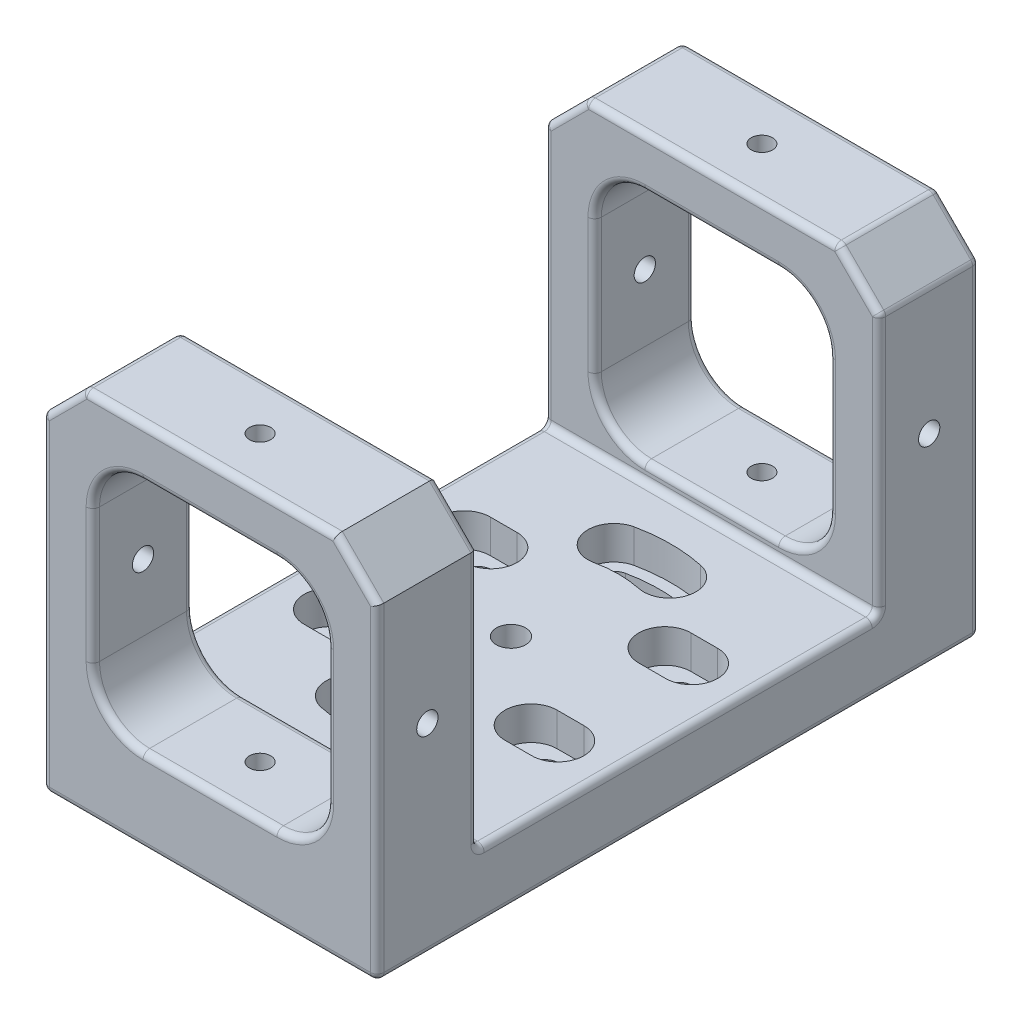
ISO-10303-21;
HEADER;
FILE_DESCRIPTION(('STEP AP214'),'2;1');
FILE_NAME('part.step','',(''),(''),'','','');
FILE_SCHEMA(('AUTOMOTIVE_DESIGN { 1 0 10303 214 1 1 1 1 }'));
ENDSEC;
DATA;
#1=APPLICATION_CONTEXT('core data for automotive mechanical design processes');
#2=APPLICATION_PROTOCOL_DEFINITION('international standard','automotive_design',2000,#1);
#3=PRODUCT_CONTEXT('',#1,'mechanical');
#4=PRODUCT('Part','Part','',(#3));
#5=PRODUCT_RELATED_PRODUCT_CATEGORY('part','',(#4));
#6=PRODUCT_DEFINITION_FORMATION('','',#4);
#7=PRODUCT_DEFINITION_CONTEXT('part definition',#1,'design');
#8=PRODUCT_DEFINITION('design','',#6,#7);
#9=PRODUCT_DEFINITION_SHAPE('','',#8);
#10=(LENGTH_UNIT() NAMED_UNIT(*) SI_UNIT(.MILLI.,.METRE.));
#11=(NAMED_UNIT(*) PLANE_ANGLE_UNIT() SI_UNIT($,.RADIAN.));
#12=(NAMED_UNIT(*) SI_UNIT($,.STERADIAN.) SOLID_ANGLE_UNIT());
#13=UNCERTAINTY_MEASURE_WITH_UNIT(LENGTH_MEASURE(1.E-05),#10,'distance_accuracy_value','');
#14=(GEOMETRIC_REPRESENTATION_CONTEXT(3) GLOBAL_UNCERTAINTY_ASSIGNED_CONTEXT((#13)) GLOBAL_UNIT_ASSIGNED_CONTEXT((#10,
#11,#12)) REPRESENTATION_CONTEXT('',''));
#15=CARTESIAN_POINT('',(0.,0.,0.));
#16=DIRECTION('',(0.,0.,1.));
#17=DIRECTION('',(1.,0.,0.));
#18=AXIS2_PLACEMENT_3D('',#15,#16,#17);
#19=CARTESIAN_POINT('',(-31.75,12.7,95.25));
#20=DIRECTION('',(0.,-1.,0.));
#21=DIRECTION('',(0.,0.,-1.));
#22=AXIS2_PLACEMENT_3D('',#19,#20,#21);
#23=PLANE('',#22);
#24=DIRECTION('',(0.,0.,-1.));
#25=VECTOR('',#24,1.);
#26=CARTESIAN_POINT('',(-30.48,12.7,95.25));
#27=LINE('',#26,#25);
#28=CARTESIAN_POINT('',(-30.48,12.7,20.32));
#29=VERTEX_POINT('',#28);
#30=CARTESIAN_POINT('',(-30.48,12.7,93.98));
#31=VERTEX_POINT('',#30);
#32=EDGE_CURVE('E1052',#29,#31,#27,.F.);
#33=ORIENTED_EDGE('',*,*,#32,.T.);
#34=DIRECTION('',(-1.,0.,0.));
#35=VECTOR('',#34,1.);
#36=CARTESIAN_POINT('',(31.75,12.7,93.98));
#37=LINE('',#36,#35);
#38=CARTESIAN_POINT('',(30.48,12.7,93.98));
#39=VERTEX_POINT('',#38);
#40=EDGE_CURVE('E1057',#31,#39,#37,.F.);
#41=ORIENTED_EDGE('',*,*,#40,.T.);
#42=DIRECTION('',(0.,0.,-1.));
#43=VECTOR('',#42,1.);
#44=CARTESIAN_POINT('',(30.48,12.7,95.25));
#45=LINE('',#44,#43);
#46=CARTESIAN_POINT('',(30.48,12.7,20.32));
#47=VERTEX_POINT('',#46);
#48=EDGE_CURVE('E1054',#39,#47,#45,.T.);
#49=ORIENTED_EDGE('',*,*,#48,.T.);
#50=DIRECTION('',(-1.,0.,0.));
#51=VECTOR('',#50,1.);
#52=CARTESIAN_POINT('',(-31.75,12.7,20.32));
#53=LINE('',#52,#51);
#54=EDGE_CURVE('E1050',#47,#29,#53,.T.);
#55=ORIENTED_EDGE('',*,*,#54,.T.);
#56=EDGE_LOOP('',(#33,#41,#49,#55));
#57=FACE_BOUND('',#56,.T.);
#58=DIRECTION('',(-1.,0.,0.));
#59=VECTOR('',#58,1.);
#60=CARTESIAN_POINT('',(21.59,12.7,64.897));
#61=LINE('',#60,#59);
#62=CARTESIAN_POINT('',(21.59,12.7,64.897));
#63=VERTEX_POINT('',#62);
#64=CARTESIAN_POINT('',(16.51,12.7,64.897));
#65=VERTEX_POINT('',#64);
#66=EDGE_CURVE('E3686',#63,#65,#61,.T.);
#67=ORIENTED_EDGE('',*,*,#66,.F.);
#68=CARTESIAN_POINT('',(21.59,12.7,69.85));
#69=DIRECTION('',(0.,1.,0.));
#70=DIRECTION('',(0.,0.,-1.));
#71=AXIS2_PLACEMENT_3D('',#68,#69,#70);
#72=CIRCLE('',#71,4.953);
#73=CARTESIAN_POINT('',(21.59,12.7,74.803));
#74=VERTEX_POINT('',#73);
#75=EDGE_CURVE('E680',#74,#63,#72,.T.);
#76=ORIENTED_EDGE('',*,*,#75,.F.);
#77=DIRECTION('',(1.,0.,0.));
#78=VECTOR('',#77,1.);
#79=CARTESIAN_POINT('',(21.59,12.7,74.803));
#80=LINE('',#79,#78);
#81=CARTESIAN_POINT('',(16.51,12.7,74.803));
#82=VERTEX_POINT('',#81);
#83=EDGE_CURVE('E690',#82,#74,#80,.T.);
#84=ORIENTED_EDGE('',*,*,#83,.F.);
#85=CARTESIAN_POINT('',(16.51,12.7,69.85));
#86=DIRECTION('',(0.,1.,0.));
#87=DIRECTION('',(0.,0.,1.));
#88=AXIS2_PLACEMENT_3D('',#85,#86,#87);
#89=CIRCLE('',#88,4.953);
#90=EDGE_CURVE('E681',#65,#82,#89,.T.);
#91=ORIENTED_EDGE('',*,*,#90,.F.);
#92=EDGE_LOOP('',(#67,#76,#84,#91));
#93=FACE_BOUND('',#92,.T.);
#94=DIRECTION('',(-1.,0.,0.));
#95=VECTOR('',#94,1.);
#96=CARTESIAN_POINT('',(21.59,12.7,39.497));
#97=LINE('',#96,#95);
#98=CARTESIAN_POINT('',(21.59,12.7,39.497));
#99=VERTEX_POINT('',#98);
#100=CARTESIAN_POINT('',(16.51,12.7,39.497));
#101=VERTEX_POINT('',#100);
#102=EDGE_CURVE('E717',#99,#101,#97,.T.);
#103=ORIENTED_EDGE('',*,*,#102,.F.);
#104=CARTESIAN_POINT('',(21.59,12.7,44.45));
#105=DIRECTION('',(0.,1.,0.));
#106=DIRECTION('',(0.,0.,-1.));
#107=AXIS2_PLACEMENT_3D('',#104,#105,#106);
#108=CIRCLE('',#107,4.953);
#109=CARTESIAN_POINT('',(21.59,12.7,49.403));
#110=VERTEX_POINT('',#109);
#111=EDGE_CURVE('E699',#110,#99,#108,.T.);
#112=ORIENTED_EDGE('',*,*,#111,.F.);
#113=DIRECTION('',(1.,0.,0.));
#114=VECTOR('',#113,1.);
#115=CARTESIAN_POINT('',(21.59,12.7,49.403));
#116=LINE('',#115,#114);
#117=CARTESIAN_POINT('',(16.51,12.7,49.403));
#118=VERTEX_POINT('',#117);
#119=EDGE_CURVE('E706',#118,#110,#116,.T.);
#120=ORIENTED_EDGE('',*,*,#119,.F.);
#121=CARTESIAN_POINT('',(16.51,12.7,44.45));
#122=DIRECTION('',(0.,1.,0.));
#123=DIRECTION('',(0.,0.,1.));
#124=AXIS2_PLACEMENT_3D('',#121,#122,#123);
#125=CIRCLE('',#124,4.953);
#126=EDGE_CURVE('E720',#101,#118,#125,.T.);
#127=ORIENTED_EDGE('',*,*,#126,.F.);
#128=EDGE_LOOP('',(#103,#112,#120,#127));
#129=FACE_BOUND('',#128,.T.);
#130=CARTESIAN_POINT('',(0.,12.7,57.15));
#131=DIRECTION('',(0.,1.,0.));
#132=DIRECTION('',(0.,0.,1.));
#133=AXIS2_PLACEMENT_3D('',#130,#131,#132);
#134=CIRCLE('',#133,2.77876);
#135=CARTESIAN_POINT('',(0.,12.7,59.92876));
#136=VERTEX_POINT('',#135);
#137=EDGE_CURVE('E892',#136,#136,#134,.T.);
#138=ORIENTED_EDGE('',*,*,#137,.F.);
#139=EDGE_LOOP('',(#138));
#140=FACE_BOUND('',#139,.T.);
#141=CARTESIAN_POINT('',(0.,12.7,57.15));
#142=DIRECTION('',(0.,1.,0.));
#143=DIRECTION('',(0.,0.,1.));
#144=AXIS2_PLACEMENT_3D('',#141,#142,#143);
#145=CIRCLE('',#144,30.353);
#146=CARTESIAN_POINT('',(-6.31074355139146,12.7,86.8397141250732));
#147=VERTEX_POINT('',#146);
#148=CARTESIAN_POINT('',(6.31074355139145,12.7,86.8397141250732));
#149=VERTEX_POINT('',#148);
#150=EDGE_CURVE('E830',#147,#149,#145,.T.);
#151=ORIENTED_EDGE('',*,*,#150,.F.);
#152=CARTESIAN_POINT('',(-5.2809569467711,12.7,81.9949490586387));
#153=DIRECTION('',(0.,1.,0.));
#154=DIRECTION('',(0.,0.,1.));
#155=AXIS2_PLACEMENT_3D('',#152,#153,#154);
#156=CIRCLE('',#155,4.953);
#157=CARTESIAN_POINT('',(-4.25117034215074,12.7,77.1501839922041));
#158=VERTEX_POINT('',#157);
#159=EDGE_CURVE('E814',#158,#147,#156,.T.);
#160=ORIENTED_EDGE('',*,*,#159,.F.);
#161=CARTESIAN_POINT('',(0.,12.7,57.15));
#162=DIRECTION('',(0.,-1.,0.));
#163=DIRECTION('',(0.,0.,1.));
#164=AXIS2_PLACEMENT_3D('',#161,#162,#163);
#165=CIRCLE('',#164,20.447);
#166=CARTESIAN_POINT('',(4.25117034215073,12.7,77.1501839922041));
#167=VERTEX_POINT('',#166);
#168=EDGE_CURVE('E819',#167,#158,#165,.T.);
#169=ORIENTED_EDGE('',*,*,#168,.F.);
#170=CARTESIAN_POINT('',(5.2809569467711,12.7,81.9949490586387));
#171=DIRECTION('',(0.,1.,0.));
#172=DIRECTION('',(0.,0.,1.));
#173=AXIS2_PLACEMENT_3D('',#170,#171,#172);
#174=CIRCLE('',#173,4.953);
#175=EDGE_CURVE('E833',#149,#167,#174,.T.);
#176=ORIENTED_EDGE('',*,*,#175,.F.);
#177=EDGE_LOOP('',(#151,#160,#169,#176));
#178=FACE_BOUND('',#177,.T.);
#179=CARTESIAN_POINT('',(-5.2809569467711,12.7,32.3050509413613));
#180=DIRECTION('',(0.,-1.,0.));
#181=DIRECTION('',(0.,0.,-1.));
#182=AXIS2_PLACEMENT_3D('',#179,#180,#181);
#183=CIRCLE('',#182,4.953);
#184=CARTESIAN_POINT('',(-4.25117034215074,12.7,37.1498160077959));
#185=VERTEX_POINT('',#184);
#186=CARTESIAN_POINT('',(-6.31074355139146,12.7,27.4602858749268));
#187=VERTEX_POINT('',#186);
#188=EDGE_CURVE('E777',#185,#187,#183,.T.);
#189=ORIENTED_EDGE('',*,*,#188,.T.);
#190=CARTESIAN_POINT('',(0.,12.7,57.15));
#191=DIRECTION('',(0.,-1.,0.));
#192=DIRECTION('',(0.,0.,-1.));
#193=AXIS2_PLACEMENT_3D('',#190,#191,#192);
#194=CIRCLE('',#193,30.353);
#195=CARTESIAN_POINT('',(6.31074355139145,12.7,27.4602858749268));
#196=VERTEX_POINT('',#195);
#197=EDGE_CURVE('E782',#187,#196,#194,.T.);
#198=ORIENTED_EDGE('',*,*,#197,.T.);
#199=CARTESIAN_POINT('',(5.2809569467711,12.7,32.3050509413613));
#200=DIRECTION('',(0.,-1.,0.));
#201=DIRECTION('',(0.,0.,-1.));
#202=AXIS2_PLACEMENT_3D('',#199,#200,#201);
#203=CIRCLE('',#202,4.953);
#204=CARTESIAN_POINT('',(4.25117034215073,12.7,37.1498160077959));
#205=VERTEX_POINT('',#204);
#206=EDGE_CURVE('E794',#196,#205,#203,.T.);
#207=ORIENTED_EDGE('',*,*,#206,.T.);
#208=CARTESIAN_POINT('',(0.,12.7,57.15));
#209=DIRECTION('',(0.,1.,0.));
#210=DIRECTION('',(0.,0.,-1.));
#211=AXIS2_PLACEMENT_3D('',#208,#209,#210);
#212=CIRCLE('',#211,20.447);
#213=EDGE_CURVE('E791',#205,#185,#212,.T.);
#214=ORIENTED_EDGE('',*,*,#213,.T.);
#215=EDGE_LOOP('',(#189,#198,#207,#214));
#216=FACE_BOUND('',#215,.T.);
#217=CARTESIAN_POINT('',(-16.51,12.7,44.45));
#218=DIRECTION('',(0.,1.,0.));
#219=DIRECTION('',(0.,0.,-1.));
#220=AXIS2_PLACEMENT_3D('',#217,#218,#219);
#221=CIRCLE('',#220,4.953);
#222=CARTESIAN_POINT('',(-16.51,12.7,49.403));
#223=VERTEX_POINT('',#222);
#224=CARTESIAN_POINT('',(-16.51,12.7,39.497));
#225=VERTEX_POINT('',#224);
#226=EDGE_CURVE('E971',#223,#225,#221,.T.);
#227=ORIENTED_EDGE('',*,*,#226,.F.);
#228=DIRECTION('',(1.,0.,0.));
#229=VECTOR('',#228,1.);
#230=CARTESIAN_POINT('',(-16.51,12.7,49.403));
#231=LINE('',#230,#229);
#232=CARTESIAN_POINT('',(-21.59,12.7,49.403));
#233=VERTEX_POINT('',#232);
#234=EDGE_CURVE('E973',#233,#223,#231,.T.);
#235=ORIENTED_EDGE('',*,*,#234,.F.);
#236=CARTESIAN_POINT('',(-21.59,12.7,44.45));
#237=DIRECTION('',(0.,1.,0.));
#238=DIRECTION('',(0.,0.,1.));
#239=AXIS2_PLACEMENT_3D('',#236,#237,#238);
#240=CIRCLE('',#239,4.953);
#241=CARTESIAN_POINT('',(-21.59,12.7,39.497));
#242=VERTEX_POINT('',#241);
#243=EDGE_CURVE('E976',#242,#233,#240,.T.);
#244=ORIENTED_EDGE('',*,*,#243,.F.);
#245=DIRECTION('',(-1.,0.,0.));
#246=VECTOR('',#245,1.);
#247=CARTESIAN_POINT('',(-16.51,12.7,39.497));
#248=LINE('',#247,#246);
#249=EDGE_CURVE('E979',#225,#242,#248,.T.);
#250=ORIENTED_EDGE('',*,*,#249,.F.);
#251=EDGE_LOOP('',(#227,#235,#244,#250));
#252=FACE_BOUND('',#251,.T.);
#253=CARTESIAN_POINT('',(-16.51,12.7,69.85));
#254=DIRECTION('',(0.,1.,0.));
#255=DIRECTION('',(0.,0.,-1.));
#256=AXIS2_PLACEMENT_3D('',#253,#254,#255);
#257=CIRCLE('',#256,4.953);
#258=CARTESIAN_POINT('',(-16.51,12.7,74.803));
#259=VERTEX_POINT('',#258);
#260=CARTESIAN_POINT('',(-16.51,12.7,64.897));
#261=VERTEX_POINT('',#260);
#262=EDGE_CURVE('E1012',#259,#261,#257,.T.);
#263=ORIENTED_EDGE('',*,*,#262,.F.);
#264=DIRECTION('',(1.,0.,0.));
#265=VECTOR('',#264,1.);
#266=CARTESIAN_POINT('',(-16.51,12.7,74.803));
#267=LINE('',#266,#265);
#268=CARTESIAN_POINT('',(-21.59,12.7,74.803));
#269=VERTEX_POINT('',#268);
#270=EDGE_CURVE('E1014',#269,#259,#267,.T.);
#271=ORIENTED_EDGE('',*,*,#270,.F.);
#272=CARTESIAN_POINT('',(-21.59,12.7,69.85));
#273=DIRECTION('',(0.,1.,0.));
#274=DIRECTION('',(0.,0.,1.));
#275=AXIS2_PLACEMENT_3D('',#272,#273,#274);
#276=CIRCLE('',#275,4.953);
#277=CARTESIAN_POINT('',(-21.59,12.7,64.897));
#278=VERTEX_POINT('',#277);
#279=EDGE_CURVE('E1017',#278,#269,#276,.T.);
#280=ORIENTED_EDGE('',*,*,#279,.F.);
#281=DIRECTION('',(-1.,0.,0.));
#282=VECTOR('',#281,1.);
#283=CARTESIAN_POINT('',(-16.51,12.7,64.897));
#284=LINE('',#283,#282);
#285=EDGE_CURVE('E1020',#261,#278,#284,.T.);
#286=ORIENTED_EDGE('',*,*,#285,.F.);
#287=EDGE_LOOP('',(#263,#271,#280,#286));
#288=FACE_BOUND('',#287,.T.);
#289=ADVANCED_FACE('F37',(#57,#93,#129,#140,#178,#216,#252,#288),#23,.F.);
#290=CARTESIAN_POINT('',(0.,0.,57.15));
#291=DIRECTION('',(0.,1.,0.));
#292=DIRECTION('',(0.,0.,1.));
#293=AXIS2_PLACEMENT_3D('',#290,#291,#292);
#294=CYLINDRICAL_SURFACE('',#293,22.606);
#295=CARTESIAN_POINT('',(0.,6.35,57.15));
#296=DIRECTION('',(0.,1.,0.));
#297=DIRECTION('',(0.,0.,1.));
#298=AXIS2_PLACEMENT_3D('',#295,#296,#297);
#299=CIRCLE('',#298,22.606);
#300=CARTESIAN_POINT('',(4.70005168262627,6.35,35.0379953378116));
#301=VERTEX_POINT('',#300);
#302=CARTESIAN_POINT('',(-4.70005168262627,6.35,35.0379953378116));
#303=VERTEX_POINT('',#302);
#304=EDGE_CURVE('E812',#301,#303,#299,.T.);
#305=ORIENTED_EDGE('',*,*,#304,.F.);
#306=DIRECTION('',(0.,1.,0.));
#307=VECTOR('',#306,1.);
#308=CARTESIAN_POINT('',(4.70005168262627,0.,35.0379953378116));
#309=LINE('',#308,#307);
#310=CARTESIAN_POINT('',(4.70005168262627,0.,35.0379953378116));
#311=VERTEX_POINT('',#310);
#312=EDGE_CURVE('E864',#311,#301,#309,.T.);
#313=ORIENTED_EDGE('',*,*,#312,.F.);
#314=CARTESIAN_POINT('',(0.,0.,57.15));
#315=DIRECTION('',(0.,-1.,0.));
#316=DIRECTION('',(0.,0.,-1.));
#317=AXIS2_PLACEMENT_3D('',#314,#315,#316);
#318=CIRCLE('',#317,22.606);
#319=CARTESIAN_POINT('',(-4.70005168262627,0.,35.0379953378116));
#320=VERTEX_POINT('',#319);
#321=EDGE_CURVE('E852',#320,#311,#318,.T.);
#322=ORIENTED_EDGE('',*,*,#321,.F.);
#323=DIRECTION('',(0.,1.,0.));
#324=VECTOR('',#323,1.);
#325=CARTESIAN_POINT('',(-4.70005168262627,0.,35.0379953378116));
#326=LINE('',#325,#324);
#327=EDGE_CURVE('E865',#320,#303,#326,.T.);
#328=ORIENTED_EDGE('',*,*,#327,.T.);
#329=EDGE_LOOP('',(#305,#313,#322,#328));
#330=FACE_BOUND('',#329,.T.);
#331=ADVANCED_FACE('F1725',(#330),#294,.T.);
#332=CARTESIAN_POINT('',(-5.2809569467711,0.,32.3050509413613));
#333=DIRECTION('',(0.,1.,0.));
#334=DIRECTION('',(0.,0.,1.));
#335=AXIS2_PLACEMENT_3D('',#332,#333,#334);
#336=CYLINDRICAL_SURFACE('',#335,2.794);
#337=CARTESIAN_POINT('',(-5.2809569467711,6.35,32.3050509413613));
#338=DIRECTION('',(0.,1.,0.));
#339=DIRECTION('',(0.,0.,1.));
#340=AXIS2_PLACEMENT_3D('',#337,#338,#339);
#341=CIRCLE('',#340,2.794);
#342=CARTESIAN_POINT('',(-5.86186221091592,6.35,29.5721065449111));
#343=VERTEX_POINT('',#342);
#344=EDGE_CURVE('E810',#303,#343,#341,.F.);
#345=ORIENTED_EDGE('',*,*,#344,.F.);
#346=ORIENTED_EDGE('',*,*,#327,.F.);
#347=CARTESIAN_POINT('',(-5.2809569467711,0.,32.3050509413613));
#348=DIRECTION('',(0.,1.,0.));
#349=DIRECTION('',(0.,0.,-1.));
#350=AXIS2_PLACEMENT_3D('',#347,#348,#349);
#351=CIRCLE('',#350,2.794);
#352=CARTESIAN_POINT('',(-5.86186221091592,0.,29.5721065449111));
#353=VERTEX_POINT('',#352);
#354=EDGE_CURVE('E861',#353,#320,#351,.T.);
#355=ORIENTED_EDGE('',*,*,#354,.F.);
#356=DIRECTION('',(0.,1.,0.));
#357=VECTOR('',#356,1.);
#358=CARTESIAN_POINT('',(-5.86186221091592,0.,29.5721065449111));
#359=LINE('',#358,#357);
#360=EDGE_CURVE('E869',#353,#343,#359,.T.);
#361=ORIENTED_EDGE('',*,*,#360,.T.);
#362=EDGE_LOOP('',(#345,#346,#355,#361));
#363=FACE_BOUND('',#362,.T.);
#364=ADVANCED_FACE('F1731',(#363),#336,.F.);
#365=CARTESIAN_POINT('',(0.,0.,57.15));
#366=DIRECTION('',(0.,1.,0.));
#367=DIRECTION('',(0.,0.,1.));
#368=AXIS2_PLACEMENT_3D('',#365,#366,#367);
#369=CYLINDRICAL_SURFACE('',#368,28.194);
#370=CARTESIAN_POINT('',(0.,6.35,57.15));
#371=DIRECTION('',(0.,1.,0.));
#372=DIRECTION('',(0.,0.,1.));
#373=AXIS2_PLACEMENT_3D('',#370,#371,#372);
#374=CIRCLE('',#373,28.194);
#375=CARTESIAN_POINT('',(5.86186221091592,6.35,29.5721065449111));
#376=VERTEX_POINT('',#375);
#377=EDGE_CURVE('E802',#343,#376,#374,.F.);
#378=ORIENTED_EDGE('',*,*,#377,.F.);
#379=ORIENTED_EDGE('',*,*,#360,.F.);
#380=CARTESIAN_POINT('',(0.,0.,57.15));
#381=DIRECTION('',(0.,1.,0.));
#382=DIRECTION('',(0.,0.,-1.));
#383=AXIS2_PLACEMENT_3D('',#380,#381,#382);
#384=CIRCLE('',#383,28.194);
#385=CARTESIAN_POINT('',(5.86186221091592,0.,29.5721065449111));
#386=VERTEX_POINT('',#385);
#387=EDGE_CURVE('E858',#386,#353,#384,.T.);
#388=ORIENTED_EDGE('',*,*,#387,.F.);
#389=DIRECTION('',(0.,1.,0.));
#390=VECTOR('',#389,1.);
#391=CARTESIAN_POINT('',(5.86186221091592,0.,29.5721065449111));
#392=LINE('',#391,#390);
#393=EDGE_CURVE('E872',#386,#376,#392,.T.);
#394=ORIENTED_EDGE('',*,*,#393,.T.);
#395=EDGE_LOOP('',(#378,#379,#388,#394));
#396=FACE_BOUND('',#395,.T.);
#397=ADVANCED_FACE('F2223',(#396),#369,.F.);
#398=CARTESIAN_POINT('',(5.2809569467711,0.,32.3050509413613));
#399=DIRECTION('',(0.,1.,0.));
#400=DIRECTION('',(0.,0.,1.));
#401=AXIS2_PLACEMENT_3D('',#398,#399,#400);
#402=CYLINDRICAL_SURFACE('',#401,2.794);
#403=CARTESIAN_POINT('',(5.2809569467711,6.35,32.3050509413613));
#404=DIRECTION('',(0.,1.,0.));
#405=DIRECTION('',(0.,0.,1.));
#406=AXIS2_PLACEMENT_3D('',#403,#404,#405);
#407=CIRCLE('',#406,2.794);
#408=EDGE_CURVE('E962',#376,#301,#407,.F.);
#409=ORIENTED_EDGE('',*,*,#408,.F.);
#410=ORIENTED_EDGE('',*,*,#393,.F.);
#411=CARTESIAN_POINT('',(5.2809569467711,0.,32.3050509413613));
#412=DIRECTION('',(0.,1.,0.));
#413=DIRECTION('',(0.,0.,1.));
#414=AXIS2_PLACEMENT_3D('',#411,#412,#413);
#415=CIRCLE('',#414,2.794);
#416=EDGE_CURVE('E855',#311,#386,#415,.T.);
#417=ORIENTED_EDGE('',*,*,#416,.F.);
#418=ORIENTED_EDGE('',*,*,#312,.T.);
#419=EDGE_LOOP('',(#409,#410,#417,#418));
#420=FACE_BOUND('',#419,.T.);
#421=ADVANCED_FACE('F2231',(#420),#402,.F.);
#422=CARTESIAN_POINT('',(5.2809569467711,0.,81.9949490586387));
#423=DIRECTION('',(0.,1.,0.));
#424=DIRECTION('',(0.,0.,1.));
#425=AXIS2_PLACEMENT_3D('',#422,#423,#424);
#426=CYLINDRICAL_SURFACE('',#425,2.794);
#427=CARTESIAN_POINT('',(5.2809569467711,6.35,81.9949490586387));
#428=DIRECTION('',(0.,1.,0.));
#429=DIRECTION('',(0.,0.,1.));
#430=AXIS2_PLACEMENT_3D('',#427,#428,#429);
#431=CIRCLE('',#430,2.794);
#432=CARTESIAN_POINT('',(4.70005168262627,6.35,79.2620046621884));
#433=VERTEX_POINT('',#432);
#434=CARTESIAN_POINT('',(5.86186221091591,6.35,84.7278934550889));
#435=VERTEX_POINT('',#434);
#436=EDGE_CURVE('E850',#433,#435,#431,.F.);
#437=ORIENTED_EDGE('',*,*,#436,.F.);
#438=DIRECTION('',(0.,1.,0.));
#439=VECTOR('',#438,1.);
#440=CARTESIAN_POINT('',(4.70005168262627,0.,79.2620046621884));
#441=LINE('',#440,#439);
#442=CARTESIAN_POINT('',(4.70005168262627,0.,79.2620046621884));
#443=VERTEX_POINT('',#442);
#444=EDGE_CURVE('E888',#443,#433,#441,.T.);
#445=ORIENTED_EDGE('',*,*,#444,.F.);
#446=CARTESIAN_POINT('',(5.2809569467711,0.,81.9949490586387));
#447=DIRECTION('',(0.,1.,0.));
#448=DIRECTION('',(0.,0.,-1.));
#449=AXIS2_PLACEMENT_3D('',#446,#447,#448);
#450=CIRCLE('',#449,2.794);
#451=CARTESIAN_POINT('',(5.86186221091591,0.,84.7278934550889));
#452=VERTEX_POINT('',#451);
#453=EDGE_CURVE('E868',#452,#443,#450,.T.);
#454=ORIENTED_EDGE('',*,*,#453,.F.);
#455=DIRECTION('',(0.,1.,0.));
#456=VECTOR('',#455,1.);
#457=CARTESIAN_POINT('',(5.86186221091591,0.,84.7278934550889));
#458=LINE('',#457,#456);
#459=EDGE_CURVE('E889',#452,#435,#458,.T.);
#460=ORIENTED_EDGE('',*,*,#459,.T.);
#461=EDGE_LOOP('',(#437,#445,#454,#460));
#462=FACE_BOUND('',#461,.T.);
#463=ADVANCED_FACE('F2239',(#462),#426,.F.);
#464=CARTESIAN_POINT('',(0.,0.,57.15));
#465=DIRECTION('',(0.,1.,0.));
#466=DIRECTION('',(0.,0.,1.));
#467=AXIS2_PLACEMENT_3D('',#464,#465,#466);
#468=CYLINDRICAL_SURFACE('',#467,28.194);
#469=CARTESIAN_POINT('',(0.,6.35,57.15));
#470=DIRECTION('',(0.,1.,0.));
#471=DIRECTION('',(0.,0.,1.));
#472=AXIS2_PLACEMENT_3D('',#469,#470,#471);
#473=CIRCLE('',#472,28.194);
#474=CARTESIAN_POINT('',(-5.86186221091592,6.35,84.7278934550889));
#475=VERTEX_POINT('',#474);
#476=EDGE_CURVE('E848',#435,#475,#473,.F.);
#477=ORIENTED_EDGE('',*,*,#476,.F.);
#478=ORIENTED_EDGE('',*,*,#459,.F.);
#479=CARTESIAN_POINT('',(0.,0.,57.15));
#480=DIRECTION('',(0.,1.,0.));
#481=DIRECTION('',(0.,0.,1.));
#482=AXIS2_PLACEMENT_3D('',#479,#480,#481);
#483=CIRCLE('',#482,28.194);
#484=CARTESIAN_POINT('',(-5.86186221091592,0.,84.7278934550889));
#485=VERTEX_POINT('',#484);
#486=EDGE_CURVE('E885',#485,#452,#483,.T.);
#487=ORIENTED_EDGE('',*,*,#486,.F.);
#488=DIRECTION('',(0.,1.,0.));
#489=VECTOR('',#488,1.);
#490=CARTESIAN_POINT('',(-5.86186221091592,0.,84.7278934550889));
#491=LINE('',#490,#489);
#492=EDGE_CURVE('E893',#485,#475,#491,.T.);
#493=ORIENTED_EDGE('',*,*,#492,.T.);
#494=EDGE_LOOP('',(#477,#478,#487,#493));
#495=FACE_BOUND('',#494,.T.);
#496=ADVANCED_FACE('F2247',(#495),#468,.F.);
#497=CARTESIAN_POINT('',(-5.2809569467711,0.,81.9949490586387));
#498=DIRECTION('',(0.,1.,0.));
#499=DIRECTION('',(0.,0.,1.));
#500=AXIS2_PLACEMENT_3D('',#497,#498,#499);
#501=CYLINDRICAL_SURFACE('',#500,2.794);
#502=CARTESIAN_POINT('',(-5.2809569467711,6.35,81.9949490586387));
#503=DIRECTION('',(0.,1.,0.));
#504=DIRECTION('',(0.,0.,1.));
#505=AXIS2_PLACEMENT_3D('',#502,#503,#504);
#506=CIRCLE('',#505,2.794);
#507=CARTESIAN_POINT('',(-4.70005168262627,6.35,79.2620046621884));
#508=VERTEX_POINT('',#507);
#509=EDGE_CURVE('E840',#475,#508,#506,.F.);
#510=ORIENTED_EDGE('',*,*,#509,.F.);
#511=ORIENTED_EDGE('',*,*,#492,.F.);
#512=CARTESIAN_POINT('',(-5.2809569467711,0.,81.9949490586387));
#513=DIRECTION('',(0.,1.,0.));
#514=DIRECTION('',(0.,0.,1.));
#515=AXIS2_PLACEMENT_3D('',#512,#513,#514);
#516=CIRCLE('',#515,2.794);
#517=CARTESIAN_POINT('',(-4.70005168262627,0.,79.2620046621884));
#518=VERTEX_POINT('',#517);
#519=EDGE_CURVE('E882',#518,#485,#516,.T.);
#520=ORIENTED_EDGE('',*,*,#519,.F.);
#521=DIRECTION('',(0.,1.,0.));
#522=VECTOR('',#521,1.);
#523=CARTESIAN_POINT('',(-4.70005168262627,0.,79.2620046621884));
#524=LINE('',#523,#522);
#525=EDGE_CURVE('E896',#518,#508,#524,.T.);
#526=ORIENTED_EDGE('',*,*,#525,.T.);
#527=EDGE_LOOP('',(#510,#511,#520,#526));
#528=FACE_BOUND('',#527,.T.);
#529=ADVANCED_FACE('F2255',(#528),#501,.F.);
#530=CARTESIAN_POINT('',(0.,0.,57.15));
#531=DIRECTION('',(0.,1.,0.));
#532=DIRECTION('',(0.,0.,1.));
#533=AXIS2_PLACEMENT_3D('',#530,#531,#532);
#534=CYLINDRICAL_SURFACE('',#533,22.606);
#535=CARTESIAN_POINT('',(0.,6.35,57.15));
#536=DIRECTION('',(0.,1.,0.));
#537=DIRECTION('',(0.,0.,1.));
#538=AXIS2_PLACEMENT_3D('',#535,#536,#537);
#539=CIRCLE('',#538,22.606);
#540=EDGE_CURVE('E960',#508,#433,#539,.T.);
#541=ORIENTED_EDGE('',*,*,#540,.F.);
#542=ORIENTED_EDGE('',*,*,#525,.F.);
#543=CARTESIAN_POINT('',(0.,0.,57.15));
#544=DIRECTION('',(0.,-1.,0.));
#545=DIRECTION('',(0.,0.,1.));
#546=AXIS2_PLACEMENT_3D('',#543,#544,#545);
#547=CIRCLE('',#546,22.606);
#548=EDGE_CURVE('E879',#443,#518,#547,.T.);
#549=ORIENTED_EDGE('',*,*,#548,.F.);
#550=ORIENTED_EDGE('',*,*,#444,.T.);
#551=EDGE_LOOP('',(#541,#542,#549,#550));
#552=FACE_BOUND('',#551,.T.);
#553=ADVANCED_FACE('F1776',(#552),#534,.T.);
#554=CARTESIAN_POINT('',(31.75,69.85,19.05));
#555=DIRECTION('',(0.,0.,1.));
#556=DIRECTION('',(1.,0.,0.));
#557=AXIS2_PLACEMENT_3D('',#554,#555,#556);
#558=PLANE('',#557);
#559=CARTESIAN_POINT('',(-12.7,25.4,19.05));
#560=DIRECTION('',(0.,0.,1.));
#561=DIRECTION('',(1.,0.,0.));
#562=AXIS2_PLACEMENT_3D('',#559,#560,#561);
#563=CIRCLE('',#562,10.795);
#564=CARTESIAN_POINT('',(-12.7,14.605,19.05));
#565=VERTEX_POINT('',#564);
#566=CARTESIAN_POINT('',(-23.495,25.4,19.05));
#567=VERTEX_POINT('',#566);
#568=EDGE_CURVE('E1235',#565,#567,#563,.F.);
#569=ORIENTED_EDGE('',*,*,#568,.T.);
#570=DIRECTION('',(0.,-1.,0.));
#571=VECTOR('',#570,1.);
#572=CARTESIAN_POINT('',(-23.495,69.85,19.05));
#573=LINE('',#572,#571);
#574=CARTESIAN_POINT('',(-23.495,50.8,19.05));
#575=VERTEX_POINT('',#574);
#576=EDGE_CURVE('E1249',#567,#575,#573,.F.);
#577=ORIENTED_EDGE('',*,*,#576,.T.);
#578=CARTESIAN_POINT('',(-12.7,50.8,19.05));
#579=DIRECTION('',(0.,0.,1.));
#580=DIRECTION('',(1.,0.,0.));
#581=AXIS2_PLACEMENT_3D('',#578,#579,#580);
#582=CIRCLE('',#581,10.795);
#583=CARTESIAN_POINT('',(-12.7,61.595,19.05));
#584=VERTEX_POINT('',#583);
#585=EDGE_CURVE('E1247',#575,#584,#582,.F.);
#586=ORIENTED_EDGE('',*,*,#585,.T.);
#587=DIRECTION('',(-1.,0.,0.));
#588=VECTOR('',#587,1.);
#589=CARTESIAN_POINT('',(31.75,61.595,19.05));
#590=LINE('',#589,#588);
#591=CARTESIAN_POINT('',(12.7,61.595,19.05));
#592=VERTEX_POINT('',#591);
#593=EDGE_CURVE('E1245',#584,#592,#590,.F.);
#594=ORIENTED_EDGE('',*,*,#593,.T.);
#595=CARTESIAN_POINT('',(12.7,50.8,19.05));
#596=DIRECTION('',(0.,0.,1.));
#597=DIRECTION('',(1.,0.,0.));
#598=AXIS2_PLACEMENT_3D('',#595,#596,#597);
#599=CIRCLE('',#598,10.795);
#600=CARTESIAN_POINT('',(23.495,50.8,19.05));
#601=VERTEX_POINT('',#600);
#602=EDGE_CURVE('E1243',#592,#601,#599,.F.);
#603=ORIENTED_EDGE('',*,*,#602,.T.);
#604=DIRECTION('',(0.,1.,0.));
#605=VECTOR('',#604,1.);
#606=CARTESIAN_POINT('',(23.495,69.85,19.05));
#607=LINE('',#606,#605);
#608=CARTESIAN_POINT('',(23.495,25.4,19.05));
#609=VERTEX_POINT('',#608);
#610=EDGE_CURVE('E1241',#601,#609,#607,.F.);
#611=ORIENTED_EDGE('',*,*,#610,.T.);
#612=CARTESIAN_POINT('',(12.7,25.4,19.05));
#613=DIRECTION('',(0.,0.,1.));
#614=DIRECTION('',(1.,0.,0.));
#615=AXIS2_PLACEMENT_3D('',#612,#613,#614);
#616=CIRCLE('',#615,10.795);
#617=CARTESIAN_POINT('',(12.7,14.605,19.05));
#618=VERTEX_POINT('',#617);
#619=EDGE_CURVE('E1239',#609,#618,#616,.F.);
#620=ORIENTED_EDGE('',*,*,#619,.T.);
#621=DIRECTION('',(1.,0.,0.));
#622=VECTOR('',#621,1.);
#623=CARTESIAN_POINT('',(31.75,14.605,19.05));
#624=LINE('',#623,#622);
#625=EDGE_CURVE('E1237',#618,#565,#624,.F.);
#626=ORIENTED_EDGE('',*,*,#625,.T.);
#627=EDGE_LOOP('',(#569,#577,#586,#594,#603,#611,#620,#626));
#628=FACE_BOUND('',#627,.T.);
#629=DIRECTION('',(0.,-1.,0.));
#630=VECTOR('',#629,1.);
#631=CARTESIAN_POINT('',(-30.48,12.7,19.05));
#632=LINE('',#631,#630);
#633=CARTESIAN_POINT('',(-30.48,61.4499487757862,19.05));
#634=VERTEX_POINT('',#633);
#635=CARTESIAN_POINT('',(-30.48,13.97,19.05));
#636=VERTEX_POINT('',#635);
#637=EDGE_CURVE('E1224',#634,#636,#632,.T.);
#638=ORIENTED_EDGE('',*,*,#637,.T.);
#639=DIRECTION('',(-1.,0.,0.));
#640=VECTOR('',#639,1.);
#641=CARTESIAN_POINT('',(31.75,13.97,19.05));
#642=LINE('',#641,#640);
#643=CARTESIAN_POINT('',(30.48,13.97,19.05));
#644=VERTEX_POINT('',#643);
#645=EDGE_CURVE('E1232',#636,#644,#642,.F.);
#646=ORIENTED_EDGE('',*,*,#645,.T.);
#647=DIRECTION('',(0.,1.,0.));
#648=VECTOR('',#647,1.);
#649=CARTESIAN_POINT('',(30.48,61.976,19.05));
#650=LINE('',#649,#648);
#651=CARTESIAN_POINT('',(30.48,61.4499487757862,19.05));
#652=VERTEX_POINT('',#651);
#653=EDGE_CURVE('E1230',#644,#652,#650,.T.);
#654=ORIENTED_EDGE('',*,*,#653,.T.);
#655=DIRECTION('',(-0.707106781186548,0.707106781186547,0.));
#656=VECTOR('',#655,1.);
#657=CARTESIAN_POINT('',(22.9779743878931,68.9519743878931,19.05));
#658=LINE('',#657,#656);
#659=CARTESIAN_POINT('',(23.3499487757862,68.58,19.05));
#660=VERTEX_POINT('',#659);
#661=EDGE_CURVE('E1228',#652,#660,#658,.T.);
#662=ORIENTED_EDGE('',*,*,#661,.T.);
#663=DIRECTION('',(-1.,0.,0.));
#664=VECTOR('',#663,1.);
#665=CARTESIAN_POINT('',(-23.876,68.58,19.05));
#666=LINE('',#665,#664);
#667=CARTESIAN_POINT('',(-23.3499487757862,68.58,19.05));
#668=VERTEX_POINT('',#667);
#669=EDGE_CURVE('E1226',#660,#668,#666,.T.);
#670=ORIENTED_EDGE('',*,*,#669,.T.);
#671=DIRECTION('',(-0.707106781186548,-0.707106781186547,0.));
#672=VECTOR('',#671,1.);
#673=CARTESIAN_POINT('',(-30.8519743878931,61.0779743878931,19.05));
#674=LINE('',#673,#672);
#675=EDGE_CURVE('E1222',#668,#634,#674,.T.);
#676=ORIENTED_EDGE('',*,*,#675,.T.);
#677=EDGE_LOOP('',(#638,#646,#654,#662,#670,#676));
#678=FACE_BOUND('',#677,.T.);
#679=ADVANCED_FACE('F1772',(#628,#678),#558,.T.);
#680=CARTESIAN_POINT('',(31.75,69.85,0.));
#681=DIRECTION('',(0.,0.,1.));
#682=DIRECTION('',(1.,0.,0.));
#683=AXIS2_PLACEMENT_3D('',#680,#681,#682);
#684=PLANE('',#683);
#685=DIRECTION('',(1.,0.,0.));
#686=VECTOR('',#685,1.);
#687=CARTESIAN_POINT('',(12.7,14.605,0.));
#688=LINE('',#687,#686);
#689=CARTESIAN_POINT('',(-12.7,14.605,0.));
#690=VERTEX_POINT('',#689);
#691=CARTESIAN_POINT('',(12.7,14.605,0.));
#692=VERTEX_POINT('',#691);
#693=EDGE_CURVE('E1127',#690,#692,#688,.T.);
#694=ORIENTED_EDGE('',*,*,#693,.T.);
#695=CARTESIAN_POINT('',(12.7,25.4,0.));
#696=DIRECTION('',(0.,0.,1.));
#697=DIRECTION('',(1.,0.,0.));
#698=AXIS2_PLACEMENT_3D('',#695,#696,#697);
#699=CIRCLE('',#698,10.795);
#700=CARTESIAN_POINT('',(23.495,25.4,0.));
#701=VERTEX_POINT('',#700);
#702=EDGE_CURVE('E1129',#692,#701,#699,.T.);
#703=ORIENTED_EDGE('',*,*,#702,.T.);
#704=DIRECTION('',(0.,1.,0.));
#705=VECTOR('',#704,1.);
#706=CARTESIAN_POINT('',(23.495,50.8,0.));
#707=LINE('',#706,#705);
#708=CARTESIAN_POINT('',(23.495,50.8,0.));
#709=VERTEX_POINT('',#708);
#710=EDGE_CURVE('E1115',#701,#709,#707,.T.);
#711=ORIENTED_EDGE('',*,*,#710,.T.);
#712=CARTESIAN_POINT('',(12.7,50.8,0.));
#713=DIRECTION('',(0.,0.,1.));
#714=DIRECTION('',(1.,0.,0.));
#715=AXIS2_PLACEMENT_3D('',#712,#713,#714);
#716=CIRCLE('',#715,10.795);
#717=CARTESIAN_POINT('',(12.7,61.595,0.));
#718=VERTEX_POINT('',#717);
#719=EDGE_CURVE('E1117',#709,#718,#716,.T.);
#720=ORIENTED_EDGE('',*,*,#719,.T.);
#721=DIRECTION('',(-1.,0.,0.));
#722=VECTOR('',#721,1.);
#723=CARTESIAN_POINT('',(-12.7,61.595,0.));
#724=LINE('',#723,#722);
#725=CARTESIAN_POINT('',(-12.7,61.595,0.));
#726=VERTEX_POINT('',#725);
#727=EDGE_CURVE('E1119',#718,#726,#724,.T.);
#728=ORIENTED_EDGE('',*,*,#727,.T.);
#729=CARTESIAN_POINT('',(-12.7,50.8,0.));
#730=DIRECTION('',(0.,0.,1.));
#731=DIRECTION('',(1.,0.,0.));
#732=AXIS2_PLACEMENT_3D('',#729,#730,#731);
#733=CIRCLE('',#732,10.795);
#734=CARTESIAN_POINT('',(-23.495,50.8,0.));
#735=VERTEX_POINT('',#734);
#736=EDGE_CURVE('E1121',#726,#735,#733,.T.);
#737=ORIENTED_EDGE('',*,*,#736,.T.);
#738=DIRECTION('',(0.,-1.,0.));
#739=VECTOR('',#738,1.);
#740=CARTESIAN_POINT('',(-23.495,25.4,0.));
#741=LINE('',#740,#739);
#742=CARTESIAN_POINT('',(-23.495,25.4,0.));
#743=VERTEX_POINT('',#742);
#744=EDGE_CURVE('E1123',#735,#743,#741,.T.);
#745=ORIENTED_EDGE('',*,*,#744,.T.);
#746=CARTESIAN_POINT('',(-12.7,25.4,0.));
#747=DIRECTION('',(0.,0.,1.));
#748=DIRECTION('',(1.,0.,0.));
#749=AXIS2_PLACEMENT_3D('',#746,#747,#748);
#750=CIRCLE('',#749,10.795);
#751=EDGE_CURVE('E1125',#743,#690,#750,.T.);
#752=ORIENTED_EDGE('',*,*,#751,.T.);
#753=EDGE_LOOP('',(#694,#703,#711,#720,#728,#737,#745,#752));
#754=FACE_BOUND('',#753,.T.);
#755=DIRECTION('',(0.,1.,0.));
#756=VECTOR('',#755,1.);
#757=CARTESIAN_POINT('',(30.48,69.85,0.));
#758=LINE('',#757,#756);
#759=CARTESIAN_POINT('',(30.48,61.4499487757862,0.));
#760=VERTEX_POINT('',#759);
#761=CARTESIAN_POINT('',(30.48,1.27,0.));
#762=VERTEX_POINT('',#761);
#763=EDGE_CURVE('E1110',#760,#762,#758,.F.);
#764=ORIENTED_EDGE('',*,*,#763,.T.);
#765=DIRECTION('',(1.,0.,0.));
#766=VECTOR('',#765,1.);
#767=CARTESIAN_POINT('',(31.75,1.26999999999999,0.));
#768=LINE('',#767,#766);
#769=CARTESIAN_POINT('',(-30.48,1.27,0.));
#770=VERTEX_POINT('',#769);
#771=EDGE_CURVE('E1112',#762,#770,#768,.F.);
#772=ORIENTED_EDGE('',*,*,#771,.T.);
#773=DIRECTION('',(0.,-1.,0.));
#774=VECTOR('',#773,1.);
#775=CARTESIAN_POINT('',(-30.48,69.85,0.));
#776=LINE('',#775,#774);
#777=CARTESIAN_POINT('',(-30.48,61.4499487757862,0.));
#778=VERTEX_POINT('',#777);
#779=EDGE_CURVE('E1102',#770,#778,#776,.F.);
#780=ORIENTED_EDGE('',*,*,#779,.T.);
#781=DIRECTION('',(-0.707106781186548,-0.707106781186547,0.));
#782=VECTOR('',#781,1.);
#783=CARTESIAN_POINT('',(4.83502561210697,96.7649743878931,0.));
#784=LINE('',#783,#782);
#785=CARTESIAN_POINT('',(-23.3499487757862,68.58,0.));
#786=VERTEX_POINT('',#785);
#787=EDGE_CURVE('E1104',#778,#786,#784,.F.);
#788=ORIENTED_EDGE('',*,*,#787,.T.);
#789=DIRECTION('',(-1.,0.,0.));
#790=VECTOR('',#789,1.);
#791=CARTESIAN_POINT('',(31.75,68.58,0.));
#792=LINE('',#791,#790);
#793=CARTESIAN_POINT('',(23.3499487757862,68.58,0.));
#794=VERTEX_POINT('',#793);
#795=EDGE_CURVE('E1106',#786,#794,#792,.F.);
#796=ORIENTED_EDGE('',*,*,#795,.T.);
#797=DIRECTION('',(-0.707106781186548,0.707106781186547,0.));
#798=VECTOR('',#797,1.);
#799=CARTESIAN_POINT('',(26.9149743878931,65.0149743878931,0.));
#800=LINE('',#799,#798);
#801=EDGE_CURVE('E1108',#794,#760,#800,.F.);
#802=ORIENTED_EDGE('',*,*,#801,.T.);
#803=EDGE_LOOP('',(#764,#772,#780,#788,#796,#802));
#804=FACE_BOUND('',#803,.T.);
#805=ADVANCED_FACE('F1775',(#754,#804),#684,.F.);
#806=CARTESIAN_POINT('',(31.75,0.,19.05));
#807=DIRECTION('',(-1.,0.,0.));
#808=DIRECTION('',(0.,0.,1.));
#809=AXIS2_PLACEMENT_3D('',#806,#807,#808);
#810=PLANE('',#809);
#811=CARTESIAN_POINT('',(31.75,38.0999999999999,9.52500000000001));
#812=DIRECTION('',(-1.,0.,0.));
#813=DIRECTION('',(0.,0.,1.));
#814=AXIS2_PLACEMENT_3D('',#811,#812,#813);
#815=CIRCLE('',#814,2.01929999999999);
#816=CARTESIAN_POINT('',(31.75,38.0999999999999,11.5443));
#817=VERTEX_POINT('',#816);
#818=EDGE_CURVE('E742',#817,#817,#815,.T.);
#819=ORIENTED_EDGE('',*,*,#818,.T.);
#820=EDGE_LOOP('',(#819));
#821=FACE_BOUND('',#820,.T.);
#822=CARTESIAN_POINT('',(31.75,38.0999999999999,104.775));
#823=DIRECTION('',(-1.,0.,0.));
#824=DIRECTION('',(0.,0.,1.));
#825=AXIS2_PLACEMENT_3D('',#822,#823,#824);
#826=CIRCLE('',#825,2.01929999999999);
#827=CARTESIAN_POINT('',(31.75,38.0999999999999,106.7943));
#828=VERTEX_POINT('',#827);
#829=EDGE_CURVE('E764',#828,#828,#826,.T.);
#830=ORIENTED_EDGE('',*,*,#829,.T.);
#831=EDGE_LOOP('',(#830));
#832=FACE_BOUND('',#831,.T.);
#833=CARTESIAN_POINT('',(31.75,13.97,93.98));
#834=DIRECTION('',(-1.,0.,0.));
#835=DIRECTION('',(0.,0.,1.));
#836=AXIS2_PLACEMENT_3D('',#833,#834,#835);
#837=CIRCLE('',#836,2.54);
#838=CARTESIAN_POINT('',(31.75,13.97,96.52));
#839=VERTEX_POINT('',#838);
#840=CARTESIAN_POINT('',(31.75,11.43,93.98));
#841=VERTEX_POINT('',#840);
#842=EDGE_CURVE('E1075',#839,#841,#837,.F.);
#843=ORIENTED_EDGE('',*,*,#842,.F.);
#844=DIRECTION('',(0.,1.,0.));
#845=VECTOR('',#844,1.);
#846=CARTESIAN_POINT('',(31.75,0.,96.52));
#847=LINE('',#846,#845);
#848=CARTESIAN_POINT('',(31.75,61.976,96.52));
#849=VERTEX_POINT('',#848);
#850=EDGE_CURVE('E1078',#839,#849,#847,.T.);
#851=ORIENTED_EDGE('',*,*,#850,.T.);
#852=DIRECTION('',(0.,0.,-1.));
#853=VECTOR('',#852,1.);
#854=CARTESIAN_POINT('',(31.75,61.976,114.3));
#855=LINE('',#854,#853);
#856=CARTESIAN_POINT('',(31.75,61.976,113.03));
#857=VERTEX_POINT('',#856);
#858=EDGE_CURVE('E933',#857,#849,#855,.T.);
#859=ORIENTED_EDGE('',*,*,#858,.F.);
#860=DIRECTION('',(0.,1.,0.));
#861=VECTOR('',#860,1.);
#862=CARTESIAN_POINT('',(31.75,0.,113.03));
#863=LINE('',#862,#861);
#864=CARTESIAN_POINT('',(31.75,1.27,113.03));
#865=VERTEX_POINT('',#864);
#866=EDGE_CURVE('E1070',#857,#865,#863,.F.);
#867=ORIENTED_EDGE('',*,*,#866,.T.);
#868=DIRECTION('',(0.,0.,-1.));
#869=VECTOR('',#868,1.);
#870=CARTESIAN_POINT('',(31.75,1.27,19.05));
#871=LINE('',#870,#869);
#872=CARTESIAN_POINT('',(31.75,1.27,1.27));
#873=VERTEX_POINT('',#872);
#874=EDGE_CURVE('E1065',#865,#873,#871,.T.);
#875=ORIENTED_EDGE('',*,*,#874,.T.);
#876=DIRECTION('',(0.,1.,0.));
#877=VECTOR('',#876,1.);
#878=CARTESIAN_POINT('',(31.75,0.,1.27));
#879=LINE('',#878,#877);
#880=CARTESIAN_POINT('',(31.75,61.4499487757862,1.27));
#881=VERTEX_POINT('',#880);
#882=EDGE_CURVE('E1059',#873,#881,#879,.T.);
#883=ORIENTED_EDGE('',*,*,#882,.T.);
#884=DIRECTION('',(0.,0.,-1.));
#885=VECTOR('',#884,1.);
#886=CARTESIAN_POINT('',(31.75,61.4499487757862,19.05));
#887=LINE('',#886,#885);
#888=CARTESIAN_POINT('',(31.75,61.4499487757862,17.78));
#889=VERTEX_POINT('',#888);
#890=EDGE_CURVE('E1061',#881,#889,#887,.F.);
#891=ORIENTED_EDGE('',*,*,#890,.T.);
#892=DIRECTION('',(0.,1.,0.));
#893=VECTOR('',#892,1.);
#894=CARTESIAN_POINT('',(31.75,12.7,17.78));
#895=LINE('',#894,#893);
#896=CARTESIAN_POINT('',(31.75,13.97,17.78));
#897=VERTEX_POINT('',#896);
#898=EDGE_CURVE('E1063',#889,#897,#895,.F.);
#899=ORIENTED_EDGE('',*,*,#898,.T.);
#900=CARTESIAN_POINT('',(31.75,13.97,20.32));
#901=DIRECTION('',(-1.,0.,0.));
#902=DIRECTION('',(0.,0.,1.));
#903=AXIS2_PLACEMENT_3D('',#900,#901,#902);
#904=CIRCLE('',#903,2.54);
#905=CARTESIAN_POINT('',(31.75,11.43,20.32));
#906=VERTEX_POINT('',#905);
#907=EDGE_CURVE('E1067',#906,#897,#904,.F.);
#908=ORIENTED_EDGE('',*,*,#907,.F.);
#909=DIRECTION('',(0.,0.,-1.));
#910=VECTOR('',#909,1.);
#911=CARTESIAN_POINT('',(31.75,11.43,19.05));
#912=LINE('',#911,#910);
#913=EDGE_CURVE('E1072',#906,#841,#912,.F.);
#914=ORIENTED_EDGE('',*,*,#913,.T.);
#915=EDGE_LOOP('',(#843,#851,#859,#867,#875,#883,#891,#899,#908,#914));
#916=FACE_BOUND('',#915,.T.);
#917=ADVANCED_FACE('F1780',(#821,#832,#916),#810,.F.);
#918=CARTESIAN_POINT('',(31.75,61.976,19.05));
#919=DIRECTION('',(-0.707106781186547,-0.707106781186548,0.));
#920=DIRECTION('',(0.707106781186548,-0.707106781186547,0.));
#921=AXIS2_PLACEMENT_3D('',#918,#919,#920);
#922=PLANE('',#921);
#923=DIRECTION('',(0.,0.,-1.));
#924=VECTOR('',#923,1.);
#925=CARTESIAN_POINT('',(24.2479743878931,69.4780256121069,19.05));
#926=LINE('',#925,#924);
#927=CARTESIAN_POINT('',(24.2479743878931,69.4780256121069,1.27));
#928=VERTEX_POINT('',#927);
#929=CARTESIAN_POINT('',(24.2479743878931,69.4780256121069,17.78));
#930=VERTEX_POINT('',#929);
#931=EDGE_CURVE('E1320',#928,#930,#926,.F.);
#932=ORIENTED_EDGE('',*,*,#931,.T.);
#933=DIRECTION('',(-0.707106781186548,0.707106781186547,0.));
#934=VECTOR('',#933,1.);
#935=CARTESIAN_POINT('',(31.75,61.976,17.78));
#936=LINE('',#935,#934);
#937=CARTESIAN_POINT('',(31.3780256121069,62.3479743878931,17.78));
#938=VERTEX_POINT('',#937);
#939=EDGE_CURVE('E1324',#930,#938,#936,.F.);
#940=ORIENTED_EDGE('',*,*,#939,.T.);
#941=DIRECTION('',(0.,0.,-1.));
#942=VECTOR('',#941,1.);
#943=CARTESIAN_POINT('',(31.3780256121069,62.3479743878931,19.05));
#944=LINE('',#943,#942);
#945=CARTESIAN_POINT('',(31.3780256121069,62.3479743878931,1.27));
#946=VERTEX_POINT('',#945);
#947=EDGE_CURVE('E1322',#938,#946,#944,.T.);
#948=ORIENTED_EDGE('',*,*,#947,.T.);
#949=DIRECTION('',(-0.707106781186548,0.707106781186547,0.));
#950=VECTOR('',#949,1.);
#951=CARTESIAN_POINT('',(31.75,61.976,1.27));
#952=LINE('',#951,#950);
#953=EDGE_CURVE('E1318',#946,#928,#952,.T.);
#954=ORIENTED_EDGE('',*,*,#953,.T.);
#955=EDGE_LOOP('',(#932,#940,#948,#954));
#956=FACE_BOUND('',#955,.T.);
#957=ADVANCED_FACE('F1795',(#956),#922,.F.);
#958=CARTESIAN_POINT('',(23.876,69.85,19.05));
#959=DIRECTION('',(0.,-1.,0.));
#960=DIRECTION('',(0.,0.,-1.));
#961=AXIS2_PLACEMENT_3D('',#958,#959,#960);
#962=PLANE('',#961);
#963=DIRECTION('',(0.,0.,-1.));
#964=VECTOR('',#963,1.);
#965=CARTESIAN_POINT('',(-23.3499487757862,69.85,19.05));
#966=LINE('',#965,#964);
#967=CARTESIAN_POINT('',(-23.3499487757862,69.85,1.27));
#968=VERTEX_POINT('',#967);
#969=CARTESIAN_POINT('',(-23.3499487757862,69.85,17.78));
#970=VERTEX_POINT('',#969);
#971=EDGE_CURVE('E1331',#968,#970,#966,.F.);
#972=ORIENTED_EDGE('',*,*,#971,.T.);
#973=DIRECTION('',(-1.,0.,0.));
#974=VECTOR('',#973,1.);
#975=CARTESIAN_POINT('',(23.876,69.85,17.78));
#976=LINE('',#975,#974);
#977=CARTESIAN_POINT('',(23.3499487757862,69.85,17.78));
#978=VERTEX_POINT('',#977);
#979=EDGE_CURVE('E1333',#970,#978,#976,.F.);
#980=ORIENTED_EDGE('',*,*,#979,.T.);
#981=DIRECTION('',(0.,0.,-1.));
#982=VECTOR('',#981,1.);
#983=CARTESIAN_POINT('',(23.3499487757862,69.85,19.05));
#984=LINE('',#983,#982);
#985=CARTESIAN_POINT('',(23.3499487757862,69.85,1.27));
#986=VERTEX_POINT('',#985);
#987=EDGE_CURVE('E1329',#978,#986,#984,.T.);
#988=ORIENTED_EDGE('',*,*,#987,.T.);
#989=DIRECTION('',(-1.,0.,0.));
#990=VECTOR('',#989,1.);
#991=CARTESIAN_POINT('',(23.876,69.85,1.27));
#992=LINE('',#991,#990);
#993=EDGE_CURVE('E1327',#986,#968,#992,.T.);
#994=ORIENTED_EDGE('',*,*,#993,.T.);
#995=EDGE_LOOP('',(#972,#980,#988,#994));
#996=FACE_BOUND('',#995,.T.);
#997=CARTESIAN_POINT('',(0.,69.85,9.52500000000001));
#998=DIRECTION('',(0.,1.,0.));
#999=DIRECTION('',(0.,0.,1.));
#1000=AXIS2_PLACEMENT_3D('',#997,#998,#999);
#1001=CIRCLE('',#1000,2.01929999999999);
#1002=CARTESIAN_POINT('',(0.,69.85,11.5443));
#1003=VERTEX_POINT('',#1002);
#1004=EDGE_CURVE('E745',#1003,#1003,#1001,.T.);
#1005=ORIENTED_EDGE('',*,*,#1004,.F.);
#1006=EDGE_LOOP('',(#1005));
#1007=FACE_BOUND('',#1006,.T.);
#1008=ADVANCED_FACE('F1792',(#996,#1007),#962,.F.);
#1009=CARTESIAN_POINT('',(-31.75,61.976,19.05));
#1010=DIRECTION('',(0.707106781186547,-0.707106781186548,0.));
#1011=DIRECTION('',(0.707106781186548,0.707106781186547,0.));
#1012=AXIS2_PLACEMENT_3D('',#1009,#1010,#1011);
#1013=PLANE('',#1012);
#1014=DIRECTION('',(0.,0.,-1.));
#1015=VECTOR('',#1014,1.);
#1016=CARTESIAN_POINT('',(-31.3780256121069,62.3479743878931,19.05));
#1017=LINE('',#1016,#1015);
#1018=CARTESIAN_POINT('',(-31.3780256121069,62.3479743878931,1.27));
#1019=VERTEX_POINT('',#1018);
#1020=CARTESIAN_POINT('',(-31.3780256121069,62.3479743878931,17.78));
#1021=VERTEX_POINT('',#1020);
#1022=EDGE_CURVE('E46',#1019,#1021,#1017,.F.);
#1023=ORIENTED_EDGE('',*,*,#1022,.T.);
#1024=DIRECTION('',(-0.707106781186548,-0.707106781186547,0.));
#1025=VECTOR('',#1024,1.);
#1026=CARTESIAN_POINT('',(-23.876,69.85,17.78));
#1027=LINE('',#1026,#1025);
#1028=CARTESIAN_POINT('',(-24.2479743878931,69.4780256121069,17.78));
#1029=VERTEX_POINT('',#1028);
#1030=EDGE_CURVE('E11',#1021,#1029,#1027,.F.);
#1031=ORIENTED_EDGE('',*,*,#1030,.T.);
#1032=DIRECTION('',(0.,0.,-1.));
#1033=VECTOR('',#1032,1.);
#1034=CARTESIAN_POINT('',(-24.2479743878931,69.4780256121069,19.05));
#1035=LINE('',#1034,#1033);
#1036=CARTESIAN_POINT('',(-24.2479743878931,69.4780256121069,1.27));
#1037=VERTEX_POINT('',#1036);
#1038=EDGE_CURVE('E1338',#1029,#1037,#1035,.T.);
#1039=ORIENTED_EDGE('',*,*,#1038,.T.);
#1040=DIRECTION('',(-0.707106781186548,-0.707106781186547,0.));
#1041=VECTOR('',#1040,1.);
#1042=CARTESIAN_POINT('',(-31.75,61.976,1.27));
#1043=LINE('',#1042,#1041);
#1044=EDGE_CURVE('E1336',#1037,#1019,#1043,.T.);
#1045=ORIENTED_EDGE('',*,*,#1044,.T.);
#1046=EDGE_LOOP('',(#1023,#1031,#1039,#1045));
#1047=FACE_BOUND('',#1046,.T.);
#1048=ADVANCED_FACE('F1788',(#1047),#1013,.F.);
#1049=CARTESIAN_POINT('',(-31.75,0.,19.05));
#1050=DIRECTION('',(1.,0.,0.));
#1051=DIRECTION('',(0.,0.,-1.));
#1052=AXIS2_PLACEMENT_3D('',#1049,#1050,#1051);
#1053=PLANE('',#1052);
#1054=DIRECTION('',(0.,0.,-1.));
#1055=VECTOR('',#1054,1.);
#1056=CARTESIAN_POINT('',(-31.75,61.4499487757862,19.05));
#1057=LINE('',#1056,#1055);
#1058=CARTESIAN_POINT('',(-31.75,61.4499487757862,113.03));
#1059=VERTEX_POINT('',#1058);
#1060=CARTESIAN_POINT('',(-31.75,61.4499487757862,96.52));
#1061=VERTEX_POINT('',#1060);
#1062=EDGE_CURVE('E1095',#1059,#1061,#1057,.T.);
#1063=ORIENTED_EDGE('',*,*,#1062,.T.);
#1064=DIRECTION('',(0.,-1.,0.));
#1065=VECTOR('',#1064,1.);
#1066=CARTESIAN_POINT('',(-31.75,0.,96.52));
#1067=LINE('',#1066,#1065);
#1068=CARTESIAN_POINT('',(-31.75,13.97,96.52));
#1069=VERTEX_POINT('',#1068);
#1070=EDGE_CURVE('E1100',#1061,#1069,#1067,.T.);
#1071=ORIENTED_EDGE('',*,*,#1070,.T.);
#1072=CARTESIAN_POINT('',(-31.75,13.97,93.98));
#1073=DIRECTION('',(1.,0.,0.));
#1074=DIRECTION('',(0.,0.,-1.));
#1075=AXIS2_PLACEMENT_3D('',#1072,#1073,#1074);
#1076=CIRCLE('',#1075,2.54);
#1077=CARTESIAN_POINT('',(-31.75,11.43,93.98));
#1078=VERTEX_POINT('',#1077);
#1079=EDGE_CURVE('E1097',#1078,#1069,#1076,.F.);
#1080=ORIENTED_EDGE('',*,*,#1079,.F.);
#1081=DIRECTION('',(0.,0.,-1.));
#1082=VECTOR('',#1081,1.);
#1083=CARTESIAN_POINT('',(-31.75,11.43,19.05));
#1084=LINE('',#1083,#1082);
#1085=CARTESIAN_POINT('',(-31.75,11.43,20.32));
#1086=VERTEX_POINT('',#1085);
#1087=EDGE_CURVE('E1090',#1078,#1086,#1084,.T.);
#1088=ORIENTED_EDGE('',*,*,#1087,.T.);
#1089=CARTESIAN_POINT('',(-31.75,13.97,20.32));
#1090=DIRECTION('',(1.,0.,0.));
#1091=DIRECTION('',(0.,0.,-1.));
#1092=AXIS2_PLACEMENT_3D('',#1089,#1090,#1091);
#1093=CIRCLE('',#1092,2.54);
#1094=CARTESIAN_POINT('',(-31.75,13.97,17.78));
#1095=VERTEX_POINT('',#1094);
#1096=EDGE_CURVE('E1088',#1095,#1086,#1093,.F.);
#1097=ORIENTED_EDGE('',*,*,#1096,.F.);
#1098=DIRECTION('',(0.,-1.,0.));
#1099=VECTOR('',#1098,1.);
#1100=CARTESIAN_POINT('',(-31.75,61.976,17.78));
#1101=LINE('',#1100,#1099);
#1102=CARTESIAN_POINT('',(-31.75,61.4499487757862,17.78));
#1103=VERTEX_POINT('',#1102);
#1104=EDGE_CURVE('E1084',#1095,#1103,#1101,.F.);
#1105=ORIENTED_EDGE('',*,*,#1104,.T.);
#1106=DIRECTION('',(0.,0.,-1.));
#1107=VECTOR('',#1106,1.);
#1108=CARTESIAN_POINT('',(-31.75,61.4499487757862,19.05));
#1109=LINE('',#1108,#1107);
#1110=CARTESIAN_POINT('',(-31.75,61.4499487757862,1.27));
#1111=VERTEX_POINT('',#1110);
#1112=EDGE_CURVE('E1082',#1103,#1111,#1109,.T.);
#1113=ORIENTED_EDGE('',*,*,#1112,.T.);
#1114=DIRECTION('',(0.,-1.,0.));
#1115=VECTOR('',#1114,1.);
#1116=CARTESIAN_POINT('',(-31.75,0.,1.27));
#1117=LINE('',#1116,#1115);
#1118=CARTESIAN_POINT('',(-31.75,1.27,1.27));
#1119=VERTEX_POINT('',#1118);
#1120=EDGE_CURVE('E1080',#1111,#1119,#1117,.T.);
#1121=ORIENTED_EDGE('',*,*,#1120,.T.);
#1122=DIRECTION('',(0.,0.,-1.));
#1123=VECTOR('',#1122,1.);
#1124=CARTESIAN_POINT('',(-31.75,1.27,19.05));
#1125=LINE('',#1124,#1123);
#1126=CARTESIAN_POINT('',(-31.75,1.27,113.03));
#1127=VERTEX_POINT('',#1126);
#1128=EDGE_CURVE('E1086',#1119,#1127,#1125,.F.);
#1129=ORIENTED_EDGE('',*,*,#1128,.T.);
#1130=DIRECTION('',(0.,-1.,0.));
#1131=VECTOR('',#1130,1.);
#1132=CARTESIAN_POINT('',(-31.75,61.976,113.03));
#1133=LINE('',#1132,#1131);
#1134=EDGE_CURVE('E1093',#1127,#1059,#1133,.F.);
#1135=ORIENTED_EDGE('',*,*,#1134,.T.);
#1136=EDGE_LOOP('',(#1063,#1071,#1080,#1088,#1097,#1105,#1113,#1121,#1129,#1135));
#1137=FACE_BOUND('',#1136,.T.);
#1138=CARTESIAN_POINT('',(-31.75,38.0999999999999,9.52500000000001));
#1139=DIRECTION('',(-1.,0.,0.));
#1140=DIRECTION('',(0.,0.,1.));
#1141=AXIS2_PLACEMENT_3D('',#1138,#1139,#1140);
#1142=CIRCLE('',#1141,2.01929999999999);
#1143=CARTESIAN_POINT('',(-31.75,38.0999999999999,11.5443));
#1144=VERTEX_POINT('',#1143);
#1145=EDGE_CURVE('E727',#1144,#1144,#1142,.T.);
#1146=ORIENTED_EDGE('',*,*,#1145,.F.);
#1147=EDGE_LOOP('',(#1146));
#1148=FACE_BOUND('',#1147,.T.);
#1149=CARTESIAN_POINT('',(-31.75,38.0999999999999,104.775));
#1150=DIRECTION('',(-1.,0.,0.));
#1151=DIRECTION('',(0.,0.,1.));
#1152=AXIS2_PLACEMENT_3D('',#1149,#1150,#1151);
#1153=CIRCLE('',#1152,2.01929999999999);
#1154=CARTESIAN_POINT('',(-31.75,38.0999999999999,106.7943));
#1155=VERTEX_POINT('',#1154);
#1156=EDGE_CURVE('E755',#1155,#1155,#1153,.T.);
#1157=ORIENTED_EDGE('',*,*,#1156,.F.);
#1158=EDGE_LOOP('',(#1157));
#1159=FACE_BOUND('',#1158,.T.);
#1160=ADVANCED_FACE('F1784',(#1137,#1148,#1159),#1053,.F.);
#1161=CARTESIAN_POINT('',(-31.75,0.,19.05));
#1162=DIRECTION('',(0.,1.,0.));
#1163=DIRECTION('',(0.,0.,1.));
#1164=AXIS2_PLACEMENT_3D('',#1161,#1162,#1163);
#1165=PLANE('',#1164);
#1166=DIRECTION('',(1.,0.,0.));
#1167=VECTOR('',#1166,1.);
#1168=CARTESIAN_POINT('',(-31.75,0.,1.27));
#1169=LINE('',#1168,#1167);
#1170=CARTESIAN_POINT('',(-30.48,0.,1.27));
#1171=VERTEX_POINT('',#1170);
#1172=CARTESIAN_POINT('',(30.48,0.,1.27));
#1173=VERTEX_POINT('',#1172);
#1174=EDGE_CURVE('E1313',#1171,#1173,#1169,.T.);
#1175=ORIENTED_EDGE('',*,*,#1174,.T.);
#1176=DIRECTION('',(0.,0.,-1.));
#1177=VECTOR('',#1176,1.);
#1178=CARTESIAN_POINT('',(30.48,0.,19.05));
#1179=LINE('',#1178,#1177);
#1180=CARTESIAN_POINT('',(30.48,0.,113.03));
#1181=VERTEX_POINT('',#1180);
#1182=EDGE_CURVE('E1316',#1173,#1181,#1179,.F.);
#1183=ORIENTED_EDGE('',*,*,#1182,.T.);
#1184=DIRECTION('',(1.,0.,0.));
#1185=VECTOR('',#1184,1.);
#1186=CARTESIAN_POINT('',(-31.75,0.,113.03));
#1187=LINE('',#1186,#1185);
#1188=CARTESIAN_POINT('',(-30.48,0.,113.03));
#1189=VERTEX_POINT('',#1188);
#1190=EDGE_CURVE('E1311',#1181,#1189,#1187,.F.);
#1191=ORIENTED_EDGE('',*,*,#1190,.T.);
#1192=DIRECTION('',(0.,0.,-1.));
#1193=VECTOR('',#1192,1.);
#1194=CARTESIAN_POINT('',(-30.48,0.,19.05));
#1195=LINE('',#1194,#1193);
#1196=EDGE_CURVE('E1309',#1189,#1171,#1195,.T.);
#1197=ORIENTED_EDGE('',*,*,#1196,.T.);
#1198=EDGE_LOOP('',(#1175,#1183,#1191,#1197));
#1199=FACE_BOUND('',#1198,.T.);
#1200=CARTESIAN_POINT('',(19.05,0.,69.85));
#1201=DIRECTION('',(0.,1.,0.));
#1202=DIRECTION('',(0.,0.,1.));
#1203=AXIS2_PLACEMENT_3D('',#1200,#1201,#1202);
#1204=CIRCLE('',#1203,2.794);
#1205=CARTESIAN_POINT('',(19.05,0.,72.644));
#1206=VERTEX_POINT('',#1205);
#1207=EDGE_CURVE('E1523',#1206,#1206,#1204,.T.);
#1208=ORIENTED_EDGE('',*,*,#1207,.T.);
#1209=EDGE_LOOP('',(#1208));
#1210=FACE_BOUND('',#1209,.T.);
#1211=CARTESIAN_POINT('',(19.05,0.,44.45));
#1212=DIRECTION('',(0.,1.,0.));
#1213=DIRECTION('',(0.,0.,1.));
#1214=AXIS2_PLACEMENT_3D('',#1211,#1212,#1213);
#1215=CIRCLE('',#1214,2.794);
#1216=CARTESIAN_POINT('',(19.05,0.,47.244));
#1217=VERTEX_POINT('',#1216);
#1218=EDGE_CURVE('E696',#1217,#1217,#1215,.T.);
#1219=ORIENTED_EDGE('',*,*,#1218,.T.);
#1220=EDGE_LOOP('',(#1219));
#1221=FACE_BOUND('',#1220,.T.);
#1222=CARTESIAN_POINT('',(0.,0.,9.52500000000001));
#1223=DIRECTION('',(0.,1.,0.));
#1224=DIRECTION('',(0.,0.,1.));
#1225=AXIS2_PLACEMENT_3D('',#1222,#1223,#1224);
#1226=CIRCLE('',#1225,2.01929999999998);
#1227=CARTESIAN_POINT('',(0.,0.,11.5443));
#1228=VERTEX_POINT('',#1227);
#1229=EDGE_CURVE('E748',#1228,#1228,#1226,.T.);
#1230=ORIENTED_EDGE('',*,*,#1229,.T.);
#1231=EDGE_LOOP('',(#1230));
#1232=FACE_BOUND('',#1231,.T.);
#1233=CARTESIAN_POINT('',(0.,0.,104.775));
#1234=DIRECTION('',(0.,1.,0.));
#1235=DIRECTION('',(0.,0.,1.));
#1236=AXIS2_PLACEMENT_3D('',#1233,#1234,#1235);
#1237=CIRCLE('',#1236,2.01929999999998);
#1238=CARTESIAN_POINT('',(0.,0.,106.7943));
#1239=VERTEX_POINT('',#1238);
#1240=EDGE_CURVE('E770',#1239,#1239,#1237,.T.);
#1241=ORIENTED_EDGE('',*,*,#1240,.T.);
#1242=EDGE_LOOP('',(#1241));
#1243=FACE_BOUND('',#1242,.T.);
#1244=ORIENTED_EDGE('',*,*,#354,.T.);
#1245=ORIENTED_EDGE('',*,*,#321,.T.);
#1246=ORIENTED_EDGE('',*,*,#416,.T.);
#1247=ORIENTED_EDGE('',*,*,#387,.T.);
#1248=EDGE_LOOP('',(#1244,#1245,#1246,#1247));
#1249=FACE_BOUND('',#1248,.T.);
#1250=ORIENTED_EDGE('',*,*,#486,.T.);
#1251=ORIENTED_EDGE('',*,*,#453,.T.);
#1252=ORIENTED_EDGE('',*,*,#548,.T.);
#1253=ORIENTED_EDGE('',*,*,#519,.T.);
#1254=EDGE_LOOP('',(#1250,#1251,#1252,#1253));
#1255=FACE_BOUND('',#1254,.T.);
#1256=CARTESIAN_POINT('',(0.,0.,57.15));
#1257=DIRECTION('',(0.,1.,0.));
#1258=DIRECTION('',(0.,0.,1.));
#1259=AXIS2_PLACEMENT_3D('',#1256,#1257,#1258);
#1260=CIRCLE('',#1259,2.77876);
#1261=CARTESIAN_POINT('',(0.,0.,59.92876));
#1262=VERTEX_POINT('',#1261);
#1263=EDGE_CURVE('E901',#1262,#1262,#1260,.T.);
#1264=ORIENTED_EDGE('',*,*,#1263,.T.);
#1265=EDGE_LOOP('',(#1264));
#1266=FACE_BOUND('',#1265,.T.);
#1267=CARTESIAN_POINT('',(-19.05,0.,44.45));
#1268=DIRECTION('',(0.,1.,0.));
#1269=DIRECTION('',(0.,0.,1.));
#1270=AXIS2_PLACEMENT_3D('',#1267,#1268,#1269);
#1271=CIRCLE('',#1270,2.794);
#1272=CARTESIAN_POINT('',(-19.05,0.,47.244));
#1273=VERTEX_POINT('',#1272);
#1274=EDGE_CURVE('E964',#1273,#1273,#1271,.T.);
#1275=ORIENTED_EDGE('',*,*,#1274,.T.);
#1276=EDGE_LOOP('',(#1275));
#1277=FACE_BOUND('',#1276,.T.);
#1278=CARTESIAN_POINT('',(-19.05,0.,69.85));
#1279=DIRECTION('',(0.,1.,0.));
#1280=DIRECTION('',(0.,0.,1.));
#1281=AXIS2_PLACEMENT_3D('',#1278,#1279,#1280);
#1282=CIRCLE('',#1281,2.794);
#1283=CARTESIAN_POINT('',(-19.05,0.,72.644));
#1284=VERTEX_POINT('',#1283);
#1285=EDGE_CURVE('E1009',#1284,#1284,#1282,.T.);
#1286=ORIENTED_EDGE('',*,*,#1285,.T.);
#1287=EDGE_LOOP('',(#1286));
#1288=FACE_BOUND('',#1287,.T.);
#1289=ADVANCED_FACE('F1770',(#1199,#1210,#1221,#1232,#1243,#1249,#1255,#1266,#1277,#1288),#1165,.F.);
#1290=CARTESIAN_POINT('',(12.7,50.8,19.05));
#1291=DIRECTION('',(0.,0.,-1.));
#1292=DIRECTION('',(-1.,0.,0.));
#1293=AXIS2_PLACEMENT_3D('',#1290,#1291,#1292);
#1294=CYLINDRICAL_SURFACE('',#1293,9.525);
#1295=DIRECTION('',(0.,0.,-1.));
#1296=VECTOR('',#1295,1.);
#1297=CARTESIAN_POINT('',(12.7,60.325,19.05));
#1298=LINE('',#1297,#1296);
#1299=CARTESIAN_POINT('',(12.7,60.325,17.78));
#1300=VERTEX_POINT('',#1299);
#1301=CARTESIAN_POINT('',(12.7,60.325,1.27000000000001));
#1302=VERTEX_POINT('',#1301);
#1303=EDGE_CURVE('E957',#1300,#1302,#1298,.T.);
#1304=ORIENTED_EDGE('',*,*,#1303,.T.);
#1305=CARTESIAN_POINT('',(12.7,50.8,1.27));
#1306=DIRECTION('',(0.,0.,1.));
#1307=DIRECTION('',(1.,0.,0.));
#1308=AXIS2_PLACEMENT_3D('',#1305,#1306,#1307);
#1309=CIRCLE('',#1308,9.525);
#1310=CARTESIAN_POINT('',(22.225,50.8,1.27000000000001));
#1311=VERTEX_POINT('',#1310);
#1312=EDGE_CURVE('E1160',#1302,#1311,#1309,.F.);
#1313=ORIENTED_EDGE('',*,*,#1312,.T.);
#1314=DIRECTION('',(0.,0.,-1.));
#1315=VECTOR('',#1314,1.);
#1316=CARTESIAN_POINT('',(22.225,50.8,19.05));
#1317=LINE('',#1316,#1315);
#1318=CARTESIAN_POINT('',(22.225,50.8,17.78));
#1319=VERTEX_POINT('',#1318);
#1320=EDGE_CURVE('E936',#1319,#1311,#1317,.T.);
#1321=ORIENTED_EDGE('',*,*,#1320,.F.);
#1322=CARTESIAN_POINT('',(12.7,50.8,17.78));
#1323=DIRECTION('',(0.,0.,1.));
#1324=DIRECTION('',(1.,0.,0.));
#1325=AXIS2_PLACEMENT_3D('',#1322,#1323,#1324);
#1326=CIRCLE('',#1325,9.525);
#1327=EDGE_CURVE('E1158',#1319,#1300,#1326,.T.);
#1328=ORIENTED_EDGE('',*,*,#1327,.T.);
#1329=EDGE_LOOP('',(#1304,#1313,#1321,#1328));
#1330=FACE_BOUND('',#1329,.T.);
#1331=ADVANCED_FACE('F1766',(#1330),#1294,.F.);
#1332=CARTESIAN_POINT('',(-12.7,60.325,19.05));
#1333=DIRECTION('',(0.,-1.,0.));
#1334=DIRECTION('',(0.,0.,-1.));
#1335=AXIS2_PLACEMENT_3D('',#1332,#1333,#1334);
#1336=PLANE('',#1335);
#1337=CARTESIAN_POINT('',(0.,60.325,9.52500000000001));
#1338=DIRECTION('',(0.,-1.,0.));
#1339=DIRECTION('',(0.,0.,-1.));
#1340=AXIS2_PLACEMENT_3D('',#1337,#1338,#1339);
#1341=CIRCLE('',#1340,2.01929999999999);
#1342=CARTESIAN_POINT('',(0.,60.325,7.50570000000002));
#1343=VERTEX_POINT('',#1342);
#1344=EDGE_CURVE('E752',#1343,#1343,#1341,.T.);
#1345=ORIENTED_EDGE('',*,*,#1344,.F.);
#1346=EDGE_LOOP('',(#1345));
#1347=FACE_BOUND('',#1346,.T.);
#1348=DIRECTION('',(0.,0.,-1.));
#1349=VECTOR('',#1348,1.);
#1350=CARTESIAN_POINT('',(-12.7,60.325,19.05));
#1351=LINE('',#1350,#1349);
#1352=CARTESIAN_POINT('',(-12.7,60.325,17.78));
#1353=VERTEX_POINT('',#1352);
#1354=CARTESIAN_POINT('',(-12.7,60.325,1.27000000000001));
#1355=VERTEX_POINT('',#1354);
#1356=EDGE_CURVE('E954',#1353,#1355,#1351,.T.);
#1357=ORIENTED_EDGE('',*,*,#1356,.T.);
#1358=DIRECTION('',(-1.,0.,0.));
#1359=VECTOR('',#1358,1.);
#1360=CARTESIAN_POINT('',(12.7,60.325,1.27));
#1361=LINE('',#1360,#1359);
#1362=EDGE_CURVE('E1156',#1355,#1302,#1361,.F.);
#1363=ORIENTED_EDGE('',*,*,#1362,.T.);
#1364=ORIENTED_EDGE('',*,*,#1303,.F.);
#1365=DIRECTION('',(-1.,0.,0.));
#1366=VECTOR('',#1365,1.);
#1367=CARTESIAN_POINT('',(-12.7,60.325,17.78));
#1368=LINE('',#1367,#1366);
#1369=EDGE_CURVE('E1154',#1300,#1353,#1368,.T.);
#1370=ORIENTED_EDGE('',*,*,#1369,.T.);
#1371=EDGE_LOOP('',(#1357,#1363,#1364,#1370));
#1372=FACE_BOUND('',#1371,.T.);
#1373=ADVANCED_FACE('F1762',(#1347,#1372),#1336,.T.);
#1374=CARTESIAN_POINT('',(-12.7,50.8,19.05));
#1375=DIRECTION('',(0.,0.,-1.));
#1376=DIRECTION('',(-1.,0.,0.));
#1377=AXIS2_PLACEMENT_3D('',#1374,#1375,#1376);
#1378=CYLINDRICAL_SURFACE('',#1377,9.525);
#1379=DIRECTION('',(0.,0.,-1.));
#1380=VECTOR('',#1379,1.);
#1381=CARTESIAN_POINT('',(-22.225,50.8,19.05));
#1382=LINE('',#1381,#1380);
#1383=CARTESIAN_POINT('',(-22.225,50.8,17.78));
#1384=VERTEX_POINT('',#1383);
#1385=CARTESIAN_POINT('',(-22.225,50.8,1.27000000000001));
#1386=VERTEX_POINT('',#1385);
#1387=EDGE_CURVE('E951',#1384,#1386,#1382,.T.);
#1388=ORIENTED_EDGE('',*,*,#1387,.T.);
#1389=CARTESIAN_POINT('',(-12.7,50.8,1.27));
#1390=DIRECTION('',(0.,0.,1.));
#1391=DIRECTION('',(1.,0.,0.));
#1392=AXIS2_PLACEMENT_3D('',#1389,#1390,#1391);
#1393=CIRCLE('',#1392,9.525);
#1394=EDGE_CURVE('E1152',#1386,#1355,#1393,.F.);
#1395=ORIENTED_EDGE('',*,*,#1394,.T.);
#1396=ORIENTED_EDGE('',*,*,#1356,.F.);
#1397=CARTESIAN_POINT('',(-12.7,50.8,17.78));
#1398=DIRECTION('',(0.,0.,1.));
#1399=DIRECTION('',(1.,0.,0.));
#1400=AXIS2_PLACEMENT_3D('',#1397,#1398,#1399);
#1401=CIRCLE('',#1400,9.525);
#1402=EDGE_CURVE('E1150',#1353,#1384,#1401,.T.);
#1403=ORIENTED_EDGE('',*,*,#1402,.T.);
#1404=EDGE_LOOP('',(#1388,#1395,#1396,#1403));
#1405=FACE_BOUND('',#1404,.T.);
#1406=ADVANCED_FACE('F1758',(#1405),#1378,.F.);
#1407=CARTESIAN_POINT('',(-22.225,50.8,19.05));
#1408=DIRECTION('',(1.,0.,0.));
#1409=DIRECTION('',(0.,0.,-1.));
#1410=AXIS2_PLACEMENT_3D('',#1407,#1408,#1409);
#1411=PLANE('',#1410);
#1412=CARTESIAN_POINT('',(-22.225,38.0999999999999,9.52500000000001));
#1413=DIRECTION('',(1.,0.,0.));
#1414=DIRECTION('',(0.,0.,-1.));
#1415=AXIS2_PLACEMENT_3D('',#1412,#1413,#1414);
#1416=CIRCLE('',#1415,2.01929999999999);
#1417=CARTESIAN_POINT('',(-22.225,38.0999999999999,7.50570000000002));
#1418=VERTEX_POINT('',#1417);
#1419=EDGE_CURVE('E739',#1418,#1418,#1416,.T.);
#1420=ORIENTED_EDGE('',*,*,#1419,.F.);
#1421=EDGE_LOOP('',(#1420));
#1422=FACE_BOUND('',#1421,.T.);
#1423=DIRECTION('',(0.,0.,-1.));
#1424=VECTOR('',#1423,1.);
#1425=CARTESIAN_POINT('',(-22.225,25.4,19.05));
#1426=LINE('',#1425,#1424);
#1427=CARTESIAN_POINT('',(-22.225,25.4,17.78));
#1428=VERTEX_POINT('',#1427);
#1429=CARTESIAN_POINT('',(-22.225,25.4,1.27000000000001));
#1430=VERTEX_POINT('',#1429);
#1431=EDGE_CURVE('E948',#1428,#1430,#1426,.T.);
#1432=ORIENTED_EDGE('',*,*,#1431,.T.);
#1433=DIRECTION('',(0.,-1.,0.));
#1434=VECTOR('',#1433,1.);
#1435=CARTESIAN_POINT('',(-22.225,50.8,1.27));
#1436=LINE('',#1435,#1434);
#1437=EDGE_CURVE('E1148',#1430,#1386,#1436,.F.);
#1438=ORIENTED_EDGE('',*,*,#1437,.T.);
#1439=ORIENTED_EDGE('',*,*,#1387,.F.);
#1440=DIRECTION('',(0.,-1.,0.));
#1441=VECTOR('',#1440,1.);
#1442=CARTESIAN_POINT('',(-22.225,50.8,17.78));
#1443=LINE('',#1442,#1441);
#1444=EDGE_CURVE('E1145',#1384,#1428,#1443,.T.);
#1445=ORIENTED_EDGE('',*,*,#1444,.T.);
#1446=EDGE_LOOP('',(#1432,#1438,#1439,#1445));
#1447=FACE_BOUND('',#1446,.T.);
#1448=ADVANCED_FACE('F1754',(#1422,#1447),#1411,.T.);
#1449=CARTESIAN_POINT('',(-12.7,25.4,19.05));
#1450=DIRECTION('',(0.,0.,-1.));
#1451=DIRECTION('',(-1.,0.,0.));
#1452=AXIS2_PLACEMENT_3D('',#1449,#1450,#1451);
#1453=CYLINDRICAL_SURFACE('',#1452,9.525);
#1454=DIRECTION('',(0.,0.,-1.));
#1455=VECTOR('',#1454,1.);
#1456=CARTESIAN_POINT('',(-12.7,15.875,19.05));
#1457=LINE('',#1456,#1455);
#1458=CARTESIAN_POINT('',(-12.7,15.875,17.78));
#1459=VERTEX_POINT('',#1458);
#1460=CARTESIAN_POINT('',(-12.7,15.875,1.27000000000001));
#1461=VERTEX_POINT('',#1460);
#1462=EDGE_CURVE('E945',#1459,#1461,#1457,.T.);
#1463=ORIENTED_EDGE('',*,*,#1462,.T.);
#1464=CARTESIAN_POINT('',(-12.7,25.4,1.27));
#1465=DIRECTION('',(0.,0.,1.));
#1466=DIRECTION('',(1.,0.,0.));
#1467=AXIS2_PLACEMENT_3D('',#1464,#1465,#1466);
#1468=CIRCLE('',#1467,9.525);
#1469=EDGE_CURVE('E1143',#1461,#1430,#1468,.F.);
#1470=ORIENTED_EDGE('',*,*,#1469,.T.);
#1471=ORIENTED_EDGE('',*,*,#1431,.F.);
#1472=CARTESIAN_POINT('',(-12.7,25.4,17.78));
#1473=DIRECTION('',(0.,0.,1.));
#1474=DIRECTION('',(1.,0.,0.));
#1475=AXIS2_PLACEMENT_3D('',#1472,#1473,#1474);
#1476=CIRCLE('',#1475,9.525);
#1477=EDGE_CURVE('E1141',#1428,#1459,#1476,.T.);
#1478=ORIENTED_EDGE('',*,*,#1477,.T.);
#1479=EDGE_LOOP('',(#1463,#1470,#1471,#1478));
#1480=FACE_BOUND('',#1479,.T.);
#1481=ADVANCED_FACE('F1750',(#1480),#1453,.F.);
#1482=CARTESIAN_POINT('',(12.7,15.875,19.05));
#1483=DIRECTION('',(0.,1.,0.));
#1484=DIRECTION('',(0.,0.,1.));
#1485=AXIS2_PLACEMENT_3D('',#1482,#1483,#1484);
#1486=PLANE('',#1485);
#1487=CARTESIAN_POINT('',(0.,15.875,9.52500000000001));
#1488=DIRECTION('',(0.,1.,0.));
#1489=DIRECTION('',(0.,0.,1.));
#1490=AXIS2_PLACEMENT_3D('',#1487,#1488,#1489);
#1491=CIRCLE('',#1490,2.01929999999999);
#1492=CARTESIAN_POINT('',(0.,15.875,11.5443));
#1493=VERTEX_POINT('',#1492);
#1494=EDGE_CURVE('E751',#1493,#1493,#1491,.T.);
#1495=ORIENTED_EDGE('',*,*,#1494,.F.);
#1496=EDGE_LOOP('',(#1495));
#1497=FACE_BOUND('',#1496,.T.);
#1498=DIRECTION('',(0.,0.,-1.));
#1499=VECTOR('',#1498,1.);
#1500=CARTESIAN_POINT('',(12.7,15.875,19.05));
#1501=LINE('',#1500,#1499);
#1502=CARTESIAN_POINT('',(12.7,15.875,17.78));
#1503=VERTEX_POINT('',#1502);
#1504=CARTESIAN_POINT('',(12.7,15.875,1.27000000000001));
#1505=VERTEX_POINT('',#1504);
#1506=EDGE_CURVE('E942',#1503,#1505,#1501,.T.);
#1507=ORIENTED_EDGE('',*,*,#1506,.T.);
#1508=DIRECTION('',(1.,0.,0.));
#1509=VECTOR('',#1508,1.);
#1510=CARTESIAN_POINT('',(-12.7,15.875,1.27));
#1511=LINE('',#1510,#1509);
#1512=EDGE_CURVE('E1139',#1505,#1461,#1511,.F.);
#1513=ORIENTED_EDGE('',*,*,#1512,.T.);
#1514=ORIENTED_EDGE('',*,*,#1462,.F.);
#1515=DIRECTION('',(1.,0.,0.));
#1516=VECTOR('',#1515,1.);
#1517=CARTESIAN_POINT('',(12.7,15.875,17.78));
#1518=LINE('',#1517,#1516);
#1519=EDGE_CURVE('E1137',#1459,#1503,#1518,.T.);
#1520=ORIENTED_EDGE('',*,*,#1519,.T.);
#1521=EDGE_LOOP('',(#1507,#1513,#1514,#1520));
#1522=FACE_BOUND('',#1521,.T.);
#1523=ADVANCED_FACE('F1746',(#1497,#1522),#1486,.T.);
#1524=CARTESIAN_POINT('',(12.7,25.4,19.05));
#1525=DIRECTION('',(0.,0.,-1.));
#1526=DIRECTION('',(-1.,0.,0.));
#1527=AXIS2_PLACEMENT_3D('',#1524,#1525,#1526);
#1528=CYLINDRICAL_SURFACE('',#1527,9.525);
#1529=DIRECTION('',(0.,0.,-1.));
#1530=VECTOR('',#1529,1.);
#1531=CARTESIAN_POINT('',(22.225,25.4,19.05));
#1532=LINE('',#1531,#1530);
#1533=CARTESIAN_POINT('',(22.225,25.4,17.78));
#1534=VERTEX_POINT('',#1533);
#1535=CARTESIAN_POINT('',(22.225,25.4,1.27000000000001));
#1536=VERTEX_POINT('',#1535);
#1537=EDGE_CURVE('E939',#1534,#1536,#1532,.T.);
#1538=ORIENTED_EDGE('',*,*,#1537,.T.);
#1539=CARTESIAN_POINT('',(12.7,25.4,1.27));
#1540=DIRECTION('',(0.,0.,1.));
#1541=DIRECTION('',(1.,0.,0.));
#1542=AXIS2_PLACEMENT_3D('',#1539,#1540,#1541);
#1543=CIRCLE('',#1542,9.525);
#1544=EDGE_CURVE('E1134',#1536,#1505,#1543,.F.);
#1545=ORIENTED_EDGE('',*,*,#1544,.T.);
#1546=ORIENTED_EDGE('',*,*,#1506,.F.);
#1547=CARTESIAN_POINT('',(12.7,25.4,17.78));
#1548=DIRECTION('',(0.,0.,1.));
#1549=DIRECTION('',(1.,0.,0.));
#1550=AXIS2_PLACEMENT_3D('',#1547,#1548,#1549);
#1551=CIRCLE('',#1550,9.525);
#1552=EDGE_CURVE('E1132',#1503,#1534,#1551,.T.);
#1553=ORIENTED_EDGE('',*,*,#1552,.T.);
#1554=EDGE_LOOP('',(#1538,#1545,#1546,#1553));
#1555=FACE_BOUND('',#1554,.T.);
#1556=ADVANCED_FACE('F1742',(#1555),#1528,.F.);
#1557=CARTESIAN_POINT('',(22.225,50.8,19.05));
#1558=DIRECTION('',(-1.,0.,0.));
#1559=DIRECTION('',(0.,0.,1.));
#1560=AXIS2_PLACEMENT_3D('',#1557,#1558,#1559);
#1561=PLANE('',#1560);
#1562=CARTESIAN_POINT('',(22.225,38.0999999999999,9.52500000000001));
#1563=DIRECTION('',(-1.,0.,0.));
#1564=DIRECTION('',(0.,0.,1.));
#1565=AXIS2_PLACEMENT_3D('',#1562,#1563,#1564);
#1566=CIRCLE('',#1565,2.01929999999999);
#1567=CARTESIAN_POINT('',(22.225,38.0999999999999,11.5443));
#1568=VERTEX_POINT('',#1567);
#1569=EDGE_CURVE('E736',#1568,#1568,#1566,.T.);
#1570=ORIENTED_EDGE('',*,*,#1569,.F.);
#1571=EDGE_LOOP('',(#1570));
#1572=FACE_BOUND('',#1571,.T.);
#1573=ORIENTED_EDGE('',*,*,#1537,.F.);
#1574=DIRECTION('',(0.,1.,0.));
#1575=VECTOR('',#1574,1.);
#1576=CARTESIAN_POINT('',(22.225,50.8,17.78));
#1577=LINE('',#1576,#1575);
#1578=EDGE_CURVE('E1254',#1534,#1319,#1577,.T.);
#1579=ORIENTED_EDGE('',*,*,#1578,.T.);
#1580=ORIENTED_EDGE('',*,*,#1320,.T.);
#1581=DIRECTION('',(0.,1.,0.));
#1582=VECTOR('',#1581,1.);
#1583=CARTESIAN_POINT('',(22.225,25.4,1.27));
#1584=LINE('',#1583,#1582);
#1585=EDGE_CURVE('E1252',#1311,#1536,#1584,.F.);
#1586=ORIENTED_EDGE('',*,*,#1585,.T.);
#1587=EDGE_LOOP('',(#1573,#1579,#1580,#1586));
#1588=FACE_BOUND('',#1587,.T.);
#1589=ADVANCED_FACE('F1739',(#1572,#1588),#1561,.T.);
#1590=CARTESIAN_POINT('',(31.75,69.85,95.25));
#1591=DIRECTION('',(0.,0.,1.));
#1592=DIRECTION('',(1.,0.,0.));
#1593=AXIS2_PLACEMENT_3D('',#1590,#1591,#1592);
#1594=PLANE('',#1593);
#1595=CARTESIAN_POINT('',(12.7,25.4,95.25));
#1596=DIRECTION('',(0.,0.,1.));
#1597=DIRECTION('',(1.,0.,0.));
#1598=AXIS2_PLACEMENT_3D('',#1595,#1596,#1597);
#1599=CIRCLE('',#1598,10.795);
#1600=CARTESIAN_POINT('',(12.7,14.605,95.25));
#1601=VERTEX_POINT('',#1600);
#1602=CARTESIAN_POINT('',(23.495,25.4,95.25));
#1603=VERTEX_POINT('',#1602);
#1604=EDGE_CURVE('E1281',#1601,#1603,#1599,.T.);
#1605=ORIENTED_EDGE('',*,*,#1604,.T.);
#1606=DIRECTION('',(0.,1.,0.));
#1607=VECTOR('',#1606,1.);
#1608=CARTESIAN_POINT('',(23.495,50.8,95.25));
#1609=LINE('',#1608,#1607);
#1610=CARTESIAN_POINT('',(23.495,50.8,95.25));
#1611=VERTEX_POINT('',#1610);
#1612=EDGE_CURVE('E1283',#1603,#1611,#1609,.T.);
#1613=ORIENTED_EDGE('',*,*,#1612,.T.);
#1614=CARTESIAN_POINT('',(12.7,50.8,95.25));
#1615=DIRECTION('',(0.,0.,1.));
#1616=DIRECTION('',(1.,0.,0.));
#1617=AXIS2_PLACEMENT_3D('',#1614,#1615,#1616);
#1618=CIRCLE('',#1617,10.795);
#1619=CARTESIAN_POINT('',(12.7,61.595,95.25));
#1620=VERTEX_POINT('',#1619);
#1621=EDGE_CURVE('E1269',#1611,#1620,#1618,.T.);
#1622=ORIENTED_EDGE('',*,*,#1621,.T.);
#1623=DIRECTION('',(-1.,0.,0.));
#1624=VECTOR('',#1623,1.);
#1625=CARTESIAN_POINT('',(-12.7,61.595,95.25));
#1626=LINE('',#1625,#1624);
#1627=CARTESIAN_POINT('',(-12.7,61.595,95.25));
#1628=VERTEX_POINT('',#1627);
#1629=EDGE_CURVE('E1271',#1620,#1628,#1626,.T.);
#1630=ORIENTED_EDGE('',*,*,#1629,.T.);
#1631=CARTESIAN_POINT('',(-12.7,50.8,95.25));
#1632=DIRECTION('',(0.,0.,1.));
#1633=DIRECTION('',(1.,0.,0.));
#1634=AXIS2_PLACEMENT_3D('',#1631,#1632,#1633);
#1635=CIRCLE('',#1634,10.795);
#1636=CARTESIAN_POINT('',(-23.495,50.8,95.25));
#1637=VERTEX_POINT('',#1636);
#1638=EDGE_CURVE('E1273',#1628,#1637,#1635,.T.);
#1639=ORIENTED_EDGE('',*,*,#1638,.T.);
#1640=DIRECTION('',(0.,-1.,0.));
#1641=VECTOR('',#1640,1.);
#1642=CARTESIAN_POINT('',(-23.495,25.4,95.25));
#1643=LINE('',#1642,#1641);
#1644=CARTESIAN_POINT('',(-23.495,25.4,95.25));
#1645=VERTEX_POINT('',#1644);
#1646=EDGE_CURVE('E1275',#1637,#1645,#1643,.T.);
#1647=ORIENTED_EDGE('',*,*,#1646,.T.);
#1648=CARTESIAN_POINT('',(-12.7,25.4,95.25));
#1649=DIRECTION('',(0.,0.,1.));
#1650=DIRECTION('',(1.,0.,0.));
#1651=AXIS2_PLACEMENT_3D('',#1648,#1649,#1650);
#1652=CIRCLE('',#1651,10.795);
#1653=CARTESIAN_POINT('',(-12.7,14.605,95.25));
#1654=VERTEX_POINT('',#1653);
#1655=EDGE_CURVE('E1277',#1645,#1654,#1652,.T.);
#1656=ORIENTED_EDGE('',*,*,#1655,.T.);
#1657=DIRECTION('',(1.,0.,0.));
#1658=VECTOR('',#1657,1.);
#1659=CARTESIAN_POINT('',(12.7,14.605,95.25));
#1660=LINE('',#1659,#1658);
#1661=EDGE_CURVE('E1279',#1654,#1601,#1660,.T.);
#1662=ORIENTED_EDGE('',*,*,#1661,.T.);
#1663=EDGE_LOOP('',(#1605,#1613,#1622,#1630,#1639,#1647,#1656,#1662));
#1664=FACE_BOUND('',#1663,.T.);
#1665=DIRECTION('',(-1.,0.,0.));
#1666=VECTOR('',#1665,1.);
#1667=CARTESIAN_POINT('',(31.75,68.58,95.25));
#1668=LINE('',#1667,#1666);
#1669=CARTESIAN_POINT('',(-23.3499487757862,68.58,95.25));
#1670=VERTEX_POINT('',#1669);
#1671=CARTESIAN_POINT('',(23.3499487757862,68.58,95.25));
#1672=VERTEX_POINT('',#1671);
#1673=EDGE_CURVE('E1264',#1670,#1672,#1668,.F.);
#1674=ORIENTED_EDGE('',*,*,#1673,.T.);
#1675=DIRECTION('',(-0.707106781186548,0.707106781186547,0.));
#1676=VECTOR('',#1675,1.);
#1677=CARTESIAN_POINT('',(26.9149743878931,65.0149743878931,95.25));
#1678=LINE('',#1677,#1676);
#1679=CARTESIAN_POINT('',(30.48,61.4499487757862,95.25));
#1680=VERTEX_POINT('',#1679);
#1681=EDGE_CURVE('E1266',#1672,#1680,#1678,.F.);
#1682=ORIENTED_EDGE('',*,*,#1681,.T.);
#1683=DIRECTION('',(0.,1.,0.));
#1684=VECTOR('',#1683,1.);
#1685=CARTESIAN_POINT('',(30.48,69.85,95.25));
#1686=LINE('',#1685,#1684);
#1687=CARTESIAN_POINT('',(30.48,13.97,95.25));
#1688=VERTEX_POINT('',#1687);
#1689=EDGE_CURVE('E1256',#1680,#1688,#1686,.F.);
#1690=ORIENTED_EDGE('',*,*,#1689,.T.);
#1691=DIRECTION('',(-1.,0.,0.));
#1692=VECTOR('',#1691,1.);
#1693=CARTESIAN_POINT('',(-31.75,13.97,95.25));
#1694=LINE('',#1693,#1692);
#1695=CARTESIAN_POINT('',(-30.48,13.97,95.25));
#1696=VERTEX_POINT('',#1695);
#1697=EDGE_CURVE('E1258',#1688,#1696,#1694,.T.);
#1698=ORIENTED_EDGE('',*,*,#1697,.T.);
#1699=DIRECTION('',(0.,-1.,0.));
#1700=VECTOR('',#1699,1.);
#1701=CARTESIAN_POINT('',(-30.48,69.85,95.25));
#1702=LINE('',#1701,#1700);
#1703=CARTESIAN_POINT('',(-30.48,61.4499487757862,95.25));
#1704=VERTEX_POINT('',#1703);
#1705=EDGE_CURVE('E1260',#1696,#1704,#1702,.F.);
#1706=ORIENTED_EDGE('',*,*,#1705,.T.);
#1707=DIRECTION('',(-0.707106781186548,-0.707106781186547,0.));
#1708=VECTOR('',#1707,1.);
#1709=CARTESIAN_POINT('',(4.83502561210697,96.7649743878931,95.25));
#1710=LINE('',#1709,#1708);
#1711=EDGE_CURVE('E1262',#1704,#1670,#1710,.F.);
#1712=ORIENTED_EDGE('',*,*,#1711,.T.);
#1713=EDGE_LOOP('',(#1674,#1682,#1690,#1698,#1706,#1712));
#1714=FACE_BOUND('',#1713,.T.);
#1715=ADVANCED_FACE('F1696',(#1664,#1714),#1594,.F.);
#1716=CARTESIAN_POINT('',(31.75,69.85,114.3));
#1717=DIRECTION('',(0.,0.,1.));
#1718=DIRECTION('',(1.,0.,0.));
#1719=AXIS2_PLACEMENT_3D('',#1716,#1717,#1718);
#1720=PLANE('',#1719);
#1721=DIRECTION('',(0.,-1.,0.));
#1722=VECTOR('',#1721,1.);
#1723=CARTESIAN_POINT('',(-23.495,69.85,114.3));
#1724=LINE('',#1723,#1722);
#1725=CARTESIAN_POINT('',(-23.495,25.4,114.3));
#1726=VERTEX_POINT('',#1725);
#1727=CARTESIAN_POINT('',(-23.495,50.8,114.3));
#1728=VERTEX_POINT('',#1727);
#1729=EDGE_CURVE('E1180',#1726,#1728,#1724,.F.);
#1730=ORIENTED_EDGE('',*,*,#1729,.T.);
#1731=CARTESIAN_POINT('',(-12.7,50.8,114.3));
#1732=DIRECTION('',(0.,0.,1.));
#1733=DIRECTION('',(1.,0.,0.));
#1734=AXIS2_PLACEMENT_3D('',#1731,#1732,#1733);
#1735=CIRCLE('',#1734,10.795);
#1736=CARTESIAN_POINT('',(-12.7,61.595,114.3));
#1737=VERTEX_POINT('',#1736);
#1738=EDGE_CURVE('E1194',#1728,#1737,#1735,.F.);
#1739=ORIENTED_EDGE('',*,*,#1738,.T.);
#1740=DIRECTION('',(-1.,0.,0.));
#1741=VECTOR('',#1740,1.);
#1742=CARTESIAN_POINT('',(31.75,61.595,114.3));
#1743=LINE('',#1742,#1741);
#1744=CARTESIAN_POINT('',(12.7,61.595,114.3));
#1745=VERTEX_POINT('',#1744);
#1746=EDGE_CURVE('E1192',#1737,#1745,#1743,.F.);
#1747=ORIENTED_EDGE('',*,*,#1746,.T.);
#1748=CARTESIAN_POINT('',(12.7,50.8,114.3));
#1749=DIRECTION('',(0.,0.,1.));
#1750=DIRECTION('',(1.,0.,0.));
#1751=AXIS2_PLACEMENT_3D('',#1748,#1749,#1750);
#1752=CIRCLE('',#1751,10.795);
#1753=CARTESIAN_POINT('',(23.495,50.8,114.3));
#1754=VERTEX_POINT('',#1753);
#1755=EDGE_CURVE('E1190',#1745,#1754,#1752,.F.);
#1756=ORIENTED_EDGE('',*,*,#1755,.T.);
#1757=DIRECTION('',(0.,1.,0.));
#1758=VECTOR('',#1757,1.);
#1759=CARTESIAN_POINT('',(23.495,69.85,114.3));
#1760=LINE('',#1759,#1758);
#1761=CARTESIAN_POINT('',(23.495,25.4,114.3));
#1762=VERTEX_POINT('',#1761);
#1763=EDGE_CURVE('E1188',#1754,#1762,#1760,.F.);
#1764=ORIENTED_EDGE('',*,*,#1763,.T.);
#1765=CARTESIAN_POINT('',(12.7,25.4,114.3));
#1766=DIRECTION('',(0.,0.,1.));
#1767=DIRECTION('',(1.,0.,0.));
#1768=AXIS2_PLACEMENT_3D('',#1765,#1766,#1767);
#1769=CIRCLE('',#1768,10.795);
#1770=CARTESIAN_POINT('',(12.7,14.605,114.3));
#1771=VERTEX_POINT('',#1770);
#1772=EDGE_CURVE('E1186',#1762,#1771,#1769,.F.);
#1773=ORIENTED_EDGE('',*,*,#1772,.T.);
#1774=DIRECTION('',(1.,0.,0.));
#1775=VECTOR('',#1774,1.);
#1776=CARTESIAN_POINT('',(31.75,14.605,114.3));
#1777=LINE('',#1776,#1775);
#1778=CARTESIAN_POINT('',(-12.7,14.605,114.3));
#1779=VERTEX_POINT('',#1778);
#1780=EDGE_CURVE('E1184',#1771,#1779,#1777,.F.);
#1781=ORIENTED_EDGE('',*,*,#1780,.T.);
#1782=CARTESIAN_POINT('',(-12.7,25.4,114.3));
#1783=DIRECTION('',(0.,0.,1.));
#1784=DIRECTION('',(1.,0.,0.));
#1785=AXIS2_PLACEMENT_3D('',#1782,#1783,#1784);
#1786=CIRCLE('',#1785,10.795);
#1787=EDGE_CURVE('E1182',#1779,#1726,#1786,.F.);
#1788=ORIENTED_EDGE('',*,*,#1787,.T.);
#1789=EDGE_LOOP('',(#1730,#1739,#1747,#1756,#1764,#1773,#1781,#1788));
#1790=FACE_BOUND('',#1789,.T.);
#1791=DIRECTION('',(0.,-1.,0.));
#1792=VECTOR('',#1791,1.);
#1793=CARTESIAN_POINT('',(-30.48,0.,114.3));
#1794=LINE('',#1793,#1792);
#1795=CARTESIAN_POINT('',(-30.48,61.4499487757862,114.3));
#1796=VERTEX_POINT('',#1795);
#1797=CARTESIAN_POINT('',(-30.48,1.26999999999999,114.3));
#1798=VERTEX_POINT('',#1797);
#1799=EDGE_CURVE('E1167',#1796,#1798,#1794,.T.);
#1800=ORIENTED_EDGE('',*,*,#1799,.T.);
#1801=DIRECTION('',(1.,0.,0.));
#1802=VECTOR('',#1801,1.);
#1803=CARTESIAN_POINT('',(31.75,1.26999999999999,114.3));
#1804=LINE('',#1803,#1802);
#1805=CARTESIAN_POINT('',(30.48,1.26999999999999,114.3));
#1806=VERTEX_POINT('',#1805);
#1807=EDGE_CURVE('E1177',#1798,#1806,#1804,.T.);
#1808=ORIENTED_EDGE('',*,*,#1807,.T.);
#1809=DIRECTION('',(0.,1.,0.));
#1810=VECTOR('',#1809,1.);
#1811=CARTESIAN_POINT('',(30.48,61.976,114.3));
#1812=LINE('',#1811,#1810);
#1813=CARTESIAN_POINT('',(30.48,61.4499487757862,114.3));
#1814=VERTEX_POINT('',#1813);
#1815=EDGE_CURVE('E1175',#1806,#1814,#1812,.T.);
#1816=ORIENTED_EDGE('',*,*,#1815,.T.);
#1817=DIRECTION('',(-0.707106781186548,0.707106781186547,0.));
#1818=VECTOR('',#1817,1.);
#1819=CARTESIAN_POINT('',(22.9779743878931,68.9519743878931,114.3));
#1820=LINE('',#1819,#1818);
#1821=CARTESIAN_POINT('',(23.3499487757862,68.58,114.3));
#1822=VERTEX_POINT('',#1821);
#1823=EDGE_CURVE('E1173',#1814,#1822,#1820,.T.);
#1824=ORIENTED_EDGE('',*,*,#1823,.T.);
#1825=DIRECTION('',(-1.,0.,0.));
#1826=VECTOR('',#1825,1.);
#1827=CARTESIAN_POINT('',(-23.876,68.58,114.3));
#1828=LINE('',#1827,#1826);
#1829=CARTESIAN_POINT('',(-23.3499487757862,68.58,114.3));
#1830=VERTEX_POINT('',#1829);
#1831=EDGE_CURVE('E1171',#1822,#1830,#1828,.T.);
#1832=ORIENTED_EDGE('',*,*,#1831,.T.);
#1833=DIRECTION('',(-0.707106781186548,-0.707106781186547,0.));
#1834=VECTOR('',#1833,1.);
#1835=CARTESIAN_POINT('',(-30.8519743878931,61.0779743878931,114.3));
#1836=LINE('',#1835,#1834);
#1837=EDGE_CURVE('E1169',#1830,#1796,#1836,.T.);
#1838=ORIENTED_EDGE('',*,*,#1837,.T.);
#1839=EDGE_LOOP('',(#1800,#1808,#1816,#1824,#1832,#1838));
#1840=FACE_BOUND('',#1839,.T.);
#1841=ADVANCED_FACE('F1712',(#1790,#1840),#1720,.T.);
#1842=CARTESIAN_POINT('',(31.75,61.976,114.3));
#1843=DIRECTION('',(-0.707106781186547,-0.707106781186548,0.));
#1844=DIRECTION('',(0.707106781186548,-0.707106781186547,0.));
#1845=AXIS2_PLACEMENT_3D('',#1842,#1843,#1844);
#1846=PLANE('',#1845);
#1847=ORIENTED_EDGE('',*,*,#858,.T.);
#1848=DIRECTION('',(-0.707106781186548,0.707106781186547,0.));
#1849=VECTOR('',#1848,1.);
#1850=CARTESIAN_POINT('',(31.75,61.976,96.52));
#1851=LINE('',#1850,#1849);
#1852=CARTESIAN_POINT('',(23.876,69.85,96.52));
#1853=VERTEX_POINT('',#1852);
#1854=EDGE_CURVE('E1292',#849,#1853,#1851,.T.);
#1855=ORIENTED_EDGE('',*,*,#1854,.T.);
#1856=DIRECTION('',(0.,0.,-1.));
#1857=VECTOR('',#1856,1.);
#1858=CARTESIAN_POINT('',(23.876,69.85,114.3));
#1859=LINE('',#1858,#1857);
#1860=CARTESIAN_POINT('',(23.876,69.85,113.03));
#1861=VERTEX_POINT('',#1860);
#1862=EDGE_CURVE('E930',#1861,#1853,#1859,.T.);
#1863=ORIENTED_EDGE('',*,*,#1862,.F.);
#1864=DIRECTION('',(-0.707106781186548,0.707106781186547,0.));
#1865=VECTOR('',#1864,1.);
#1866=CARTESIAN_POINT('',(31.75,61.976,113.03));
#1867=LINE('',#1866,#1865);
#1868=EDGE_CURVE('E1290',#1861,#857,#1867,.F.);
#1869=ORIENTED_EDGE('',*,*,#1868,.T.);
#1870=EDGE_LOOP('',(#1847,#1855,#1863,#1869));
#1871=FACE_BOUND('',#1870,.T.);
#1872=ADVANCED_FACE('F1737',(#1871),#1846,.F.);
#1873=CARTESIAN_POINT('',(23.876,69.85,114.3));
#1874=DIRECTION('',(0.,-1.,0.));
#1875=DIRECTION('',(0.,0.,-1.));
#1876=AXIS2_PLACEMENT_3D('',#1873,#1874,#1875);
#1877=PLANE('',#1876);
#1878=ORIENTED_EDGE('',*,*,#1862,.T.);
#1879=DIRECTION('',(-1.,0.,0.));
#1880=VECTOR('',#1879,1.);
#1881=CARTESIAN_POINT('',(23.876,69.85,96.52));
#1882=LINE('',#1881,#1880);
#1883=CARTESIAN_POINT('',(-23.3499487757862,69.85,96.52));
#1884=VERTEX_POINT('',#1883);
#1885=EDGE_CURVE('E1298',#1853,#1884,#1882,.T.);
#1886=ORIENTED_EDGE('',*,*,#1885,.T.);
#1887=DIRECTION('',(0.,0.,-1.));
#1888=VECTOR('',#1887,1.);
#1889=CARTESIAN_POINT('',(-23.3499487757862,69.85,114.3));
#1890=LINE('',#1889,#1888);
#1891=CARTESIAN_POINT('',(-23.3499487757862,69.85,113.03));
#1892=VERTEX_POINT('',#1891);
#1893=EDGE_CURVE('E1294',#1884,#1892,#1890,.F.);
#1894=ORIENTED_EDGE('',*,*,#1893,.T.);
#1895=DIRECTION('',(-1.,0.,0.));
#1896=VECTOR('',#1895,1.);
#1897=CARTESIAN_POINT('',(23.876,69.85,113.03));
#1898=LINE('',#1897,#1896);
#1899=EDGE_CURVE('E1296',#1892,#1861,#1898,.F.);
#1900=ORIENTED_EDGE('',*,*,#1899,.T.);
#1901=EDGE_LOOP('',(#1878,#1886,#1894,#1900));
#1902=FACE_BOUND('',#1901,.T.);
#1903=CARTESIAN_POINT('',(0.,69.85,104.775));
#1904=DIRECTION('',(0.,1.,0.));
#1905=DIRECTION('',(0.,0.,1.));
#1906=AXIS2_PLACEMENT_3D('',#1903,#1904,#1905);
#1907=CIRCLE('',#1906,2.01929999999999);
#1908=CARTESIAN_POINT('',(0.,69.85,106.7943));
#1909=VERTEX_POINT('',#1908);
#1910=EDGE_CURVE('E767',#1909,#1909,#1907,.T.);
#1911=ORIENTED_EDGE('',*,*,#1910,.F.);
#1912=EDGE_LOOP('',(#1911));
#1913=FACE_BOUND('',#1912,.T.);
#1914=ADVANCED_FACE('F2353',(#1902,#1913),#1877,.F.);
#1915=CARTESIAN_POINT('',(-31.75,61.976,114.3));
#1916=DIRECTION('',(0.707106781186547,-0.707106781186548,0.));
#1917=DIRECTION('',(0.707106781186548,0.707106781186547,0.));
#1918=AXIS2_PLACEMENT_3D('',#1915,#1916,#1917);
#1919=PLANE('',#1918);
#1920=DIRECTION('',(-0.707106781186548,-0.707106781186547,0.));
#1921=VECTOR('',#1920,1.);
#1922=CARTESIAN_POINT('',(-31.75,61.976,96.52));
#1923=LINE('',#1922,#1921);
#1924=CARTESIAN_POINT('',(-24.2479743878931,69.4780256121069,96.52));
#1925=VERTEX_POINT('',#1924);
#1926=CARTESIAN_POINT('',(-31.3780256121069,62.3479743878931,96.52));
#1927=VERTEX_POINT('',#1926);
#1928=EDGE_CURVE('E1304',#1925,#1927,#1923,.T.);
#1929=ORIENTED_EDGE('',*,*,#1928,.T.);
#1930=DIRECTION('',(0.,0.,-1.));
#1931=VECTOR('',#1930,1.);
#1932=CARTESIAN_POINT('',(-31.3780256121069,62.3479743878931,114.3));
#1933=LINE('',#1932,#1931);
#1934=CARTESIAN_POINT('',(-31.3780256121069,62.3479743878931,113.03));
#1935=VERTEX_POINT('',#1934);
#1936=EDGE_CURVE('E1307',#1927,#1935,#1933,.F.);
#1937=ORIENTED_EDGE('',*,*,#1936,.T.);
#1938=DIRECTION('',(-0.707106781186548,-0.707106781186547,0.));
#1939=VECTOR('',#1938,1.);
#1940=CARTESIAN_POINT('',(-23.876,69.85,113.03));
#1941=LINE('',#1940,#1939);
#1942=CARTESIAN_POINT('',(-24.2479743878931,69.4780256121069,113.03));
#1943=VERTEX_POINT('',#1942);
#1944=EDGE_CURVE('E1302',#1935,#1943,#1941,.F.);
#1945=ORIENTED_EDGE('',*,*,#1944,.T.);
#1946=DIRECTION('',(0.,0.,-1.));
#1947=VECTOR('',#1946,1.);
#1948=CARTESIAN_POINT('',(-24.2479743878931,69.4780256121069,114.3));
#1949=LINE('',#1948,#1947);
#1950=EDGE_CURVE('E1300',#1943,#1925,#1949,.T.);
#1951=ORIENTED_EDGE('',*,*,#1950,.T.);
#1952=EDGE_LOOP('',(#1929,#1937,#1945,#1951));
#1953=FACE_BOUND('',#1952,.T.);
#1954=ADVANCED_FACE('F2360',(#1953),#1919,.F.);
#1955=CARTESIAN_POINT('',(12.7,50.8,114.3));
#1956=DIRECTION('',(0.,0.,-1.));
#1957=DIRECTION('',(-1.,0.,0.));
#1958=AXIS2_PLACEMENT_3D('',#1955,#1956,#1957);
#1959=CYLINDRICAL_SURFACE('',#1958,9.525);
#1960=DIRECTION('',(0.,0.,-1.));
#1961=VECTOR('',#1960,1.);
#1962=CARTESIAN_POINT('',(22.225,50.8,114.3));
#1963=LINE('',#1962,#1961);
#1964=CARTESIAN_POINT('',(22.225,50.8,113.03));
#1965=VERTEX_POINT('',#1964);
#1966=CARTESIAN_POINT('',(22.225,50.8,96.52));
#1967=VERTEX_POINT('',#1966);
#1968=EDGE_CURVE('E904',#1965,#1967,#1963,.T.);
#1969=ORIENTED_EDGE('',*,*,#1968,.F.);
#1970=CARTESIAN_POINT('',(12.7,50.8,113.03));
#1971=DIRECTION('',(0.,0.,1.));
#1972=DIRECTION('',(1.,0.,0.));
#1973=AXIS2_PLACEMENT_3D('',#1970,#1971,#1972);
#1974=CIRCLE('',#1973,9.525);
#1975=CARTESIAN_POINT('',(12.7,60.325,113.03));
#1976=VERTEX_POINT('',#1975);
#1977=EDGE_CURVE('E1203',#1965,#1976,#1974,.T.);
#1978=ORIENTED_EDGE('',*,*,#1977,.T.);
#1979=DIRECTION('',(0.,0.,-1.));
#1980=VECTOR('',#1979,1.);
#1981=CARTESIAN_POINT('',(12.7,60.325,114.3));
#1982=LINE('',#1981,#1980);
#1983=CARTESIAN_POINT('',(12.7,60.325,96.52));
#1984=VERTEX_POINT('',#1983);
#1985=EDGE_CURVE('E927',#1976,#1984,#1982,.T.);
#1986=ORIENTED_EDGE('',*,*,#1985,.T.);
#1987=CARTESIAN_POINT('',(12.7,50.8,96.52));
#1988=DIRECTION('',(0.,0.,1.));
#1989=DIRECTION('',(1.,0.,0.));
#1990=AXIS2_PLACEMENT_3D('',#1987,#1988,#1989);
#1991=CIRCLE('',#1990,9.525);
#1992=EDGE_CURVE('E1201',#1984,#1967,#1991,.F.);
#1993=ORIENTED_EDGE('',*,*,#1992,.T.);
#1994=EDGE_LOOP('',(#1969,#1978,#1986,#1993));
#1995=FACE_BOUND('',#1994,.T.);
#1996=ADVANCED_FACE('F1676',(#1995),#1959,.F.);
#1997=CARTESIAN_POINT('',(-12.7,60.325,114.3));
#1998=DIRECTION('',(0.,-1.,0.));
#1999=DIRECTION('',(0.,0.,-1.));
#2000=AXIS2_PLACEMENT_3D('',#1997,#1998,#1999);
#2001=PLANE('',#2000);
#2002=CARTESIAN_POINT('',(0.,60.325,104.775));
#2003=DIRECTION('',(0.,-1.,0.));
#2004=DIRECTION('',(0.,0.,-1.));
#2005=AXIS2_PLACEMENT_3D('',#2002,#2003,#2004);
#2006=CIRCLE('',#2005,2.01929999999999);
#2007=CARTESIAN_POINT('',(0.,60.325,102.7557));
#2008=VERTEX_POINT('',#2007);
#2009=EDGE_CURVE('E774',#2008,#2008,#2006,.T.);
#2010=ORIENTED_EDGE('',*,*,#2009,.F.);
#2011=EDGE_LOOP('',(#2010));
#2012=FACE_BOUND('',#2011,.T.);
#2013=ORIENTED_EDGE('',*,*,#1985,.F.);
#2014=DIRECTION('',(-1.,0.,0.));
#2015=VECTOR('',#2014,1.);
#2016=CARTESIAN_POINT('',(-12.7,60.325,113.03));
#2017=LINE('',#2016,#2015);
#2018=CARTESIAN_POINT('',(-12.7,60.325,113.03));
#2019=VERTEX_POINT('',#2018);
#2020=EDGE_CURVE('E1199',#1976,#2019,#2017,.T.);
#2021=ORIENTED_EDGE('',*,*,#2020,.T.);
#2022=DIRECTION('',(0.,0.,-1.));
#2023=VECTOR('',#2022,1.);
#2024=CARTESIAN_POINT('',(-12.7,60.325,114.3));
#2025=LINE('',#2024,#2023);
#2026=CARTESIAN_POINT('',(-12.7,60.325,96.52));
#2027=VERTEX_POINT('',#2026);
#2028=EDGE_CURVE('E924',#2019,#2027,#2025,.T.);
#2029=ORIENTED_EDGE('',*,*,#2028,.T.);
#2030=DIRECTION('',(-1.,0.,0.));
#2031=VECTOR('',#2030,1.);
#2032=CARTESIAN_POINT('',(12.7,60.325,96.52));
#2033=LINE('',#2032,#2031);
#2034=EDGE_CURVE('E1197',#2027,#1984,#2033,.F.);
#2035=ORIENTED_EDGE('',*,*,#2034,.T.);
#2036=EDGE_LOOP('',(#2013,#2021,#2029,#2035));
#2037=FACE_BOUND('',#2036,.T.);
#2038=ADVANCED_FACE('F1705',(#2012,#2037),#2001,.T.);
#2039=CARTESIAN_POINT('',(-12.7,50.8,114.3));
#2040=DIRECTION('',(0.,0.,-1.));
#2041=DIRECTION('',(-1.,0.,0.));
#2042=AXIS2_PLACEMENT_3D('',#2039,#2040,#2041);
#2043=CYLINDRICAL_SURFACE('',#2042,9.525);
#2044=ORIENTED_EDGE('',*,*,#2028,.F.);
#2045=CARTESIAN_POINT('',(-12.7,50.8,113.03));
#2046=DIRECTION('',(0.,0.,1.));
#2047=DIRECTION('',(1.,0.,0.));
#2048=AXIS2_PLACEMENT_3D('',#2045,#2046,#2047);
#2049=CIRCLE('',#2048,9.525);
#2050=CARTESIAN_POINT('',(-22.225,50.8,113.03));
#2051=VERTEX_POINT('',#2050);
#2052=EDGE_CURVE('E1164',#2019,#2051,#2049,.T.);
#2053=ORIENTED_EDGE('',*,*,#2052,.T.);
#2054=DIRECTION('',(0.,0.,-1.));
#2055=VECTOR('',#2054,1.);
#2056=CARTESIAN_POINT('',(-22.225,50.8,114.3));
#2057=LINE('',#2056,#2055);
#2058=CARTESIAN_POINT('',(-22.225,50.8,96.52));
#2059=VERTEX_POINT('',#2058);
#2060=EDGE_CURVE('E921',#2051,#2059,#2057,.T.);
#2061=ORIENTED_EDGE('',*,*,#2060,.T.);
#2062=CARTESIAN_POINT('',(-12.7,50.8,96.52));
#2063=DIRECTION('',(0.,0.,1.));
#2064=DIRECTION('',(1.,0.,0.));
#2065=AXIS2_PLACEMENT_3D('',#2062,#2063,#2064);
#2066=CIRCLE('',#2065,9.525);
#2067=EDGE_CURVE('E1162',#2059,#2027,#2066,.F.);
#2068=ORIENTED_EDGE('',*,*,#2067,.T.);
#2069=EDGE_LOOP('',(#2044,#2053,#2061,#2068));
#2070=FACE_BOUND('',#2069,.T.);
#2071=ADVANCED_FACE('F1626',(#2070),#2043,.F.);
#2072=CARTESIAN_POINT('',(-22.225,50.8,114.3));
#2073=DIRECTION('',(1.,0.,0.));
#2074=DIRECTION('',(0.,0.,-1.));
#2075=AXIS2_PLACEMENT_3D('',#2072,#2073,#2074);
#2076=PLANE('',#2075);
#2077=CARTESIAN_POINT('',(-22.225,38.0999999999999,104.775));
#2078=DIRECTION('',(1.,0.,0.));
#2079=DIRECTION('',(0.,0.,-1.));
#2080=AXIS2_PLACEMENT_3D('',#2077,#2078,#2079);
#2081=CIRCLE('',#2080,2.01929999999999);
#2082=CARTESIAN_POINT('',(-22.225,38.0999999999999,102.7557));
#2083=VERTEX_POINT('',#2082);
#2084=EDGE_CURVE('E761',#2083,#2083,#2081,.T.);
#2085=ORIENTED_EDGE('',*,*,#2084,.F.);
#2086=EDGE_LOOP('',(#2085));
#2087=FACE_BOUND('',#2086,.T.);
#2088=DIRECTION('',(0.,0.,-1.));
#2089=VECTOR('',#2088,1.);
#2090=CARTESIAN_POINT('',(-22.225,25.4,114.3));
#2091=LINE('',#2090,#2089);
#2092=CARTESIAN_POINT('',(-22.225,25.4,113.03));
#2093=VERTEX_POINT('',#2092);
#2094=CARTESIAN_POINT('',(-22.225,25.4,96.52));
#2095=VERTEX_POINT('',#2094);
#2096=EDGE_CURVE('E918',#2093,#2095,#2091,.T.);
#2097=ORIENTED_EDGE('',*,*,#2096,.T.);
#2098=DIRECTION('',(0.,-1.,0.));
#2099=VECTOR('',#2098,1.);
#2100=CARTESIAN_POINT('',(-22.225,50.8,96.52));
#2101=LINE('',#2100,#2099);
#2102=EDGE_CURVE('E1288',#2095,#2059,#2101,.F.);
#2103=ORIENTED_EDGE('',*,*,#2102,.T.);
#2104=ORIENTED_EDGE('',*,*,#2060,.F.);
#2105=DIRECTION('',(0.,-1.,0.));
#2106=VECTOR('',#2105,1.);
#2107=CARTESIAN_POINT('',(-22.225,50.8,113.03));
#2108=LINE('',#2107,#2106);
#2109=EDGE_CURVE('E1286',#2051,#2093,#2108,.T.);
#2110=ORIENTED_EDGE('',*,*,#2109,.T.);
#2111=EDGE_LOOP('',(#2097,#2103,#2104,#2110));
#2112=FACE_BOUND('',#2111,.T.);
#2113=ADVANCED_FACE('F1622',(#2087,#2112),#2076,.T.);
#2114=CARTESIAN_POINT('',(-12.7,25.4,114.3));
#2115=DIRECTION('',(0.,0.,-1.));
#2116=DIRECTION('',(-1.,0.,0.));
#2117=AXIS2_PLACEMENT_3D('',#2114,#2115,#2116);
#2118=CYLINDRICAL_SURFACE('',#2117,9.525);
#2119=ORIENTED_EDGE('',*,*,#2096,.F.);
#2120=CARTESIAN_POINT('',(-12.7,25.4,113.03));
#2121=DIRECTION('',(0.,0.,1.));
#2122=DIRECTION('',(1.,0.,0.));
#2123=AXIS2_PLACEMENT_3D('',#2120,#2121,#2122);
#2124=CIRCLE('',#2123,9.525);
#2125=CARTESIAN_POINT('',(-12.7,15.875,113.03));
#2126=VERTEX_POINT('',#2125);
#2127=EDGE_CURVE('E1220',#2093,#2126,#2124,.T.);
#2128=ORIENTED_EDGE('',*,*,#2127,.T.);
#2129=DIRECTION('',(0.,0.,-1.));
#2130=VECTOR('',#2129,1.);
#2131=CARTESIAN_POINT('',(-12.7,15.875,114.3));
#2132=LINE('',#2131,#2130);
#2133=CARTESIAN_POINT('',(-12.7,15.875,96.52));
#2134=VERTEX_POINT('',#2133);
#2135=EDGE_CURVE('E915',#2126,#2134,#2132,.T.);
#2136=ORIENTED_EDGE('',*,*,#2135,.T.);
#2137=CARTESIAN_POINT('',(-12.7,25.4,96.52));
#2138=DIRECTION('',(0.,0.,1.));
#2139=DIRECTION('',(1.,0.,0.));
#2140=AXIS2_PLACEMENT_3D('',#2137,#2138,#2139);
#2141=CIRCLE('',#2140,9.525);
#2142=EDGE_CURVE('E1218',#2134,#2095,#2141,.F.);
#2143=ORIENTED_EDGE('',*,*,#2142,.T.);
#2144=EDGE_LOOP('',(#2119,#2128,#2136,#2143));
#2145=FACE_BOUND('',#2144,.T.);
#2146=ADVANCED_FACE('F1641',(#2145),#2118,.F.);
#2147=CARTESIAN_POINT('',(12.7,15.875,114.3));
#2148=DIRECTION('',(0.,1.,0.));
#2149=DIRECTION('',(0.,0.,1.));
#2150=AXIS2_PLACEMENT_3D('',#2147,#2148,#2149);
#2151=PLANE('',#2150);
#2152=CARTESIAN_POINT('',(0.,15.875,104.775));
#2153=DIRECTION('',(0.,1.,0.));
#2154=DIRECTION('',(0.,0.,1.));
#2155=AXIS2_PLACEMENT_3D('',#2152,#2153,#2154);
#2156=CIRCLE('',#2155,2.01929999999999);
#2157=CARTESIAN_POINT('',(0.,15.875,106.7943));
#2158=VERTEX_POINT('',#2157);
#2159=EDGE_CURVE('E773',#2158,#2158,#2156,.T.);
#2160=ORIENTED_EDGE('',*,*,#2159,.F.);
#2161=EDGE_LOOP('',(#2160));
#2162=FACE_BOUND('',#2161,.T.);
#2163=ORIENTED_EDGE('',*,*,#2135,.F.);
#2164=DIRECTION('',(1.,0.,0.));
#2165=VECTOR('',#2164,1.);
#2166=CARTESIAN_POINT('',(12.7,15.875,113.03));
#2167=LINE('',#2166,#2165);
#2168=CARTESIAN_POINT('',(12.7,15.875,113.03));
#2169=VERTEX_POINT('',#2168);
#2170=EDGE_CURVE('E1216',#2126,#2169,#2167,.T.);
#2171=ORIENTED_EDGE('',*,*,#2170,.T.);
#2172=DIRECTION('',(0.,0.,-1.));
#2173=VECTOR('',#2172,1.);
#2174=CARTESIAN_POINT('',(12.7,15.875,114.3));
#2175=LINE('',#2174,#2173);
#2176=CARTESIAN_POINT('',(12.7,15.875,96.52));
#2177=VERTEX_POINT('',#2176);
#2178=EDGE_CURVE('E912',#2169,#2177,#2175,.T.);
#2179=ORIENTED_EDGE('',*,*,#2178,.T.);
#2180=DIRECTION('',(1.,0.,0.));
#2181=VECTOR('',#2180,1.);
#2182=CARTESIAN_POINT('',(-12.7,15.875,96.52));
#2183=LINE('',#2182,#2181);
#2184=EDGE_CURVE('E1214',#2177,#2134,#2183,.F.);
#2185=ORIENTED_EDGE('',*,*,#2184,.T.);
#2186=EDGE_LOOP('',(#2163,#2171,#2179,#2185));
#2187=FACE_BOUND('',#2186,.T.);
#2188=ADVANCED_FACE('F1654',(#2162,#2187),#2151,.T.);
#2189=CARTESIAN_POINT('',(12.7,25.4,114.3));
#2190=DIRECTION('',(0.,0.,-1.));
#2191=DIRECTION('',(-1.,0.,0.));
#2192=AXIS2_PLACEMENT_3D('',#2189,#2190,#2191);
#2193=CYLINDRICAL_SURFACE('',#2192,9.525);
#2194=ORIENTED_EDGE('',*,*,#2178,.F.);
#2195=CARTESIAN_POINT('',(12.7,25.4,113.03));
#2196=DIRECTION('',(0.,0.,1.));
#2197=DIRECTION('',(1.,0.,0.));
#2198=AXIS2_PLACEMENT_3D('',#2195,#2196,#2197);
#2199=CIRCLE('',#2198,9.525);
#2200=CARTESIAN_POINT('',(22.225,25.4,113.03));
#2201=VERTEX_POINT('',#2200);
#2202=EDGE_CURVE('E1212',#2169,#2201,#2199,.T.);
#2203=ORIENTED_EDGE('',*,*,#2202,.T.);
#2204=DIRECTION('',(0.,0.,-1.));
#2205=VECTOR('',#2204,1.);
#2206=CARTESIAN_POINT('',(22.225,25.4,114.3));
#2207=LINE('',#2206,#2205);
#2208=CARTESIAN_POINT('',(22.225,25.4,96.52));
#2209=VERTEX_POINT('',#2208);
#2210=EDGE_CURVE('E909',#2201,#2209,#2207,.T.);
#2211=ORIENTED_EDGE('',*,*,#2210,.T.);
#2212=CARTESIAN_POINT('',(12.7,25.4,96.52));
#2213=DIRECTION('',(0.,0.,1.));
#2214=DIRECTION('',(1.,0.,0.));
#2215=AXIS2_PLACEMENT_3D('',#2212,#2213,#2214);
#2216=CIRCLE('',#2215,9.525);
#2217=EDGE_CURVE('E1210',#2209,#2177,#2216,.F.);
#2218=ORIENTED_EDGE('',*,*,#2217,.T.);
#2219=EDGE_LOOP('',(#2194,#2203,#2211,#2218));
#2220=FACE_BOUND('',#2219,.T.);
#2221=ADVANCED_FACE('F1658',(#2220),#2193,.F.);
#2222=CARTESIAN_POINT('',(22.225,50.8,114.3));
#2223=DIRECTION('',(-1.,0.,0.));
#2224=DIRECTION('',(0.,0.,1.));
#2225=AXIS2_PLACEMENT_3D('',#2222,#2223,#2224);
#2226=PLANE('',#2225);
#2227=CARTESIAN_POINT('',(22.225,38.0999999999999,104.775));
#2228=DIRECTION('',(-1.,0.,0.));
#2229=DIRECTION('',(0.,0.,1.));
#2230=AXIS2_PLACEMENT_3D('',#2227,#2228,#2229);
#2231=CIRCLE('',#2230,2.01929999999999);
#2232=CARTESIAN_POINT('',(22.225,38.0999999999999,106.7943));
#2233=VERTEX_POINT('',#2232);
#2234=EDGE_CURVE('E758',#2233,#2233,#2231,.T.);
#2235=ORIENTED_EDGE('',*,*,#2234,.F.);
#2236=EDGE_LOOP('',(#2235));
#2237=FACE_BOUND('',#2236,.T.);
#2238=ORIENTED_EDGE('',*,*,#2210,.F.);
#2239=DIRECTION('',(0.,1.,0.));
#2240=VECTOR('',#2239,1.);
#2241=CARTESIAN_POINT('',(22.225,50.8,113.03));
#2242=LINE('',#2241,#2240);
#2243=EDGE_CURVE('E1208',#2201,#1965,#2242,.T.);
#2244=ORIENTED_EDGE('',*,*,#2243,.T.);
#2245=ORIENTED_EDGE('',*,*,#1968,.T.);
#2246=DIRECTION('',(0.,1.,0.));
#2247=VECTOR('',#2246,1.);
#2248=CARTESIAN_POINT('',(22.225,25.4,96.52));
#2249=LINE('',#2248,#2247);
#2250=EDGE_CURVE('E1205',#1967,#2209,#2249,.F.);
#2251=ORIENTED_EDGE('',*,*,#2250,.T.);
#2252=EDGE_LOOP('',(#2238,#2244,#2245,#2251));
#2253=FACE_BOUND('',#2252,.T.);
#2254=ADVANCED_FACE('F1673',(#2237,#2253),#2226,.T.);
#2255=CARTESIAN_POINT('',(0.,0.,57.15));
#2256=DIRECTION('',(0.,1.,0.));
#2257=DIRECTION('',(0.,0.,1.));
#2258=AXIS2_PLACEMENT_3D('',#2255,#2256,#2257);
#2259=CYLINDRICAL_SURFACE('',#2258,2.77876);
#2260=ORIENTED_EDGE('',*,*,#1263,.F.);
#2261=EDGE_LOOP('',(#2260));
#2262=FACE_BOUND('',#2261,.T.);
#2263=ORIENTED_EDGE('',*,*,#137,.T.);
#2264=EDGE_LOOP('',(#2263));
#2265=FACE_BOUND('',#2264,.T.);
#2266=ADVANCED_FACE('F2419',(#2262,#2265),#2259,.F.);
#2267=CARTESIAN_POINT('',(-2.64047847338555,6.35,69.5724745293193));
#2268=DIRECTION('',(0.,1.,0.));
#2269=DIRECTION('',(0.,0.,1.));
#2270=AXIS2_PLACEMENT_3D('',#2267,#2268,#2269);
#2271=PLANE('',#2270);
#2272=CARTESIAN_POINT('',(-5.2809569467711,6.35,81.9949490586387));
#2273=DIRECTION('',(0.,1.,0.));
#2274=DIRECTION('',(0.,0.,1.));
#2275=AXIS2_PLACEMENT_3D('',#2272,#2273,#2274);
#2276=CIRCLE('',#2275,4.953);
#2277=CARTESIAN_POINT('',(-4.25117034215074,6.35,77.1501839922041));
#2278=VERTEX_POINT('',#2277);
#2279=CARTESIAN_POINT('',(-6.31074355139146,6.35,86.8397141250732));
#2280=VERTEX_POINT('',#2279);
#2281=EDGE_CURVE('E815',#2278,#2280,#2276,.T.);
#2282=ORIENTED_EDGE('',*,*,#2281,.T.);
#2283=CARTESIAN_POINT('',(0.,6.35,57.15));
#2284=DIRECTION('',(0.,1.,0.));
#2285=DIRECTION('',(0.,0.,1.));
#2286=AXIS2_PLACEMENT_3D('',#2283,#2284,#2285);
#2287=CIRCLE('',#2286,30.353);
#2288=CARTESIAN_POINT('',(6.31074355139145,6.35,86.8397141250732));
#2289=VERTEX_POINT('',#2288);
#2290=EDGE_CURVE('E818',#2280,#2289,#2287,.T.);
#2291=ORIENTED_EDGE('',*,*,#2290,.T.);
#2292=CARTESIAN_POINT('',(5.2809569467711,6.35,81.9949490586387));
#2293=DIRECTION('',(0.,1.,0.));
#2294=DIRECTION('',(0.,0.,1.));
#2295=AXIS2_PLACEMENT_3D('',#2292,#2293,#2294);
#2296=CIRCLE('',#2295,4.953);
#2297=CARTESIAN_POINT('',(4.25117034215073,6.35,77.1501839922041));
#2298=VERTEX_POINT('',#2297);
#2299=EDGE_CURVE('E822',#2289,#2298,#2296,.T.);
#2300=ORIENTED_EDGE('',*,*,#2299,.T.);
#2301=CARTESIAN_POINT('',(0.,6.35,57.15));
#2302=DIRECTION('',(0.,-1.,0.));
#2303=DIRECTION('',(0.,0.,1.));
#2304=AXIS2_PLACEMENT_3D('',#2301,#2302,#2303);
#2305=CIRCLE('',#2304,20.447);
#2306=EDGE_CURVE('E825',#2298,#2278,#2305,.T.);
#2307=ORIENTED_EDGE('',*,*,#2306,.T.);
#2308=EDGE_LOOP('',(#2282,#2291,#2300,#2307));
#2309=FACE_BOUND('',#2308,.T.);
#2310=ORIENTED_EDGE('',*,*,#436,.T.);
#2311=ORIENTED_EDGE('',*,*,#476,.T.);
#2312=ORIENTED_EDGE('',*,*,#509,.T.);
#2313=ORIENTED_EDGE('',*,*,#540,.T.);
#2314=EDGE_LOOP('',(#2310,#2311,#2312,#2313));
#2315=FACE_BOUND('',#2314,.T.);
#2316=ADVANCED_FACE('F2427',(#2309,#2315),#2271,.T.);
#2317=CARTESIAN_POINT('',(-5.2809569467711,6.35,81.9949490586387));
#2318=DIRECTION('',(0.,1.,0.));
#2319=DIRECTION('',(0.,0.,1.));
#2320=AXIS2_PLACEMENT_3D('',#2317,#2318,#2319);
#2321=CYLINDRICAL_SURFACE('',#2320,4.953);
#2322=ORIENTED_EDGE('',*,*,#159,.T.);
#2323=DIRECTION('',(0.,1.,0.));
#2324=VECTOR('',#2323,1.);
#2325=CARTESIAN_POINT('',(-6.31074355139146,6.35,86.8397141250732));
#2326=LINE('',#2325,#2324);
#2327=EDGE_CURVE('E828',#2280,#147,#2326,.T.);
#2328=ORIENTED_EDGE('',*,*,#2327,.F.);
#2329=ORIENTED_EDGE('',*,*,#2281,.F.);
#2330=DIRECTION('',(0.,1.,0.));
#2331=VECTOR('',#2330,1.);
#2332=CARTESIAN_POINT('',(-4.25117034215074,6.35,77.1501839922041));
#2333=LINE('',#2332,#2331);
#2334=EDGE_CURVE('E838',#2278,#158,#2333,.T.);
#2335=ORIENTED_EDGE('',*,*,#2334,.T.);
#2336=EDGE_LOOP('',(#2322,#2328,#2329,#2335));
#2337=FACE_BOUND('',#2336,.T.);
#2338=ADVANCED_FACE('F2435',(#2337),#2321,.F.);
#2339=CARTESIAN_POINT('',(0.,6.35,57.15));
#2340=DIRECTION('',(0.,1.,0.));
#2341=DIRECTION('',(0.,0.,1.));
#2342=AXIS2_PLACEMENT_3D('',#2339,#2340,#2341);
#2343=CYLINDRICAL_SURFACE('',#2342,20.447);
#2344=ORIENTED_EDGE('',*,*,#168,.T.);
#2345=ORIENTED_EDGE('',*,*,#2334,.F.);
#2346=ORIENTED_EDGE('',*,*,#2306,.F.);
#2347=DIRECTION('',(0.,1.,0.));
#2348=VECTOR('',#2347,1.);
#2349=CARTESIAN_POINT('',(4.25117034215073,6.35,77.1501839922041));
#2350=LINE('',#2349,#2348);
#2351=EDGE_CURVE('E841',#2298,#167,#2350,.T.);
#2352=ORIENTED_EDGE('',*,*,#2351,.T.);
#2353=EDGE_LOOP('',(#2344,#2345,#2346,#2352));
#2354=FACE_BOUND('',#2353,.T.);
#2355=ADVANCED_FACE('F2443',(#2354),#2343,.T.);
#2356=CARTESIAN_POINT('',(5.2809569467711,6.35,81.9949490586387));
#2357=DIRECTION('',(0.,1.,0.));
#2358=DIRECTION('',(0.,0.,1.));
#2359=AXIS2_PLACEMENT_3D('',#2356,#2357,#2358);
#2360=CYLINDRICAL_SURFACE('',#2359,4.953);
#2361=ORIENTED_EDGE('',*,*,#175,.T.);
#2362=ORIENTED_EDGE('',*,*,#2351,.F.);
#2363=ORIENTED_EDGE('',*,*,#2299,.F.);
#2364=DIRECTION('',(0.,1.,0.));
#2365=VECTOR('',#2364,1.);
#2366=CARTESIAN_POINT('',(6.31074355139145,6.35,86.8397141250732));
#2367=LINE('',#2366,#2365);
#2368=EDGE_CURVE('E843',#2289,#149,#2367,.T.);
#2369=ORIENTED_EDGE('',*,*,#2368,.T.);
#2370=EDGE_LOOP('',(#2361,#2362,#2363,#2369));
#2371=FACE_BOUND('',#2370,.T.);
#2372=ADVANCED_FACE('F2451',(#2371),#2360,.F.);
#2373=CARTESIAN_POINT('',(0.,6.35,57.15));
#2374=DIRECTION('',(0.,1.,0.));
#2375=DIRECTION('',(0.,0.,1.));
#2376=AXIS2_PLACEMENT_3D('',#2373,#2374,#2375);
#2377=CYLINDRICAL_SURFACE('',#2376,30.353);
#2378=ORIENTED_EDGE('',*,*,#150,.T.);
#2379=ORIENTED_EDGE('',*,*,#2368,.F.);
#2380=ORIENTED_EDGE('',*,*,#2290,.F.);
#2381=ORIENTED_EDGE('',*,*,#2327,.T.);
#2382=EDGE_LOOP('',(#2378,#2379,#2380,#2381));
#2383=FACE_BOUND('',#2382,.T.);
#2384=ADVANCED_FACE('F2459',(#2383),#2377,.F.);
#2385=CARTESIAN_POINT('',(-2.64047847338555,6.35,44.7275254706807));
#2386=DIRECTION('',(0.,1.,0.));
#2387=DIRECTION('',(0.,0.,-1.));
#2388=AXIS2_PLACEMENT_3D('',#2385,#2386,#2387);
#2389=PLANE('',#2388);
#2390=CARTESIAN_POINT('',(-5.2809569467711,6.35,32.3050509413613));
#2391=DIRECTION('',(0.,-1.,0.));
#2392=DIRECTION('',(0.,0.,-1.));
#2393=AXIS2_PLACEMENT_3D('',#2390,#2391,#2392);
#2394=CIRCLE('',#2393,4.953);
#2395=CARTESIAN_POINT('',(-4.25117034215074,6.35,37.1498160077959));
#2396=VERTEX_POINT('',#2395);
#2397=CARTESIAN_POINT('',(-6.31074355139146,6.35,27.4602858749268));
#2398=VERTEX_POINT('',#2397);
#2399=EDGE_CURVE('E778',#2396,#2398,#2394,.T.);
#2400=ORIENTED_EDGE('',*,*,#2399,.F.);
#2401=CARTESIAN_POINT('',(0.,6.35,57.15));
#2402=DIRECTION('',(0.,1.,0.));
#2403=DIRECTION('',(0.,0.,-1.));
#2404=AXIS2_PLACEMENT_3D('',#2401,#2402,#2403);
#2405=CIRCLE('',#2404,20.447);
#2406=CARTESIAN_POINT('',(4.25117034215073,6.35,37.1498160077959));
#2407=VERTEX_POINT('',#2406);
#2408=EDGE_CURVE('E781',#2407,#2396,#2405,.T.);
#2409=ORIENTED_EDGE('',*,*,#2408,.F.);
#2410=CARTESIAN_POINT('',(5.2809569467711,6.35,32.3050509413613));
#2411=DIRECTION('',(0.,-1.,0.));
#2412=DIRECTION('',(0.,0.,-1.));
#2413=AXIS2_PLACEMENT_3D('',#2410,#2411,#2412);
#2414=CIRCLE('',#2413,4.953);
#2415=CARTESIAN_POINT('',(6.31074355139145,6.35,27.4602858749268));
#2416=VERTEX_POINT('',#2415);
#2417=EDGE_CURVE('E784',#2416,#2407,#2414,.T.);
#2418=ORIENTED_EDGE('',*,*,#2417,.F.);
#2419=CARTESIAN_POINT('',(0.,6.35,57.15));
#2420=DIRECTION('',(0.,-1.,0.));
#2421=DIRECTION('',(0.,0.,-1.));
#2422=AXIS2_PLACEMENT_3D('',#2419,#2420,#2421);
#2423=CIRCLE('',#2422,30.353);
#2424=EDGE_CURVE('E786',#2398,#2416,#2423,.T.);
#2425=ORIENTED_EDGE('',*,*,#2424,.F.);
#2426=EDGE_LOOP('',(#2400,#2409,#2418,#2425));
#2427=FACE_BOUND('',#2426,.T.);
#2428=ORIENTED_EDGE('',*,*,#304,.T.);
#2429=ORIENTED_EDGE('',*,*,#344,.T.);
#2430=ORIENTED_EDGE('',*,*,#377,.T.);
#2431=ORIENTED_EDGE('',*,*,#408,.T.);
#2432=EDGE_LOOP('',(#2428,#2429,#2430,#2431));
#2433=FACE_BOUND('',#2432,.T.);
#2434=ADVANCED_FACE('F2467',(#2427,#2433),#2389,.T.);
#2435=CARTESIAN_POINT('',(-5.2809569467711,6.35,32.3050509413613));
#2436=DIRECTION('',(0.,1.,0.));
#2437=DIRECTION('',(0.,0.,1.));
#2438=AXIS2_PLACEMENT_3D('',#2435,#2436,#2437);
#2439=CYLINDRICAL_SURFACE('',#2438,4.953);
#2440=ORIENTED_EDGE('',*,*,#188,.F.);
#2441=DIRECTION('',(0.,1.,0.));
#2442=VECTOR('',#2441,1.);
#2443=CARTESIAN_POINT('',(-4.25117034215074,6.35,37.1498160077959));
#2444=LINE('',#2443,#2442);
#2445=EDGE_CURVE('E788',#2396,#185,#2444,.T.);
#2446=ORIENTED_EDGE('',*,*,#2445,.F.);
#2447=ORIENTED_EDGE('',*,*,#2399,.T.);
#2448=DIRECTION('',(0.,1.,0.));
#2449=VECTOR('',#2448,1.);
#2450=CARTESIAN_POINT('',(-6.31074355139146,6.35,27.4602858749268));
#2451=LINE('',#2450,#2449);
#2452=EDGE_CURVE('E799',#2398,#187,#2451,.T.);
#2453=ORIENTED_EDGE('',*,*,#2452,.T.);
#2454=EDGE_LOOP('',(#2440,#2446,#2447,#2453));
#2455=FACE_BOUND('',#2454,.T.);
#2456=ADVANCED_FACE('F2475',(#2455),#2439,.F.);
#2457=CARTESIAN_POINT('',(0.,6.35,57.15));
#2458=DIRECTION('',(0.,1.,0.));
#2459=DIRECTION('',(0.,0.,1.));
#2460=AXIS2_PLACEMENT_3D('',#2457,#2458,#2459);
#2461=CYLINDRICAL_SURFACE('',#2460,30.353);
#2462=ORIENTED_EDGE('',*,*,#197,.F.);
#2463=ORIENTED_EDGE('',*,*,#2452,.F.);
#2464=ORIENTED_EDGE('',*,*,#2424,.T.);
#2465=DIRECTION('',(0.,1.,0.));
#2466=VECTOR('',#2465,1.);
#2467=CARTESIAN_POINT('',(6.31074355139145,6.35,27.4602858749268));
#2468=LINE('',#2467,#2466);
#2469=EDGE_CURVE('E803',#2416,#196,#2468,.T.);
#2470=ORIENTED_EDGE('',*,*,#2469,.T.);
#2471=EDGE_LOOP('',(#2462,#2463,#2464,#2470));
#2472=FACE_BOUND('',#2471,.T.);
#2473=ADVANCED_FACE('F2483',(#2472),#2461,.F.);
#2474=CARTESIAN_POINT('',(5.2809569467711,6.35,32.3050509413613));
#2475=DIRECTION('',(0.,1.,0.));
#2476=DIRECTION('',(0.,0.,1.));
#2477=AXIS2_PLACEMENT_3D('',#2474,#2475,#2476);
#2478=CYLINDRICAL_SURFACE('',#2477,4.953);
#2479=ORIENTED_EDGE('',*,*,#206,.F.);
#2480=ORIENTED_EDGE('',*,*,#2469,.F.);
#2481=ORIENTED_EDGE('',*,*,#2417,.T.);
#2482=DIRECTION('',(0.,1.,0.));
#2483=VECTOR('',#2482,1.);
#2484=CARTESIAN_POINT('',(4.25117034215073,6.35,37.1498160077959));
#2485=LINE('',#2484,#2483);
#2486=EDGE_CURVE('E805',#2407,#205,#2485,.T.);
#2487=ORIENTED_EDGE('',*,*,#2486,.T.);
#2488=EDGE_LOOP('',(#2479,#2480,#2481,#2487));
#2489=FACE_BOUND('',#2488,.T.);
#2490=ADVANCED_FACE('F2491',(#2489),#2478,.F.);
#2491=CARTESIAN_POINT('',(0.,6.35,57.15));
#2492=DIRECTION('',(0.,1.,0.));
#2493=DIRECTION('',(0.,0.,1.));
#2494=AXIS2_PLACEMENT_3D('',#2491,#2492,#2493);
#2495=CYLINDRICAL_SURFACE('',#2494,20.447);
#2496=ORIENTED_EDGE('',*,*,#213,.F.);
#2497=ORIENTED_EDGE('',*,*,#2486,.F.);
#2498=ORIENTED_EDGE('',*,*,#2408,.T.);
#2499=ORIENTED_EDGE('',*,*,#2445,.T.);
#2500=EDGE_LOOP('',(#2496,#2497,#2498,#2499));
#2501=FACE_BOUND('',#2500,.T.);
#2502=ADVANCED_FACE('F2499',(#2501),#2495,.T.);
#2503=CARTESIAN_POINT('',(0.,69.85,104.775));
#2504=DIRECTION('',(0.,1.,0.));
#2505=DIRECTION('',(0.,0.,1.));
#2506=AXIS2_PLACEMENT_3D('',#2503,#2504,#2505);
#2507=CYLINDRICAL_SURFACE('',#2506,2.01929999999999);
#2508=ORIENTED_EDGE('',*,*,#2159,.T.);
#2509=EDGE_LOOP('',(#2508));
#2510=FACE_BOUND('',#2509,.T.);
#2511=ORIENTED_EDGE('',*,*,#1240,.F.);
#2512=EDGE_LOOP('',(#2511));
#2513=FACE_BOUND('',#2512,.T.);
#2514=ADVANCED_FACE('F2507',(#2510,#2513),#2507,.F.);
#2515=ORIENTED_EDGE('',*,*,#2009,.T.);
#2516=EDGE_LOOP('',(#2515));
#2517=FACE_BOUND('',#2516,.T.);
#2518=ORIENTED_EDGE('',*,*,#1910,.T.);
#2519=EDGE_LOOP('',(#2518));
#2520=FACE_BOUND('',#2519,.T.);
#2521=ADVANCED_FACE('F2515',(#2517,#2520),#2507,.F.);
#2522=CARTESIAN_POINT('',(-31.75,38.0999999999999,104.775));
#2523=DIRECTION('',(-1.,0.,0.));
#2524=DIRECTION('',(0.,0.,1.));
#2525=AXIS2_PLACEMENT_3D('',#2522,#2523,#2524);
#2526=CYLINDRICAL_SURFACE('',#2525,2.01929999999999);
#2527=ORIENTED_EDGE('',*,*,#2084,.T.);
#2528=EDGE_LOOP('',(#2527));
#2529=FACE_BOUND('',#2528,.T.);
#2530=ORIENTED_EDGE('',*,*,#1156,.T.);
#2531=EDGE_LOOP('',(#2530));
#2532=FACE_BOUND('',#2531,.T.);
#2533=ADVANCED_FACE('F2523',(#2529,#2532),#2526,.F.);
#2534=CARTESIAN_POINT('',(22.225,38.0999999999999,106.7943));
#2535=CARTESIAN_POINT('',(22.32421875,38.0999999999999,106.7943));
#2536=CARTESIAN_POINT('',(22.4234375,38.0999999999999,106.7943));
#2537=CARTESIAN_POINT('',(22.621875,38.0999999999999,106.7943));
#2538=CARTESIAN_POINT('',(22.72109375,38.0999999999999,106.7943));
#2539=CARTESIAN_POINT('',(22.91953125,38.0999999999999,106.7943));
#2540=CARTESIAN_POINT('',(23.01875,38.0999999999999,106.7943));
#2541=CARTESIAN_POINT('',(23.2171875,38.0999999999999,106.7943));
#2542=CARTESIAN_POINT('',(23.31640625,38.0999999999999,106.7943));
#2543=CARTESIAN_POINT('',(23.51484375,38.0999999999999,106.7943));
#2544=CARTESIAN_POINT('',(23.6140625,38.0999999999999,106.7943));
#2545=CARTESIAN_POINT('',(23.8125,38.0999999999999,106.7943));
#2546=CARTESIAN_POINT('',(23.91171875,38.0999999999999,106.7943));
#2547=CARTESIAN_POINT('',(24.11015625,38.0999999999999,106.7943));
#2548=CARTESIAN_POINT('',(24.209375,38.0999999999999,106.7943));
#2549=CARTESIAN_POINT('',(24.4078125,38.0999999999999,106.7943));
#2550=CARTESIAN_POINT('',(24.50703125,38.0999999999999,106.7943));
#2551=CARTESIAN_POINT('',(24.70546875,38.0999999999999,106.7943));
#2552=CARTESIAN_POINT('',(24.8046875,38.0999999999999,106.7943));
#2553=CARTESIAN_POINT('',(25.003125,38.0999999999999,106.7943));
#2554=CARTESIAN_POINT('',(25.10234375,38.0999999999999,106.7943));
#2555=CARTESIAN_POINT('',(25.30078125,38.0999999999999,106.7943));
#2556=CARTESIAN_POINT('',(25.4,38.0999999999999,106.7943));
#2557=CARTESIAN_POINT('',(25.5984375,38.0999999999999,106.7943));
#2558=CARTESIAN_POINT('',(25.69765625,38.0999999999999,106.7943));
#2559=CARTESIAN_POINT('',(25.89609375,38.0999999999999,106.7943));
#2560=CARTESIAN_POINT('',(25.9953125,38.0999999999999,106.7943));
#2561=CARTESIAN_POINT('',(26.19375,38.0999999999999,106.7943));
#2562=CARTESIAN_POINT('',(26.29296875,38.0999999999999,106.7943));
#2563=CARTESIAN_POINT('',(26.49140625,38.0999999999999,106.7943));
#2564=CARTESIAN_POINT('',(26.590625,38.0999999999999,106.7943));
#2565=CARTESIAN_POINT('',(26.7890625,38.0999999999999,106.7943));
#2566=CARTESIAN_POINT('',(26.88828125,38.0999999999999,106.7943));
#2567=CARTESIAN_POINT('',(27.08671875,38.0999999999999,106.7943));
#2568=CARTESIAN_POINT('',(27.1859375,38.0999999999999,106.7943));
#2569=CARTESIAN_POINT('',(27.384375,38.0999999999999,106.7943));
#2570=CARTESIAN_POINT('',(27.48359375,38.0999999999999,106.7943));
#2571=CARTESIAN_POINT('',(27.68203125,38.0999999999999,106.7943));
#2572=CARTESIAN_POINT('',(27.78125,38.0999999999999,106.7943));
#2573=CARTESIAN_POINT('',(27.9796875,38.0999999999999,106.7943));
#2574=CARTESIAN_POINT('',(28.07890625,38.0999999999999,106.7943));
#2575=CARTESIAN_POINT('',(28.27734375,38.0999999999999,106.7943));
#2576=CARTESIAN_POINT('',(28.3765625,38.0999999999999,106.7943));
#2577=CARTESIAN_POINT('',(28.575,38.0999999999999,106.7943));
#2578=CARTESIAN_POINT('',(28.67421875,38.0999999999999,106.7943));
#2579=CARTESIAN_POINT('',(28.87265625,38.0999999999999,106.7943));
#2580=CARTESIAN_POINT('',(28.971875,38.0999999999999,106.7943));
#2581=CARTESIAN_POINT('',(29.1703125,38.0999999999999,106.7943));
#2582=CARTESIAN_POINT('',(29.26953125,38.0999999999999,106.7943));
#2583=CARTESIAN_POINT('',(29.46796875,38.0999999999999,106.7943));
#2584=CARTESIAN_POINT('',(29.5671875,38.0999999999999,106.7943));
#2585=CARTESIAN_POINT('',(29.765625,38.0999999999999,106.7943));
#2586=CARTESIAN_POINT('',(29.86484375,38.0999999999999,106.7943));
#2587=CARTESIAN_POINT('',(30.06328125,38.0999999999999,106.7943));
#2588=CARTESIAN_POINT('',(30.1625,38.0999999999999,106.7943));
#2589=CARTESIAN_POINT('',(30.3609375,38.0999999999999,106.7943));
#2590=CARTESIAN_POINT('',(30.46015625,38.0999999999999,106.7943));
#2591=CARTESIAN_POINT('',(30.65859375,38.0999999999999,106.7943));
#2592=CARTESIAN_POINT('',(30.7578125,38.0999999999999,106.7943));
#2593=CARTESIAN_POINT('',(30.95625,38.0999999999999,106.7943));
#2594=CARTESIAN_POINT('',(31.05546875,38.0999999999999,106.7943));
#2595=CARTESIAN_POINT('',(31.25390625,38.0999999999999,106.7943));
#2596=CARTESIAN_POINT('',(31.353125,38.0999999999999,106.7943));
#2597=CARTESIAN_POINT('',(31.5515625,38.0999999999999,106.7943));
#2598=CARTESIAN_POINT('',(31.65078125,38.0999999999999,106.7943));
#2599=CARTESIAN_POINT('',(31.75,38.0999999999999,106.7943));
#2600=B_SPLINE_CURVE_WITH_KNOTS('',3,(#2534,#2535,#2536,#2537,#2538,#2539,#2540,#2541,#2542,
#2543,#2544,#2545,#2546,#2547,#2548,#2549,#2550,#2551,#2552,#2553,#2554,#2555,#2556,#2557,#2558,
#2559,#2560,#2561,#2562,#2563,#2564,#2565,#2566,#2567,#2568,#2569,#2570,#2571,#2572,#2573,#2574,
#2575,#2576,#2577,#2578,#2579,#2580,#2581,#2582,#2583,#2584,#2585,#2586,#2587,#2588,#2589,#2590,
#2591,#2592,#2593,#2594,#2595,#2596,#2597,#2598,#2599),.UNSPECIFIED.,.F.,.F.,(4,2,2,2,2,2,2,2,2,
2,2,2,2,2,2,2,2,2,2,2,2,2,2,2,2,2,2,2,2,2,2,2,4),(0.,0.29765625,0.5953125,0.892968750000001,
1.190625,1.48828125,1.7859375,2.08359375,2.38125,2.67890625,2.9765625,3.27421875,3.571875,
3.86953125,4.1671875,4.46484375,4.7625,5.06015625,5.3578125,5.65546875,5.953125,6.25078125,
6.5484375,6.84609375,7.14375,7.44140625,7.7390625,8.03671875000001,8.334375,8.63203125,
8.92968750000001,9.22734375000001,9.52500000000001),.UNSPECIFIED.);
#2601=EDGE_CURVE('BSEAM2530',#2233,#828,#2600,.T.);
#2602=ORIENTED_EDGE('',*,*,#2234,.T.);
#2603=ORIENTED_EDGE('',*,*,#829,.F.);
#2604=ORIENTED_EDGE('',*,*,#2601,.T.);
#2605=ORIENTED_EDGE('',*,*,#2601,.F.);
#2606=EDGE_LOOP('',(#2602,#2604,#2603,#2605));
#2607=FACE_BOUND('',#2606,.T.);
#2608=ADVANCED_FACE('F2530',(#2607),#2526,.F.);
#2609=CARTESIAN_POINT('',(0.,69.85,9.52500000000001));
#2610=DIRECTION('',(0.,1.,0.));
#2611=DIRECTION('',(0.,0.,1.));
#2612=AXIS2_PLACEMENT_3D('',#2609,#2610,#2611);
#2613=CYLINDRICAL_SURFACE('',#2612,2.01929999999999);
#2614=ORIENTED_EDGE('',*,*,#1494,.T.);
#2615=EDGE_LOOP('',(#2614));
#2616=FACE_BOUND('',#2615,.T.);
#2617=ORIENTED_EDGE('',*,*,#1229,.F.);
#2618=EDGE_LOOP('',(#2617));
#2619=FACE_BOUND('',#2618,.T.);
#2620=ADVANCED_FACE('F2538',(#2616,#2619),#2613,.F.);
#2621=ORIENTED_EDGE('',*,*,#1344,.T.);
#2622=EDGE_LOOP('',(#2621));
#2623=FACE_BOUND('',#2622,.T.);
#2624=ORIENTED_EDGE('',*,*,#1004,.T.);
#2625=EDGE_LOOP('',(#2624));
#2626=FACE_BOUND('',#2625,.T.);
#2627=ADVANCED_FACE('F2545',(#2623,#2626),#2613,.F.);
#2628=CARTESIAN_POINT('',(-31.75,38.0999999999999,9.52500000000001));
#2629=DIRECTION('',(-1.,0.,0.));
#2630=DIRECTION('',(0.,0.,1.));
#2631=AXIS2_PLACEMENT_3D('',#2628,#2629,#2630);
#2632=CYLINDRICAL_SURFACE('',#2631,2.01929999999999);
#2633=ORIENTED_EDGE('',*,*,#1419,.T.);
#2634=EDGE_LOOP('',(#2633));
#2635=FACE_BOUND('',#2634,.T.);
#2636=ORIENTED_EDGE('',*,*,#1145,.T.);
#2637=EDGE_LOOP('',(#2636));
#2638=FACE_BOUND('',#2637,.T.);
#2639=ADVANCED_FACE('F2553',(#2635,#2638),#2632,.F.);
#2640=CARTESIAN_POINT('',(22.225,38.0999999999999,11.5443));
#2641=CARTESIAN_POINT('',(22.32421875,38.0999999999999,11.5443));
#2642=CARTESIAN_POINT('',(22.4234375,38.0999999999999,11.5443));
#2643=CARTESIAN_POINT('',(22.621875,38.0999999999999,11.5443));
#2644=CARTESIAN_POINT('',(22.72109375,38.0999999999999,11.5443));
#2645=CARTESIAN_POINT('',(22.91953125,38.0999999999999,11.5443));
#2646=CARTESIAN_POINT('',(23.01875,38.0999999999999,11.5443));
#2647=CARTESIAN_POINT('',(23.2171875,38.0999999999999,11.5443));
#2648=CARTESIAN_POINT('',(23.31640625,38.0999999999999,11.5443));
#2649=CARTESIAN_POINT('',(23.51484375,38.0999999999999,11.5443));
#2650=CARTESIAN_POINT('',(23.6140625,38.0999999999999,11.5443));
#2651=CARTESIAN_POINT('',(23.8125,38.0999999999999,11.5443));
#2652=CARTESIAN_POINT('',(23.91171875,38.0999999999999,11.5443));
#2653=CARTESIAN_POINT('',(24.11015625,38.0999999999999,11.5443));
#2654=CARTESIAN_POINT('',(24.209375,38.0999999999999,11.5443));
#2655=CARTESIAN_POINT('',(24.4078125,38.0999999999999,11.5443));
#2656=CARTESIAN_POINT('',(24.50703125,38.0999999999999,11.5443));
#2657=CARTESIAN_POINT('',(24.70546875,38.0999999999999,11.5443));
#2658=CARTESIAN_POINT('',(24.8046875,38.0999999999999,11.5443));
#2659=CARTESIAN_POINT('',(25.003125,38.0999999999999,11.5443));
#2660=CARTESIAN_POINT('',(25.10234375,38.0999999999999,11.5443));
#2661=CARTESIAN_POINT('',(25.30078125,38.0999999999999,11.5443));
#2662=CARTESIAN_POINT('',(25.4,38.0999999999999,11.5443));
#2663=CARTESIAN_POINT('',(25.5984375,38.0999999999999,11.5443));
#2664=CARTESIAN_POINT('',(25.69765625,38.0999999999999,11.5443));
#2665=CARTESIAN_POINT('',(25.89609375,38.0999999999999,11.5443));
#2666=CARTESIAN_POINT('',(25.9953125,38.0999999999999,11.5443));
#2667=CARTESIAN_POINT('',(26.19375,38.0999999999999,11.5443));
#2668=CARTESIAN_POINT('',(26.29296875,38.0999999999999,11.5443));
#2669=CARTESIAN_POINT('',(26.49140625,38.0999999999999,11.5443));
#2670=CARTESIAN_POINT('',(26.590625,38.0999999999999,11.5443));
#2671=CARTESIAN_POINT('',(26.7890625,38.0999999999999,11.5443));
#2672=CARTESIAN_POINT('',(26.88828125,38.0999999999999,11.5443));
#2673=CARTESIAN_POINT('',(27.08671875,38.0999999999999,11.5443));
#2674=CARTESIAN_POINT('',(27.1859375,38.0999999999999,11.5443));
#2675=CARTESIAN_POINT('',(27.384375,38.0999999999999,11.5443));
#2676=CARTESIAN_POINT('',(27.48359375,38.0999999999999,11.5443));
#2677=CARTESIAN_POINT('',(27.68203125,38.0999999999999,11.5443));
#2678=CARTESIAN_POINT('',(27.78125,38.0999999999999,11.5443));
#2679=CARTESIAN_POINT('',(27.9796875,38.0999999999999,11.5443));
#2680=CARTESIAN_POINT('',(28.07890625,38.0999999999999,11.5443));
#2681=CARTESIAN_POINT('',(28.27734375,38.0999999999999,11.5443));
#2682=CARTESIAN_POINT('',(28.3765625,38.0999999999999,11.5443));
#2683=CARTESIAN_POINT('',(28.575,38.0999999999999,11.5443));
#2684=CARTESIAN_POINT('',(28.67421875,38.0999999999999,11.5443));
#2685=CARTESIAN_POINT('',(28.87265625,38.0999999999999,11.5443));
#2686=CARTESIAN_POINT('',(28.971875,38.0999999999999,11.5443));
#2687=CARTESIAN_POINT('',(29.1703125,38.0999999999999,11.5443));
#2688=CARTESIAN_POINT('',(29.26953125,38.0999999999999,11.5443));
#2689=CARTESIAN_POINT('',(29.46796875,38.0999999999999,11.5443));
#2690=CARTESIAN_POINT('',(29.5671875,38.0999999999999,11.5443));
#2691=CARTESIAN_POINT('',(29.765625,38.0999999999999,11.5443));
#2692=CARTESIAN_POINT('',(29.86484375,38.0999999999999,11.5443));
#2693=CARTESIAN_POINT('',(30.06328125,38.0999999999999,11.5443));
#2694=CARTESIAN_POINT('',(30.1625,38.0999999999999,11.5443));
#2695=CARTESIAN_POINT('',(30.3609375,38.0999999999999,11.5443));
#2696=CARTESIAN_POINT('',(30.46015625,38.0999999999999,11.5443));
#2697=CARTESIAN_POINT('',(30.65859375,38.0999999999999,11.5443));
#2698=CARTESIAN_POINT('',(30.7578125,38.0999999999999,11.5443));
#2699=CARTESIAN_POINT('',(30.95625,38.0999999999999,11.5443));
#2700=CARTESIAN_POINT('',(31.05546875,38.0999999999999,11.5443));
#2701=CARTESIAN_POINT('',(31.25390625,38.0999999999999,11.5443));
#2702=CARTESIAN_POINT('',(31.353125,38.0999999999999,11.5443));
#2703=CARTESIAN_POINT('',(31.5515625,38.0999999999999,11.5443));
#2704=CARTESIAN_POINT('',(31.65078125,38.0999999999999,11.5443));
#2705=CARTESIAN_POINT('',(31.75,38.0999999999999,11.5443));
#2706=B_SPLINE_CURVE_WITH_KNOTS('',3,(#2640,#2641,#2642,#2643,#2644,#2645,#2646,#2647,#2648,
#2649,#2650,#2651,#2652,#2653,#2654,#2655,#2656,#2657,#2658,#2659,#2660,#2661,#2662,#2663,#2664,
#2665,#2666,#2667,#2668,#2669,#2670,#2671,#2672,#2673,#2674,#2675,#2676,#2677,#2678,#2679,#2680,
#2681,#2682,#2683,#2684,#2685,#2686,#2687,#2688,#2689,#2690,#2691,#2692,#2693,#2694,#2695,#2696,
#2697,#2698,#2699,#2700,#2701,#2702,#2703,#2704,#2705),.UNSPECIFIED.,.F.,.F.,(4,2,2,2,2,2,2,2,2,
2,2,2,2,2,2,2,2,2,2,2,2,2,2,2,2,2,2,2,2,2,2,2,4),(0.,0.29765625,0.5953125,0.892968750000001,
1.190625,1.48828125,1.7859375,2.08359375,2.38125,2.67890625,2.9765625,3.27421875,3.571875,
3.86953125,4.1671875,4.46484375,4.7625,5.06015625,5.3578125,5.65546875,5.953125,6.25078125,
6.5484375,6.84609375,7.14375,7.44140625,7.7390625,8.03671875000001,8.334375,8.63203125,
8.92968750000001,9.22734375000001,9.52500000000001),.UNSPECIFIED.);
#2707=EDGE_CURVE('BSEAM2560',#1568,#817,#2706,.T.);
#2708=ORIENTED_EDGE('',*,*,#1569,.T.);
#2709=ORIENTED_EDGE('',*,*,#818,.F.);
#2710=ORIENTED_EDGE('',*,*,#2707,.T.);
#2711=ORIENTED_EDGE('',*,*,#2707,.F.);
#2712=EDGE_LOOP('',(#2708,#2710,#2709,#2711));
#2713=FACE_BOUND('',#2712,.T.);
#2714=ADVANCED_FACE('F2560',(#2713),#2632,.F.);
#2715=CARTESIAN_POINT('',(21.59,6.35,44.45));
#2716=DIRECTION('',(0.,1.,0.));
#2717=DIRECTION('',(0.,0.,1.));
#2718=AXIS2_PLACEMENT_3D('',#2715,#2716,#2717);
#2719=CYLINDRICAL_SURFACE('',#2718,4.953);
#2720=ORIENTED_EDGE('',*,*,#111,.T.);
#2721=DIRECTION('',(0.,1.,0.));
#2722=VECTOR('',#2721,1.);
#2723=CARTESIAN_POINT('',(21.59,6.35,39.497));
#2724=LINE('',#2723,#2722);
#2725=CARTESIAN_POINT('',(21.59,6.35,39.497));
#2726=VERTEX_POINT('',#2725);
#2727=EDGE_CURVE('E715',#2726,#99,#2724,.T.);
#2728=ORIENTED_EDGE('',*,*,#2727,.F.);
#2729=CARTESIAN_POINT('',(21.59,6.35,44.45));
#2730=DIRECTION('',(0.,1.,0.));
#2731=DIRECTION('',(0.,0.,-1.));
#2732=AXIS2_PLACEMENT_3D('',#2729,#2730,#2731);
#2733=CIRCLE('',#2732,4.953);
#2734=CARTESIAN_POINT('',(21.59,6.35,49.403));
#2735=VERTEX_POINT('',#2734);
#2736=EDGE_CURVE('E702',#2735,#2726,#2733,.T.);
#2737=ORIENTED_EDGE('',*,*,#2736,.F.);
#2738=DIRECTION('',(0.,1.,0.));
#2739=VECTOR('',#2738,1.);
#2740=CARTESIAN_POINT('',(21.59,6.35,49.403));
#2741=LINE('',#2740,#2739);
#2742=EDGE_CURVE('E725',#2735,#110,#2741,.T.);
#2743=ORIENTED_EDGE('',*,*,#2742,.T.);
#2744=EDGE_LOOP('',(#2720,#2728,#2737,#2743));
#2745=FACE_BOUND('',#2744,.T.);
#2746=ADVANCED_FACE('F2568',(#2745),#2719,.F.);
#2747=CARTESIAN_POINT('',(21.59,6.35,49.403));
#2748=DIRECTION('',(0.,0.,1.));
#2749=DIRECTION('',(1.,0.,0.));
#2750=AXIS2_PLACEMENT_3D('',#2747,#2748,#2749);
#2751=PLANE('',#2750);
#2752=ORIENTED_EDGE('',*,*,#119,.T.);
#2753=ORIENTED_EDGE('',*,*,#2742,.F.);
#2754=DIRECTION('',(1.,0.,0.));
#2755=VECTOR('',#2754,1.);
#2756=CARTESIAN_POINT('',(21.59,6.35,49.403));
#2757=LINE('',#2756,#2755);
#2758=CARTESIAN_POINT('',(16.51,6.35,49.403));
#2759=VERTEX_POINT('',#2758);
#2760=EDGE_CURVE('E712',#2759,#2735,#2757,.T.);
#2761=ORIENTED_EDGE('',*,*,#2760,.F.);
#2762=DIRECTION('',(0.,1.,0.));
#2763=VECTOR('',#2762,1.);
#2764=CARTESIAN_POINT('',(16.51,6.35,49.403));
#2765=LINE('',#2764,#2763);
#2766=EDGE_CURVE('E728',#2759,#118,#2765,.T.);
#2767=ORIENTED_EDGE('',*,*,#2766,.T.);
#2768=EDGE_LOOP('',(#2752,#2753,#2761,#2767));
#2769=FACE_BOUND('',#2768,.T.);
#2770=ADVANCED_FACE('F2575',(#2769),#2751,.F.);
#2771=CARTESIAN_POINT('',(16.51,6.35,44.45));
#2772=DIRECTION('',(0.,1.,0.));
#2773=DIRECTION('',(0.,0.,1.));
#2774=AXIS2_PLACEMENT_3D('',#2771,#2772,#2773);
#2775=CYLINDRICAL_SURFACE('',#2774,4.953);
#2776=ORIENTED_EDGE('',*,*,#126,.T.);
#2777=ORIENTED_EDGE('',*,*,#2766,.F.);
#2778=CARTESIAN_POINT('',(16.51,6.35,44.45));
#2779=DIRECTION('',(0.,1.,0.));
#2780=DIRECTION('',(0.,0.,1.));
#2781=AXIS2_PLACEMENT_3D('',#2778,#2779,#2780);
#2782=CIRCLE('',#2781,4.953);
#2783=CARTESIAN_POINT('',(16.51,6.35,39.497));
#2784=VERTEX_POINT('',#2783);
#2785=EDGE_CURVE('E709',#2784,#2759,#2782,.T.);
#2786=ORIENTED_EDGE('',*,*,#2785,.F.);
#2787=DIRECTION('',(0.,1.,0.));
#2788=VECTOR('',#2787,1.);
#2789=CARTESIAN_POINT('',(16.51,6.35,39.497));
#2790=LINE('',#2789,#2788);
#2791=EDGE_CURVE('E730',#2784,#101,#2790,.T.);
#2792=ORIENTED_EDGE('',*,*,#2791,.T.);
#2793=EDGE_LOOP('',(#2776,#2777,#2786,#2792));
#2794=FACE_BOUND('',#2793,.T.);
#2795=ADVANCED_FACE('F2583',(#2794),#2775,.F.);
#2796=CARTESIAN_POINT('',(21.59,6.35,39.497));
#2797=DIRECTION('',(0.,0.,-1.));
#2798=DIRECTION('',(-1.,0.,0.));
#2799=AXIS2_PLACEMENT_3D('',#2796,#2797,#2798);
#2800=PLANE('',#2799);
#2801=ORIENTED_EDGE('',*,*,#102,.T.);
#2802=ORIENTED_EDGE('',*,*,#2791,.F.);
#2803=DIRECTION('',(-1.,0.,0.));
#2804=VECTOR('',#2803,1.);
#2805=CARTESIAN_POINT('',(21.59,6.35,39.497));
#2806=LINE('',#2805,#2804);
#2807=EDGE_CURVE('E705',#2726,#2784,#2806,.T.);
#2808=ORIENTED_EDGE('',*,*,#2807,.F.);
#2809=ORIENTED_EDGE('',*,*,#2727,.T.);
#2810=EDGE_LOOP('',(#2801,#2802,#2808,#2809));
#2811=FACE_BOUND('',#2810,.T.);
#2812=ADVANCED_FACE('F2591',(#2811),#2800,.F.);
#2813=CARTESIAN_POINT('',(21.59,6.35,44.45));
#2814=DIRECTION('',(0.,-1.,0.));
#2815=DIRECTION('',(0.,0.,-1.));
#2816=AXIS2_PLACEMENT_3D('',#2813,#2814,#2815);
#2817=PLANE('',#2816);
#2818=CARTESIAN_POINT('',(19.05,6.35,44.45));
#2819=DIRECTION('',(0.,1.,0.));
#2820=DIRECTION('',(0.,0.,1.));
#2821=AXIS2_PLACEMENT_3D('',#2818,#2819,#2820);
#2822=CIRCLE('',#2821,2.794);
#2823=CARTESIAN_POINT('',(19.05,6.35,47.244));
#2824=VERTEX_POINT('',#2823);
#2825=EDGE_CURVE('E695',#2824,#2824,#2822,.T.);
#2826=ORIENTED_EDGE('',*,*,#2825,.F.);
#2827=EDGE_LOOP('',(#2826));
#2828=FACE_BOUND('',#2827,.T.);
#2829=ORIENTED_EDGE('',*,*,#2736,.T.);
#2830=ORIENTED_EDGE('',*,*,#2807,.T.);
#2831=ORIENTED_EDGE('',*,*,#2785,.T.);
#2832=ORIENTED_EDGE('',*,*,#2760,.T.);
#2833=EDGE_LOOP('',(#2829,#2830,#2831,#2832));
#2834=FACE_BOUND('',#2833,.T.);
#2835=ADVANCED_FACE('F2599',(#2828,#2834),#2817,.F.);
#2836=CARTESIAN_POINT('',(19.05,0.,44.45));
#2837=DIRECTION('',(0.,1.,0.));
#2838=DIRECTION('',(0.,0.,1.));
#2839=AXIS2_PLACEMENT_3D('',#2836,#2837,#2838);
#2840=CYLINDRICAL_SURFACE('',#2839,2.794);
#2841=ORIENTED_EDGE('',*,*,#1218,.F.);
#2842=EDGE_LOOP('',(#2841));
#2843=FACE_BOUND('',#2842,.T.);
#2844=ORIENTED_EDGE('',*,*,#2825,.T.);
#2845=EDGE_LOOP('',(#2844));
#2846=FACE_BOUND('',#2845,.T.);
#2847=ADVANCED_FACE('F2607',(#2843,#2846),#2840,.F.);
#2848=CARTESIAN_POINT('',(21.59,6.35,69.85));
#2849=DIRECTION('',(0.,1.,0.));
#2850=DIRECTION('',(0.,0.,1.));
#2851=AXIS2_PLACEMENT_3D('',#2848,#2849,#2850);
#2852=CYLINDRICAL_SURFACE('',#2851,4.953);
#2853=ORIENTED_EDGE('',*,*,#75,.T.);
#2854=DIRECTION('',(0.,1.,0.));
#2855=VECTOR('',#2854,1.);
#2856=CARTESIAN_POINT('',(21.59,6.35,64.897));
#2857=LINE('',#2856,#2855);
#2858=CARTESIAN_POINT('',(21.59,6.35,64.897));
#2859=VERTEX_POINT('',#2858);
#2860=EDGE_CURVE('E672',#2859,#63,#2857,.T.);
#2861=ORIENTED_EDGE('',*,*,#2860,.F.);
#2862=CARTESIAN_POINT('',(21.59,6.35,69.85));
#2863=DIRECTION('',(0.,1.,0.));
#2864=DIRECTION('',(0.,0.,-1.));
#2865=AXIS2_PLACEMENT_3D('',#2862,#2863,#2864);
#2866=CIRCLE('',#2865,4.953);
#2867=CARTESIAN_POINT('',(21.59,6.35,74.803));
#2868=VERTEX_POINT('',#2867);
#2869=EDGE_CURVE('E655',#2868,#2859,#2866,.T.);
#2870=ORIENTED_EDGE('',*,*,#2869,.F.);
#2871=DIRECTION('',(0.,1.,0.));
#2872=VECTOR('',#2871,1.);
#2873=CARTESIAN_POINT('',(21.59,6.35,74.803));
#2874=LINE('',#2873,#2872);
#2875=EDGE_CURVE('E692',#2868,#74,#2874,.T.);
#2876=ORIENTED_EDGE('',*,*,#2875,.T.);
#2877=EDGE_LOOP('',(#2853,#2861,#2870,#2876));
#2878=FACE_BOUND('',#2877,.T.);
#2879=ADVANCED_FACE('F678',(#2878),#2852,.F.);
#2880=CARTESIAN_POINT('',(21.59,6.35,74.803));
#2881=DIRECTION('',(0.,0.,1.));
#2882=DIRECTION('',(1.,0.,0.));
#2883=AXIS2_PLACEMENT_3D('',#2880,#2881,#2882);
#2884=PLANE('',#2883);
#2885=ORIENTED_EDGE('',*,*,#83,.T.);
#2886=ORIENTED_EDGE('',*,*,#2875,.F.);
#2887=DIRECTION('',(1.,0.,0.));
#2888=VECTOR('',#2887,1.);
#2889=CARTESIAN_POINT('',(21.59,6.35,74.803));
#2890=LINE('',#2889,#2888);
#2891=CARTESIAN_POINT('',(16.51,6.35,74.803));
#2892=VERTEX_POINT('',#2891);
#2893=EDGE_CURVE('E661',#2892,#2868,#2890,.T.);
#2894=ORIENTED_EDGE('',*,*,#2893,.F.);
#2895=DIRECTION('',(0.,1.,0.));
#2896=VECTOR('',#2895,1.);
#2897=CARTESIAN_POINT('',(16.51,6.35,74.803));
#2898=LINE('',#2897,#2896);
#2899=EDGE_CURVE('E683',#2892,#82,#2898,.T.);
#2900=ORIENTED_EDGE('',*,*,#2899,.T.);
#2901=EDGE_LOOP('',(#2885,#2886,#2894,#2900));
#2902=FACE_BOUND('',#2901,.T.);
#2903=ADVANCED_FACE('F2622',(#2902),#2884,.F.);
#2904=CARTESIAN_POINT('',(16.51,6.35,69.85));
#2905=DIRECTION('',(0.,1.,0.));
#2906=DIRECTION('',(0.,0.,1.));
#2907=AXIS2_PLACEMENT_3D('',#2904,#2905,#2906);
#2908=CYLINDRICAL_SURFACE('',#2907,4.953);
#2909=ORIENTED_EDGE('',*,*,#90,.T.);
#2910=ORIENTED_EDGE('',*,*,#2899,.F.);
#2911=CARTESIAN_POINT('',(16.51,6.35,69.85));
#2912=DIRECTION('',(0.,1.,0.));
#2913=DIRECTION('',(0.,0.,1.));
#2914=AXIS2_PLACEMENT_3D('',#2911,#2912,#2913);
#2915=CIRCLE('',#2914,4.953);
#2916=CARTESIAN_POINT('',(16.51,6.35,64.897));
#2917=VERTEX_POINT('',#2916);
#2918=EDGE_CURVE('E676',#2917,#2892,#2915,.T.);
#2919=ORIENTED_EDGE('',*,*,#2918,.F.);
#2920=DIRECTION('',(0.,1.,0.));
#2921=VECTOR('',#2920,1.);
#2922=CARTESIAN_POINT('',(16.51,6.35,64.897));
#2923=LINE('',#2922,#2921);
#2924=EDGE_CURVE('E675',#2917,#65,#2923,.T.);
#2925=ORIENTED_EDGE('',*,*,#2924,.T.);
#2926=EDGE_LOOP('',(#2909,#2910,#2919,#2925));
#2927=FACE_BOUND('',#2926,.T.);
#2928=ADVANCED_FACE('F2629',(#2927),#2908,.F.);
#2929=CARTESIAN_POINT('',(21.59,6.35,64.897));
#2930=DIRECTION('',(0.,0.,-1.));
#2931=DIRECTION('',(-1.,0.,0.));
#2932=AXIS2_PLACEMENT_3D('',#2929,#2930,#2931);
#2933=PLANE('',#2932);
#2934=ORIENTED_EDGE('',*,*,#66,.T.);
#2935=ORIENTED_EDGE('',*,*,#2924,.F.);
#2936=DIRECTION('',(-1.,0.,0.));
#2937=VECTOR('',#2936,1.);
#2938=CARTESIAN_POINT('',(21.59,6.35,64.897));
#2939=LINE('',#2938,#2937);
#2940=EDGE_CURVE('E658',#2859,#2917,#2939,.T.);
#2941=ORIENTED_EDGE('',*,*,#2940,.F.);
#2942=ORIENTED_EDGE('',*,*,#2860,.T.);
#2943=EDGE_LOOP('',(#2934,#2935,#2941,#2942));
#2944=FACE_BOUND('',#2943,.T.);
#2945=ADVANCED_FACE('F671',(#2944),#2933,.F.);
#2946=CARTESIAN_POINT('',(21.59,6.35,69.85));
#2947=DIRECTION('',(0.,-1.,0.));
#2948=DIRECTION('',(0.,0.,-1.));
#2949=AXIS2_PLACEMENT_3D('',#2946,#2947,#2948);
#2950=PLANE('',#2949);
#2951=CARTESIAN_POINT('',(19.05,6.35,69.85));
#2952=DIRECTION('',(0.,1.,0.));
#2953=DIRECTION('',(0.,0.,1.));
#2954=AXIS2_PLACEMENT_3D('',#2951,#2952,#2953);
#2955=CIRCLE('',#2954,2.794);
#2956=CARTESIAN_POINT('',(19.05,6.35,72.644));
#2957=VERTEX_POINT('',#2956);
#2958=EDGE_CURVE('E666',#2957,#2957,#2955,.T.);
#2959=ORIENTED_EDGE('',*,*,#2958,.F.);
#2960=EDGE_LOOP('',(#2959));
#2961=FACE_BOUND('',#2960,.T.);
#2962=ORIENTED_EDGE('',*,*,#2869,.T.);
#2963=ORIENTED_EDGE('',*,*,#2940,.T.);
#2964=ORIENTED_EDGE('',*,*,#2918,.T.);
#2965=ORIENTED_EDGE('',*,*,#2893,.T.);
#2966=EDGE_LOOP('',(#2962,#2963,#2964,#2965));
#2967=FACE_BOUND('',#2966,.T.);
#2968=ADVANCED_FACE('F657',(#2961,#2967),#2950,.F.);
#2969=CARTESIAN_POINT('',(19.05,0.,69.85));
#2970=DIRECTION('',(0.,1.,0.));
#2971=DIRECTION('',(0.,0.,1.));
#2972=AXIS2_PLACEMENT_3D('',#2969,#2970,#2971);
#2973=CYLINDRICAL_SURFACE('',#2972,2.794);
#2974=ORIENTED_EDGE('',*,*,#1207,.F.);
#2975=EDGE_LOOP('',(#2974));
#2976=FACE_BOUND('',#2975,.T.);
#2977=ORIENTED_EDGE('',*,*,#2958,.T.);
#2978=EDGE_LOOP('',(#2977));
#2979=FACE_BOUND('',#2978,.T.);
#2980=ADVANCED_FACE('F1827',(#2976,#2979),#2973,.F.);
#2981=CARTESIAN_POINT('',(-19.05,0.,44.45));
#2982=DIRECTION('',(0.,1.,0.));
#2983=DIRECTION('',(0.,0.,1.));
#2984=AXIS2_PLACEMENT_3D('',#2981,#2982,#2983);
#2985=CYLINDRICAL_SURFACE('',#2984,2.794);
#2986=ORIENTED_EDGE('',*,*,#1274,.F.);
#2987=EDGE_LOOP('',(#2986));
#2988=FACE_BOUND('',#2987,.T.);
#2989=CARTESIAN_POINT('',(-19.05,6.35,44.45));
#2990=DIRECTION('',(0.,1.,0.));
#2991=DIRECTION('',(0.,0.,1.));
#2992=AXIS2_PLACEMENT_3D('',#2989,#2990,#2991);
#2993=CIRCLE('',#2992,2.794);
#2994=CARTESIAN_POINT('',(-19.05,6.35,47.244));
#2995=VERTEX_POINT('',#2994);
#2996=EDGE_CURVE('E1006',#2995,#2995,#2993,.T.);
#2997=ORIENTED_EDGE('',*,*,#2996,.T.);
#2998=EDGE_LOOP('',(#2997));
#2999=FACE_BOUND('',#2998,.T.);
#3000=ADVANCED_FACE('F1823',(#2988,#2999),#2985,.F.);
#3001=CARTESIAN_POINT('',(-16.51,6.35,44.45));
#3002=DIRECTION('',(0.,-1.,0.));
#3003=DIRECTION('',(0.,0.,-1.));
#3004=AXIS2_PLACEMENT_3D('',#3001,#3002,#3003);
#3005=PLANE('',#3004);
#3006=ORIENTED_EDGE('',*,*,#2996,.F.);
#3007=EDGE_LOOP('',(#3006));
#3008=FACE_BOUND('',#3007,.T.);
#3009=CARTESIAN_POINT('',(-16.51,6.35,44.45));
#3010=DIRECTION('',(0.,1.,0.));
#3011=DIRECTION('',(0.,0.,-1.));
#3012=AXIS2_PLACEMENT_3D('',#3009,#3010,#3011);
#3013=CIRCLE('',#3012,4.953);
#3014=CARTESIAN_POINT('',(-16.51,6.35,49.403));
#3015=VERTEX_POINT('',#3014);
#3016=CARTESIAN_POINT('',(-16.51,6.35,39.497));
#3017=VERTEX_POINT('',#3016);
#3018=EDGE_CURVE('E985',#3015,#3017,#3013,.T.);
#3019=ORIENTED_EDGE('',*,*,#3018,.T.);
#3020=DIRECTION('',(-1.,0.,0.));
#3021=VECTOR('',#3020,1.);
#3022=CARTESIAN_POINT('',(-16.51,6.35,39.497));
#3023=LINE('',#3022,#3021);
#3024=CARTESIAN_POINT('',(-21.59,6.35,39.497));
#3025=VERTEX_POINT('',#3024);
#3026=EDGE_CURVE('E1003',#3017,#3025,#3023,.T.);
#3027=ORIENTED_EDGE('',*,*,#3026,.T.);
#3028=CARTESIAN_POINT('',(-21.59,6.35,44.45));
#3029=DIRECTION('',(0.,1.,0.));
#3030=DIRECTION('',(0.,0.,1.));
#3031=AXIS2_PLACEMENT_3D('',#3028,#3029,#3030);
#3032=CIRCLE('',#3031,4.953);
#3033=CARTESIAN_POINT('',(-21.59,6.35,49.403));
#3034=VERTEX_POINT('',#3033);
#3035=EDGE_CURVE('E997',#3025,#3034,#3032,.T.);
#3036=ORIENTED_EDGE('',*,*,#3035,.T.);
#3037=DIRECTION('',(1.,0.,0.));
#3038=VECTOR('',#3037,1.);
#3039=CARTESIAN_POINT('',(-16.51,6.35,49.403));
#3040=LINE('',#3039,#3038);
#3041=EDGE_CURVE('E991',#3034,#3015,#3040,.T.);
#3042=ORIENTED_EDGE('',*,*,#3041,.T.);
#3043=EDGE_LOOP('',(#3019,#3027,#3036,#3042));
#3044=FACE_BOUND('',#3043,.T.);
#3045=ADVANCED_FACE('F1819',(#3008,#3044),#3005,.F.);
#3046=CARTESIAN_POINT('',(-16.51,6.35,39.497));
#3047=DIRECTION('',(0.,0.,-1.));
#3048=DIRECTION('',(-1.,0.,0.));
#3049=AXIS2_PLACEMENT_3D('',#3046,#3047,#3048);
#3050=PLANE('',#3049);
#3051=ORIENTED_EDGE('',*,*,#249,.T.);
#3052=DIRECTION('',(0.,1.,0.));
#3053=VECTOR('',#3052,1.);
#3054=CARTESIAN_POINT('',(-21.59,6.35,39.497));
#3055=LINE('',#3054,#3053);
#3056=EDGE_CURVE('E1000',#3025,#242,#3055,.T.);
#3057=ORIENTED_EDGE('',*,*,#3056,.F.);
#3058=ORIENTED_EDGE('',*,*,#3026,.F.);
#3059=DIRECTION('',(0.,1.,0.));
#3060=VECTOR('',#3059,1.);
#3061=CARTESIAN_POINT('',(-16.51,6.35,39.497));
#3062=LINE('',#3061,#3060);
#3063=EDGE_CURVE('E982',#3017,#225,#3062,.T.);
#3064=ORIENTED_EDGE('',*,*,#3063,.T.);
#3065=EDGE_LOOP('',(#3051,#3057,#3058,#3064));
#3066=FACE_BOUND('',#3065,.T.);
#3067=ADVANCED_FACE('F1815',(#3066),#3050,.F.);
#3068=CARTESIAN_POINT('',(-21.59,6.35,44.45));
#3069=DIRECTION('',(0.,1.,0.));
#3070=DIRECTION('',(0.,0.,1.));
#3071=AXIS2_PLACEMENT_3D('',#3068,#3069,#3070);
#3072=CYLINDRICAL_SURFACE('',#3071,4.953);
#3073=ORIENTED_EDGE('',*,*,#243,.T.);
#3074=DIRECTION('',(0.,1.,0.));
#3075=VECTOR('',#3074,1.);
#3076=CARTESIAN_POINT('',(-21.59,6.35,49.403));
#3077=LINE('',#3076,#3075);
#3078=EDGE_CURVE('E994',#3034,#233,#3077,.T.);
#3079=ORIENTED_EDGE('',*,*,#3078,.F.);
#3080=ORIENTED_EDGE('',*,*,#3035,.F.);
#3081=ORIENTED_EDGE('',*,*,#3056,.T.);
#3082=EDGE_LOOP('',(#3073,#3079,#3080,#3081));
#3083=FACE_BOUND('',#3082,.T.);
#3084=ADVANCED_FACE('F1811',(#3083),#3072,.F.);
#3085=CARTESIAN_POINT('',(-16.51,6.35,49.403));
#3086=DIRECTION('',(0.,0.,1.));
#3087=DIRECTION('',(1.,0.,0.));
#3088=AXIS2_PLACEMENT_3D('',#3085,#3086,#3087);
#3089=PLANE('',#3088);
#3090=ORIENTED_EDGE('',*,*,#234,.T.);
#3091=DIRECTION('',(0.,1.,0.));
#3092=VECTOR('',#3091,1.);
#3093=CARTESIAN_POINT('',(-16.51,6.35,49.403));
#3094=LINE('',#3093,#3092);
#3095=EDGE_CURVE('E988',#3015,#223,#3094,.T.);
#3096=ORIENTED_EDGE('',*,*,#3095,.F.);
#3097=ORIENTED_EDGE('',*,*,#3041,.F.);
#3098=ORIENTED_EDGE('',*,*,#3078,.T.);
#3099=EDGE_LOOP('',(#3090,#3096,#3097,#3098));
#3100=FACE_BOUND('',#3099,.T.);
#3101=ADVANCED_FACE('F1807',(#3100),#3089,.F.);
#3102=CARTESIAN_POINT('',(-16.51,6.35,44.45));
#3103=DIRECTION('',(0.,1.,0.));
#3104=DIRECTION('',(0.,0.,1.));
#3105=AXIS2_PLACEMENT_3D('',#3102,#3103,#3104);
#3106=CYLINDRICAL_SURFACE('',#3105,4.953);
#3107=ORIENTED_EDGE('',*,*,#226,.T.);
#3108=ORIENTED_EDGE('',*,*,#3063,.F.);
#3109=ORIENTED_EDGE('',*,*,#3018,.F.);
#3110=ORIENTED_EDGE('',*,*,#3095,.T.);
#3111=EDGE_LOOP('',(#3107,#3108,#3109,#3110));
#3112=FACE_BOUND('',#3111,.T.);
#3113=ADVANCED_FACE('F1803',(#3112),#3106,.F.);
#3114=CARTESIAN_POINT('',(-19.05,0.,69.85));
#3115=DIRECTION('',(0.,1.,0.));
#3116=DIRECTION('',(0.,0.,1.));
#3117=AXIS2_PLACEMENT_3D('',#3114,#3115,#3116);
#3118=CYLINDRICAL_SURFACE('',#3117,2.794);
#3119=ORIENTED_EDGE('',*,*,#1285,.F.);
#3120=EDGE_LOOP('',(#3119));
#3121=FACE_BOUND('',#3120,.T.);
#3122=CARTESIAN_POINT('',(-19.05,6.35,69.85));
#3123=DIRECTION('',(0.,1.,0.));
#3124=DIRECTION('',(0.,0.,1.));
#3125=AXIS2_PLACEMENT_3D('',#3122,#3123,#3124);
#3126=CIRCLE('',#3125,2.794);
#3127=CARTESIAN_POINT('',(-19.05,6.35,72.644));
#3128=VERTEX_POINT('',#3127);
#3129=EDGE_CURVE('E1047',#3128,#3128,#3126,.T.);
#3130=ORIENTED_EDGE('',*,*,#3129,.T.);
#3131=EDGE_LOOP('',(#3130));
#3132=FACE_BOUND('',#3131,.T.);
#3133=ADVANCED_FACE('F1806',(#3121,#3132),#3118,.F.);
#3134=CARTESIAN_POINT('',(-16.51,6.35,69.85));
#3135=DIRECTION('',(0.,-1.,0.));
#3136=DIRECTION('',(0.,0.,-1.));
#3137=AXIS2_PLACEMENT_3D('',#3134,#3135,#3136);
#3138=PLANE('',#3137);
#3139=ORIENTED_EDGE('',*,*,#3129,.F.);
#3140=EDGE_LOOP('',(#3139));
#3141=FACE_BOUND('',#3140,.T.);
#3142=CARTESIAN_POINT('',(-16.51,6.35,69.85));
#3143=DIRECTION('',(0.,1.,0.));
#3144=DIRECTION('',(0.,0.,-1.));
#3145=AXIS2_PLACEMENT_3D('',#3142,#3143,#3144);
#3146=CIRCLE('',#3145,4.953);
#3147=CARTESIAN_POINT('',(-16.51,6.35,74.803));
#3148=VERTEX_POINT('',#3147);
#3149=CARTESIAN_POINT('',(-16.51,6.35,64.897));
#3150=VERTEX_POINT('',#3149);
#3151=EDGE_CURVE('E1026',#3148,#3150,#3146,.T.);
#3152=ORIENTED_EDGE('',*,*,#3151,.T.);
#3153=DIRECTION('',(-1.,0.,0.));
#3154=VECTOR('',#3153,1.);
#3155=CARTESIAN_POINT('',(-16.51,6.35,64.897));
#3156=LINE('',#3155,#3154);
#3157=CARTESIAN_POINT('',(-21.59,6.35,64.897));
#3158=VERTEX_POINT('',#3157);
#3159=EDGE_CURVE('E1044',#3150,#3158,#3156,.T.);
#3160=ORIENTED_EDGE('',*,*,#3159,.T.);
#3161=CARTESIAN_POINT('',(-21.59,6.35,69.85));
#3162=DIRECTION('',(0.,1.,0.));
#3163=DIRECTION('',(0.,0.,1.));
#3164=AXIS2_PLACEMENT_3D('',#3161,#3162,#3163);
#3165=CIRCLE('',#3164,4.953);
#3166=CARTESIAN_POINT('',(-21.59,6.35,74.803));
#3167=VERTEX_POINT('',#3166);
#3168=EDGE_CURVE('E1038',#3158,#3167,#3165,.T.);
#3169=ORIENTED_EDGE('',*,*,#3168,.T.);
#3170=DIRECTION('',(1.,0.,0.));
#3171=VECTOR('',#3170,1.);
#3172=CARTESIAN_POINT('',(-16.51,6.35,74.803));
#3173=LINE('',#3172,#3171);
#3174=EDGE_CURVE('E1032',#3167,#3148,#3173,.T.);
#3175=ORIENTED_EDGE('',*,*,#3174,.T.);
#3176=EDGE_LOOP('',(#3152,#3160,#3169,#3175));
#3177=FACE_BOUND('',#3176,.T.);
#3178=ADVANCED_FACE('F1845',(#3141,#3177),#3138,.F.);
#3179=CARTESIAN_POINT('',(-16.51,6.35,64.897));
#3180=DIRECTION('',(0.,0.,-1.));
#3181=DIRECTION('',(-1.,0.,0.));
#3182=AXIS2_PLACEMENT_3D('',#3179,#3180,#3181);
#3183=PLANE('',#3182);
#3184=ORIENTED_EDGE('',*,*,#285,.T.);
#3185=DIRECTION('',(0.,1.,0.));
#3186=VECTOR('',#3185,1.);
#3187=CARTESIAN_POINT('',(-21.59,6.35,64.897));
#3188=LINE('',#3187,#3186);
#3189=EDGE_CURVE('E1041',#3158,#278,#3188,.T.);
#3190=ORIENTED_EDGE('',*,*,#3189,.F.);
#3191=ORIENTED_EDGE('',*,*,#3159,.F.);
#3192=DIRECTION('',(0.,1.,0.));
#3193=VECTOR('',#3192,1.);
#3194=CARTESIAN_POINT('',(-16.51,6.35,64.897));
#3195=LINE('',#3194,#3193);
#3196=EDGE_CURVE('E1023',#3150,#261,#3195,.T.);
#3197=ORIENTED_EDGE('',*,*,#3196,.T.);
#3198=EDGE_LOOP('',(#3184,#3190,#3191,#3197));
#3199=FACE_BOUND('',#3198,.T.);
#3200=ADVANCED_FACE('F1841',(#3199),#3183,.F.);
#3201=CARTESIAN_POINT('',(-21.59,6.35,69.85));
#3202=DIRECTION('',(0.,1.,0.));
#3203=DIRECTION('',(0.,0.,1.));
#3204=AXIS2_PLACEMENT_3D('',#3201,#3202,#3203);
#3205=CYLINDRICAL_SURFACE('',#3204,4.953);
#3206=ORIENTED_EDGE('',*,*,#279,.T.);
#3207=DIRECTION('',(0.,1.,0.));
#3208=VECTOR('',#3207,1.);
#3209=CARTESIAN_POINT('',(-21.59,6.35,74.803));
#3210=LINE('',#3209,#3208);
#3211=EDGE_CURVE('E1035',#3167,#269,#3210,.T.);
#3212=ORIENTED_EDGE('',*,*,#3211,.F.);
#3213=ORIENTED_EDGE('',*,*,#3168,.F.);
#3214=ORIENTED_EDGE('',*,*,#3189,.T.);
#3215=EDGE_LOOP('',(#3206,#3212,#3213,#3214));
#3216=FACE_BOUND('',#3215,.T.);
#3217=ADVANCED_FACE('F1837',(#3216),#3205,.F.);
#3218=CARTESIAN_POINT('',(-16.51,6.35,74.803));
#3219=DIRECTION('',(0.,0.,1.));
#3220=DIRECTION('',(1.,0.,0.));
#3221=AXIS2_PLACEMENT_3D('',#3218,#3219,#3220);
#3222=PLANE('',#3221);
#3223=ORIENTED_EDGE('',*,*,#270,.T.);
#3224=DIRECTION('',(0.,1.,0.));
#3225=VECTOR('',#3224,1.);
#3226=CARTESIAN_POINT('',(-16.51,6.35,74.803));
#3227=LINE('',#3226,#3225);
#3228=EDGE_CURVE('E1029',#3148,#259,#3227,.T.);
#3229=ORIENTED_EDGE('',*,*,#3228,.F.);
#3230=ORIENTED_EDGE('',*,*,#3174,.F.);
#3231=ORIENTED_EDGE('',*,*,#3211,.T.);
#3232=EDGE_LOOP('',(#3223,#3229,#3230,#3231));
#3233=FACE_BOUND('',#3232,.T.);
#3234=ADVANCED_FACE('F1833',(#3233),#3222,.F.);
#3235=CARTESIAN_POINT('',(-16.51,6.35,69.85));
#3236=DIRECTION('',(0.,1.,0.));
#3237=DIRECTION('',(0.,0.,1.));
#3238=AXIS2_PLACEMENT_3D('',#3235,#3236,#3237);
#3239=CYLINDRICAL_SURFACE('',#3238,4.953);
#3240=ORIENTED_EDGE('',*,*,#262,.T.);
#3241=ORIENTED_EDGE('',*,*,#3196,.F.);
#3242=ORIENTED_EDGE('',*,*,#3151,.F.);
#3243=ORIENTED_EDGE('',*,*,#3228,.T.);
#3244=EDGE_LOOP('',(#3240,#3241,#3242,#3243));
#3245=FACE_BOUND('',#3244,.T.);
#3246=ADVANCED_FACE('F1829',(#3245),#3239,.F.);
#3247=CARTESIAN_POINT('',(-30.48,1.27,19.05));
#3248=DIRECTION('',(0.,0.,-1.));
#3249=DIRECTION('',(-1.,0.,0.));
#3250=AXIS2_PLACEMENT_3D('',#3247,#3248,#3249);
#3251=CYLINDRICAL_SURFACE('',#3250,1.27);
#3252=CARTESIAN_POINT('',(-30.48,1.27,1.27));
#3253=DIRECTION('',(0.,0.,-1.));
#3254=DIRECTION('',(-1.,0.,0.));
#3255=AXIS2_PLACEMENT_3D('',#3252,#3253,#3254);
#3256=CIRCLE('',#3255,1.27);
#3257=EDGE_CURVE('E1511',#1171,#1119,#3256,.T.);
#3258=ORIENTED_EDGE('',*,*,#3257,.F.);
#3259=ORIENTED_EDGE('',*,*,#1196,.F.);
#3260=CARTESIAN_POINT('',(-30.48,1.27,113.03));
#3261=DIRECTION('',(0.,0.,1.));
#3262=DIRECTION('',(1.,0.,0.));
#3263=AXIS2_PLACEMENT_3D('',#3260,#3261,#3262);
#3264=CIRCLE('',#3263,1.27);
#3265=EDGE_CURVE('E1514',#1127,#1189,#3264,.T.);
#3266=ORIENTED_EDGE('',*,*,#3265,.F.);
#3267=ORIENTED_EDGE('',*,*,#1128,.F.);
#3268=EDGE_LOOP('',(#3258,#3259,#3266,#3267));
#3269=FACE_BOUND('',#3268,.T.);
#3270=ADVANCED_FACE('F1832',(#3269),#3251,.T.);
#3271=CARTESIAN_POINT('',(31.75,1.26999999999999,113.03));
#3272=DIRECTION('',(-1.,0.,0.));
#3273=DIRECTION('',(0.,0.,1.));
#3274=AXIS2_PLACEMENT_3D('',#3271,#3272,#3273);
#3275=CYLINDRICAL_SURFACE('',#3274,1.27);
#3276=CARTESIAN_POINT('',(30.48,1.26999999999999,113.03));
#3277=DIRECTION('',(1.,0.,0.));
#3278=DIRECTION('',(0.,0.,-1.));
#3279=AXIS2_PLACEMENT_3D('',#3276,#3277,#3278);
#3280=CIRCLE('',#3279,1.27);
#3281=EDGE_CURVE('E1508',#1806,#1181,#3280,.T.);
#3282=ORIENTED_EDGE('',*,*,#3281,.F.);
#3283=ORIENTED_EDGE('',*,*,#1807,.F.);
#3284=CARTESIAN_POINT('',(-30.48,1.27,113.03));
#3285=DIRECTION('',(-1.,0.,0.));
#3286=DIRECTION('',(0.,0.,1.));
#3287=AXIS2_PLACEMENT_3D('',#3284,#3285,#3286);
#3288=CIRCLE('',#3287,1.27);
#3289=EDGE_CURVE('E1517',#1189,#1798,#3288,.T.);
#3290=ORIENTED_EDGE('',*,*,#3289,.F.);
#3291=ORIENTED_EDGE('',*,*,#1190,.F.);
#3292=EDGE_LOOP('',(#3282,#3283,#3290,#3291));
#3293=FACE_BOUND('',#3292,.T.);
#3294=ADVANCED_FACE('F2060',(#3293),#3275,.T.);
#3295=CARTESIAN_POINT('',(30.48,69.85,113.03));
#3296=DIRECTION('',(0.,-1.,0.));
#3297=DIRECTION('',(0.,0.,-1.));
#3298=AXIS2_PLACEMENT_3D('',#3295,#3296,#3297);
#3299=CYLINDRICAL_SURFACE('',#3298,1.27);
#3300=CARTESIAN_POINT('',(30.48,1.27,113.03));
#3301=DIRECTION('',(0.,-1.,0.));
#3302=DIRECTION('',(0.,0.,-1.));
#3303=AXIS2_PLACEMENT_3D('',#3300,#3301,#3302);
#3304=CIRCLE('',#3303,1.27);
#3305=EDGE_CURVE('E1506',#865,#1806,#3304,.T.);
#3306=ORIENTED_EDGE('',*,*,#3305,.F.);
#3307=ORIENTED_EDGE('',*,*,#866,.F.);
#3308=CARTESIAN_POINT('',(30.48,61.4499487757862,113.03));
#3309=DIRECTION('',(0.38268343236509,-0.923879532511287,0.));
#3310=DIRECTION('',(0.923879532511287,0.38268343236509,0.));
#3311=AXIS2_PLACEMENT_3D('',#3308,#3309,#3310);
#3312=ELLIPSE('',#3311,1.37463809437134,1.27);
#3313=EDGE_CURVE('E1520',#1814,#857,#3312,.F.);
#3314=ORIENTED_EDGE('',*,*,#3313,.F.);
#3315=ORIENTED_EDGE('',*,*,#1815,.F.);
#3316=EDGE_LOOP('',(#3306,#3307,#3314,#3315));
#3317=FACE_BOUND('',#3316,.T.);
#3318=ADVANCED_FACE('F2056',(#3317),#3299,.T.);
#3319=CARTESIAN_POINT('',(26.9149743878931,65.0149743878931,113.03));
#3320=DIRECTION('',(0.707106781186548,-0.707106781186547,0.));
#3321=DIRECTION('',(0.707106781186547,0.707106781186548,0.));
#3322=AXIS2_PLACEMENT_3D('',#3319,#3320,#3321);
#3323=CYLINDRICAL_SURFACE('',#3322,1.27);
#3324=ORIENTED_EDGE('',*,*,#3313,.T.);
#3325=ORIENTED_EDGE('',*,*,#1868,.F.);
#3326=CARTESIAN_POINT('',(23.3499487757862,68.58,113.03));
#3327=DIRECTION('',(0.923879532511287,-0.382683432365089,0.));
#3328=DIRECTION('',(0.382683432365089,0.923879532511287,0.));
#3329=AXIS2_PLACEMENT_3D('',#3326,#3327,#3328);
#3330=ELLIPSE('',#3329,1.37463809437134,1.27);
#3331=EDGE_CURVE('E1503',#1822,#1861,#3330,.F.);
#3332=ORIENTED_EDGE('',*,*,#3331,.F.);
#3333=ORIENTED_EDGE('',*,*,#1823,.F.);
#3334=EDGE_LOOP('',(#3324,#3325,#3332,#3333));
#3335=FACE_BOUND('',#3334,.T.);
#3336=ADVANCED_FACE('F2049',(#3335),#3323,.T.);
#3337=CARTESIAN_POINT('',(-23.3499487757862,68.58,1.27));
#3338=DIRECTION('',(0.,0.,1.));
#3339=DIRECTION('',(1.,0.,0.));
#3340=AXIS2_PLACEMENT_3D('',#3337,#3338,#3339);
#3341=SPHERICAL_SURFACE('',#3340,1.27);
#3342=CARTESIAN_POINT('',(-23.3499487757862,68.58,1.27));
#3343=DIRECTION('',(-1.,0.,0.));
#3344=DIRECTION('',(0.,0.,1.));
#3345=AXIS2_PLACEMENT_3D('',#3342,#3343,#3344);
#3346=CIRCLE('',#3345,1.27);
#3347=EDGE_CURVE('E1488',#786,#968,#3346,.F.);
#3348=ORIENTED_EDGE('',*,*,#3347,.F.);
#3349=CARTESIAN_POINT('',(-23.3499487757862,68.58,1.27));
#3350=DIRECTION('',(0.707106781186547,0.707106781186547,0.));
#3351=DIRECTION('',(-0.707106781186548,0.707106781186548,0.));
#3352=AXIS2_PLACEMENT_3D('',#3349,#3350,#3351);
#3353=CIRCLE('',#3352,1.27);
#3354=EDGE_CURVE('E1494',#1037,#786,#3353,.F.);
#3355=ORIENTED_EDGE('',*,*,#3354,.F.);
#3356=CARTESIAN_POINT('',(-23.3499487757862,68.58,1.27));
#3357=DIRECTION('',(0.,0.,-1.));
#3358=DIRECTION('',(-1.,0.,0.));
#3359=AXIS2_PLACEMENT_3D('',#3356,#3357,#3358);
#3360=CIRCLE('',#3359,1.27);
#3361=EDGE_CURVE('E1491',#968,#1037,#3360,.F.);
#3362=ORIENTED_EDGE('',*,*,#3361,.F.);
#3363=EDGE_LOOP('',(#3348,#3355,#3362));
#3364=FACE_BOUND('',#3363,.T.);
#3365=ADVANCED_FACE('F2046',(#3364),#3341,.T.);
#3366=CARTESIAN_POINT('',(-30.48,1.27,113.03));
#3367=DIRECTION('',(0.,0.,1.));
#3368=DIRECTION('',(1.,0.,0.));
#3369=AXIS2_PLACEMENT_3D('',#3366,#3367,#3368);
#3370=SPHERICAL_SURFACE('',#3369,1.27);
#3371=ORIENTED_EDGE('',*,*,#3265,.T.);
#3372=ORIENTED_EDGE('',*,*,#3289,.T.);
#3373=CARTESIAN_POINT('',(-30.48,1.26999999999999,113.03));
#3374=DIRECTION('',(0.,-1.,0.));
#3375=DIRECTION('',(1.,0.,0.));
#3376=AXIS2_PLACEMENT_3D('',#3373,#3374,#3375);
#3377=CIRCLE('',#3376,1.27);
#3378=EDGE_CURVE('E1500',#1127,#1798,#3377,.F.);
#3379=ORIENTED_EDGE('',*,*,#3378,.F.);
#3380=EDGE_LOOP('',(#3371,#3372,#3379));
#3381=FACE_BOUND('',#3380,.T.);
#3382=ADVANCED_FACE('F2044',(#3381),#3370,.T.);
#3383=CARTESIAN_POINT('',(-30.48,1.27,1.27));
#3384=DIRECTION('',(0.,0.,1.));
#3385=DIRECTION('',(1.,0.,0.));
#3386=AXIS2_PLACEMENT_3D('',#3383,#3384,#3385);
#3387=SPHERICAL_SURFACE('',#3386,1.27);
#3388=CARTESIAN_POINT('',(-30.48,1.27,1.27));
#3389=DIRECTION('',(-1.,0.,0.));
#3390=DIRECTION('',(0.,0.,1.));
#3391=AXIS2_PLACEMENT_3D('',#3388,#3389,#3390);
#3392=CIRCLE('',#3391,1.27);
#3393=EDGE_CURVE('E1485',#1171,#770,#3392,.F.);
#3394=ORIENTED_EDGE('',*,*,#3393,.F.);
#3395=ORIENTED_EDGE('',*,*,#3257,.T.);
#3396=CARTESIAN_POINT('',(-30.48,1.27,1.27));
#3397=DIRECTION('',(0.,-1.,0.));
#3398=DIRECTION('',(0.,0.,-1.));
#3399=AXIS2_PLACEMENT_3D('',#3396,#3397,#3398);
#3400=CIRCLE('',#3399,1.27);
#3401=EDGE_CURVE('E1497',#770,#1119,#3400,.F.);
#3402=ORIENTED_EDGE('',*,*,#3401,.F.);
#3403=EDGE_LOOP('',(#3394,#3395,#3402));
#3404=FACE_BOUND('',#3403,.T.);
#3405=ADVANCED_FACE('F2040',(#3404),#3387,.T.);
#3406=CARTESIAN_POINT('',(30.48,1.27,113.03));
#3407=DIRECTION('',(0.,0.,1.));
#3408=DIRECTION('',(1.,0.,0.));
#3409=AXIS2_PLACEMENT_3D('',#3406,#3407,#3408);
#3410=SPHERICAL_SURFACE('',#3409,1.27);
#3411=ORIENTED_EDGE('',*,*,#3305,.T.);
#3412=ORIENTED_EDGE('',*,*,#3281,.T.);
#3413=CARTESIAN_POINT('',(30.48,1.27,113.03));
#3414=DIRECTION('',(0.,0.,1.));
#3415=DIRECTION('',(1.,0.,0.));
#3416=AXIS2_PLACEMENT_3D('',#3413,#3414,#3415);
#3417=CIRCLE('',#3416,1.27);
#3418=EDGE_CURVE('E1482',#865,#1181,#3417,.F.);
#3419=ORIENTED_EDGE('',*,*,#3418,.F.);
#3420=EDGE_LOOP('',(#3411,#3412,#3419));
#3421=FACE_BOUND('',#3420,.T.);
#3422=ADVANCED_FACE('F2036',(#3421),#3410,.T.);
#3423=CARTESIAN_POINT('',(31.75,68.58,113.03));
#3424=DIRECTION('',(1.,0.,0.));
#3425=DIRECTION('',(0.,0.,-1.));
#3426=AXIS2_PLACEMENT_3D('',#3423,#3424,#3425);
#3427=CYLINDRICAL_SURFACE('',#3426,1.27);
#3428=ORIENTED_EDGE('',*,*,#3331,.T.);
#3429=ORIENTED_EDGE('',*,*,#1899,.F.);
#3430=CARTESIAN_POINT('',(-23.3499487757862,68.58,113.03));
#3431=DIRECTION('',(-1.,0.,0.));
#3432=DIRECTION('',(0.,0.,1.));
#3433=AXIS2_PLACEMENT_3D('',#3430,#3431,#3432);
#3434=CIRCLE('',#3433,1.27);
#3435=EDGE_CURVE('E1479',#1830,#1892,#3434,.T.);
#3436=ORIENTED_EDGE('',*,*,#3435,.F.);
#3437=ORIENTED_EDGE('',*,*,#1831,.F.);
#3438=EDGE_LOOP('',(#3428,#3429,#3436,#3437));
#3439=FACE_BOUND('',#3438,.T.);
#3440=ADVANCED_FACE('F2032',(#3439),#3427,.T.);
#3441=CARTESIAN_POINT('',(4.83502561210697,96.7649743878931,113.03));
#3442=DIRECTION('',(0.707106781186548,0.707106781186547,0.));
#3443=DIRECTION('',(-0.707106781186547,0.707106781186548,0.));
#3444=AXIS2_PLACEMENT_3D('',#3441,#3442,#3443);
#3445=CYLINDRICAL_SURFACE('',#3444,1.27);
#3446=CARTESIAN_POINT('',(-30.48,61.4499487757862,113.03));
#3447=DIRECTION('',(-0.707106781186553,-0.707106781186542,0.));
#3448=DIRECTION('',(0.707106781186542,-0.707106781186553,0.));
#3449=AXIS2_PLACEMENT_3D('',#3446,#3447,#3448);
#3450=CIRCLE('',#3449,1.27);
#3451=EDGE_CURVE('E1473',#1796,#1935,#3450,.T.);
#3452=ORIENTED_EDGE('',*,*,#3451,.F.);
#3453=ORIENTED_EDGE('',*,*,#1837,.F.);
#3454=CARTESIAN_POINT('',(-23.3499487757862,68.58,113.03));
#3455=DIRECTION('',(0.707106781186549,0.707106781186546,0.));
#3456=DIRECTION('',(-0.707106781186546,0.707106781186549,0.));
#3457=AXIS2_PLACEMENT_3D('',#3454,#3455,#3456);
#3458=CIRCLE('',#3457,1.27);
#3459=EDGE_CURVE('E1476',#1943,#1830,#3458,.T.);
#3460=ORIENTED_EDGE('',*,*,#3459,.F.);
#3461=ORIENTED_EDGE('',*,*,#1944,.F.);
#3462=EDGE_LOOP('',(#3452,#3453,#3460,#3461));
#3463=FACE_BOUND('',#3462,.T.);
#3464=ADVANCED_FACE('F2028',(#3463),#3445,.T.);
#3465=CARTESIAN_POINT('',(-30.48,69.85,113.03));
#3466=DIRECTION('',(0.,1.,0.));
#3467=DIRECTION('',(0.,0.,1.));
#3468=AXIS2_PLACEMENT_3D('',#3465,#3466,#3467);
#3469=CYLINDRICAL_SURFACE('',#3468,1.27);
#3470=ORIENTED_EDGE('',*,*,#3378,.T.);
#3471=ORIENTED_EDGE('',*,*,#1799,.F.);
#3472=CARTESIAN_POINT('',(-30.48,61.4499487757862,113.03));
#3473=DIRECTION('',(0.,1.,0.));
#3474=DIRECTION('',(0.,0.,1.));
#3475=AXIS2_PLACEMENT_3D('',#3472,#3473,#3474);
#3476=CIRCLE('',#3475,1.27);
#3477=EDGE_CURVE('E1470',#1059,#1796,#3476,.T.);
#3478=ORIENTED_EDGE('',*,*,#3477,.F.);
#3479=ORIENTED_EDGE('',*,*,#1134,.F.);
#3480=EDGE_LOOP('',(#3470,#3471,#3478,#3479));
#3481=FACE_BOUND('',#3480,.T.);
#3482=ADVANCED_FACE('F2024',(#3481),#3469,.T.);
#3483=CARTESIAN_POINT('',(-30.48,0.,1.27));
#3484=DIRECTION('',(0.,-1.,0.));
#3485=DIRECTION('',(0.,0.,-1.));
#3486=AXIS2_PLACEMENT_3D('',#3483,#3484,#3485);
#3487=CYLINDRICAL_SURFACE('',#3486,1.27);
#3488=ORIENTED_EDGE('',*,*,#3401,.T.);
#3489=ORIENTED_EDGE('',*,*,#1120,.F.);
#3490=CARTESIAN_POINT('',(-30.48,61.4499487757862,1.27));
#3491=DIRECTION('',(0.,1.,0.));
#3492=DIRECTION('',(-1.,0.,0.));
#3493=AXIS2_PLACEMENT_3D('',#3490,#3491,#3492);
#3494=CIRCLE('',#3493,1.27);
#3495=EDGE_CURVE('E1467',#778,#1111,#3494,.T.);
#3496=ORIENTED_EDGE('',*,*,#3495,.F.);
#3497=ORIENTED_EDGE('',*,*,#779,.F.);
#3498=EDGE_LOOP('',(#3488,#3489,#3496,#3497));
#3499=FACE_BOUND('',#3498,.T.);
#3500=ADVANCED_FACE('F2020',(#3499),#3487,.T.);
#3501=CARTESIAN_POINT('',(-30.8519743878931,61.0779743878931,1.27));
#3502=DIRECTION('',(-0.707106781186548,-0.707106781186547,0.));
#3503=DIRECTION('',(0.707106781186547,-0.707106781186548,0.));
#3504=AXIS2_PLACEMENT_3D('',#3501,#3502,#3503);
#3505=CYLINDRICAL_SURFACE('',#3504,1.27);
#3506=ORIENTED_EDGE('',*,*,#3354,.T.);
#3507=ORIENTED_EDGE('',*,*,#787,.F.);
#3508=CARTESIAN_POINT('',(-30.48,61.4499487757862,1.27));
#3509=DIRECTION('',(-0.707106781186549,-0.707106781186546,0.));
#3510=DIRECTION('',(0.707106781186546,-0.707106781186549,0.));
#3511=AXIS2_PLACEMENT_3D('',#3508,#3509,#3510);
#3512=CIRCLE('',#3511,1.27);
#3513=EDGE_CURVE('E1464',#1019,#778,#3512,.T.);
#3514=ORIENTED_EDGE('',*,*,#3513,.F.);
#3515=ORIENTED_EDGE('',*,*,#1044,.F.);
#3516=EDGE_LOOP('',(#3506,#3507,#3514,#3515));
#3517=FACE_BOUND('',#3516,.T.);
#3518=ADVANCED_FACE('F2016',(#3517),#3505,.T.);
#3519=CARTESIAN_POINT('',(-23.3499487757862,68.58,19.05));
#3520=DIRECTION('',(0.,0.,-1.));
#3521=DIRECTION('',(-1.,0.,0.));
#3522=AXIS2_PLACEMENT_3D('',#3519,#3520,#3521);
#3523=CYLINDRICAL_SURFACE('',#3522,1.27);
#3524=ORIENTED_EDGE('',*,*,#3361,.T.);
#3525=ORIENTED_EDGE('',*,*,#1038,.F.);
#3526=CARTESIAN_POINT('',(-23.3499487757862,68.58,17.78));
#3527=DIRECTION('',(0.,0.,1.));
#3528=DIRECTION('',(1.,0.,0.));
#3529=AXIS2_PLACEMENT_3D('',#3526,#3527,#3528);
#3530=CIRCLE('',#3529,1.27);
#3531=EDGE_CURVE('E1462',#970,#1029,#3530,.T.);
#3532=ORIENTED_EDGE('',*,*,#3531,.F.);
#3533=ORIENTED_EDGE('',*,*,#971,.F.);
#3534=EDGE_LOOP('',(#3524,#3525,#3532,#3533));
#3535=FACE_BOUND('',#3534,.T.);
#3536=ADVANCED_FACE('F2012',(#3535),#3523,.T.);
#3537=CARTESIAN_POINT('',(23.876,68.58,1.27));
#3538=DIRECTION('',(-1.,0.,0.));
#3539=DIRECTION('',(0.,0.,1.));
#3540=AXIS2_PLACEMENT_3D('',#3537,#3538,#3539);
#3541=CYLINDRICAL_SURFACE('',#3540,1.27);
#3542=ORIENTED_EDGE('',*,*,#3347,.T.);
#3543=ORIENTED_EDGE('',*,*,#993,.F.);
#3544=CARTESIAN_POINT('',(23.3499487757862,68.58,1.27));
#3545=DIRECTION('',(1.,0.,0.));
#3546=DIRECTION('',(0.,0.,-1.));
#3547=AXIS2_PLACEMENT_3D('',#3544,#3545,#3546);
#3548=CIRCLE('',#3547,1.27);
#3549=EDGE_CURVE('E1459',#794,#986,#3548,.T.);
#3550=ORIENTED_EDGE('',*,*,#3549,.F.);
#3551=ORIENTED_EDGE('',*,*,#795,.F.);
#3552=EDGE_LOOP('',(#3542,#3543,#3550,#3551));
#3553=FACE_BOUND('',#3552,.T.);
#3554=ADVANCED_FACE('F2008',(#3553),#3541,.T.);
#3555=CARTESIAN_POINT('',(-31.75,1.27,1.27));
#3556=DIRECTION('',(1.,0.,0.));
#3557=DIRECTION('',(0.,0.,-1.));
#3558=AXIS2_PLACEMENT_3D('',#3555,#3556,#3557);
#3559=CYLINDRICAL_SURFACE('',#3558,1.27);
#3560=ORIENTED_EDGE('',*,*,#3393,.T.);
#3561=ORIENTED_EDGE('',*,*,#771,.F.);
#3562=CARTESIAN_POINT('',(30.48,1.27,1.27));
#3563=DIRECTION('',(1.,0.,0.));
#3564=DIRECTION('',(0.,0.,-1.));
#3565=AXIS2_PLACEMENT_3D('',#3562,#3563,#3564);
#3566=CIRCLE('',#3565,1.27);
#3567=EDGE_CURVE('E1456',#1173,#762,#3566,.T.);
#3568=ORIENTED_EDGE('',*,*,#3567,.F.);
#3569=ORIENTED_EDGE('',*,*,#1174,.F.);
#3570=EDGE_LOOP('',(#3560,#3561,#3568,#3569));
#3571=FACE_BOUND('',#3570,.T.);
#3572=ADVANCED_FACE('F2004',(#3571),#3559,.T.);
#3573=CARTESIAN_POINT('',(30.48,1.27,19.05));
#3574=DIRECTION('',(0.,0.,-1.));
#3575=DIRECTION('',(-1.,0.,0.));
#3576=AXIS2_PLACEMENT_3D('',#3573,#3574,#3575);
#3577=CYLINDRICAL_SURFACE('',#3576,1.27);
#3578=ORIENTED_EDGE('',*,*,#3418,.T.);
#3579=ORIENTED_EDGE('',*,*,#1182,.F.);
#3580=CARTESIAN_POINT('',(30.48,1.27,1.27));
#3581=DIRECTION('',(0.,0.,-1.));
#3582=DIRECTION('',(-1.,0.,0.));
#3583=AXIS2_PLACEMENT_3D('',#3580,#3581,#3582);
#3584=CIRCLE('',#3583,1.27);
#3585=EDGE_CURVE('E1454',#873,#1173,#3584,.T.);
#3586=ORIENTED_EDGE('',*,*,#3585,.F.);
#3587=ORIENTED_EDGE('',*,*,#874,.F.);
#3588=EDGE_LOOP('',(#3578,#3579,#3586,#3587));
#3589=FACE_BOUND('',#3588,.T.);
#3590=ADVANCED_FACE('F2000',(#3589),#3577,.T.);
#3591=CARTESIAN_POINT('',(-23.3499487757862,68.58,113.03));
#3592=DIRECTION('',(0.,0.,1.));
#3593=DIRECTION('',(1.,0.,0.));
#3594=AXIS2_PLACEMENT_3D('',#3591,#3592,#3593);
#3595=SPHERICAL_SURFACE('',#3594,1.27);
#3596=ORIENTED_EDGE('',*,*,#3459,.T.);
#3597=ORIENTED_EDGE('',*,*,#3435,.T.);
#3598=CARTESIAN_POINT('',(-23.3499487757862,68.58,113.03));
#3599=DIRECTION('',(0.,0.,1.));
#3600=DIRECTION('',(1.,0.,0.));
#3601=AXIS2_PLACEMENT_3D('',#3598,#3599,#3600);
#3602=CIRCLE('',#3601,1.27);
#3603=EDGE_CURVE('E1451',#1943,#1892,#3602,.F.);
#3604=ORIENTED_EDGE('',*,*,#3603,.F.);
#3605=EDGE_LOOP('',(#3596,#3597,#3604));
#3606=FACE_BOUND('',#3605,.T.);
#3607=ADVANCED_FACE('F1996',(#3606),#3595,.T.);
#3608=CARTESIAN_POINT('',(-30.48,61.4499487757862,113.03));
#3609=DIRECTION('',(0.,0.,1.));
#3610=DIRECTION('',(1.,0.,0.));
#3611=AXIS2_PLACEMENT_3D('',#3608,#3609,#3610);
#3612=SPHERICAL_SURFACE('',#3611,1.27);
#3613=ORIENTED_EDGE('',*,*,#3477,.T.);
#3614=ORIENTED_EDGE('',*,*,#3451,.T.);
#3615=CARTESIAN_POINT('',(-30.48,61.4499487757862,113.03));
#3616=DIRECTION('',(0.,0.,1.));
#3617=DIRECTION('',(1.,0.,0.));
#3618=AXIS2_PLACEMENT_3D('',#3615,#3616,#3617);
#3619=CIRCLE('',#3618,1.27);
#3620=EDGE_CURVE('E1448',#1059,#1935,#3619,.F.);
#3621=ORIENTED_EDGE('',*,*,#3620,.F.);
#3622=EDGE_LOOP('',(#3613,#3614,#3621));
#3623=FACE_BOUND('',#3622,.T.);
#3624=ADVANCED_FACE('F1992',(#3623),#3612,.T.);
#3625=CARTESIAN_POINT('',(-30.48,61.4499487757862,1.27));
#3626=DIRECTION('',(0.,0.,1.));
#3627=DIRECTION('',(1.,0.,0.));
#3628=AXIS2_PLACEMENT_3D('',#3625,#3626,#3627);
#3629=SPHERICAL_SURFACE('',#3628,1.27);
#3630=ORIENTED_EDGE('',*,*,#3513,.T.);
#3631=ORIENTED_EDGE('',*,*,#3495,.T.);
#3632=CARTESIAN_POINT('',(-30.48,61.4499487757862,1.27));
#3633=DIRECTION('',(0.,0.,-1.));
#3634=DIRECTION('',(-1.,0.,0.));
#3635=AXIS2_PLACEMENT_3D('',#3632,#3633,#3634);
#3636=CIRCLE('',#3635,1.27);
#3637=EDGE_CURVE('E1445',#1019,#1111,#3636,.F.);
#3638=ORIENTED_EDGE('',*,*,#3637,.F.);
#3639=EDGE_LOOP('',(#3630,#3631,#3638));
#3640=FACE_BOUND('',#3639,.T.);
#3641=ADVANCED_FACE('F1988',(#3640),#3629,.T.);
#3642=CARTESIAN_POINT('',(-23.3499487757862,68.58,17.78));
#3643=DIRECTION('',(0.,0.,1.));
#3644=DIRECTION('',(1.,0.,0.));
#3645=AXIS2_PLACEMENT_3D('',#3642,#3643,#3644);
#3646=SPHERICAL_SURFACE('',#3645,1.27);
#3647=CARTESIAN_POINT('',(-23.3499487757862,68.58,17.78));
#3648=DIRECTION('',(-1.,0.,0.));
#3649=DIRECTION('',(0.,0.,1.));
#3650=AXIS2_PLACEMENT_3D('',#3647,#3648,#3649);
#3651=CIRCLE('',#3650,1.27);
#3652=EDGE_CURVE('E1441',#970,#668,#3651,.F.);
#3653=ORIENTED_EDGE('',*,*,#3652,.F.);
#3654=ORIENTED_EDGE('',*,*,#3531,.T.);
#3655=CARTESIAN_POINT('',(-23.3499487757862,68.58,17.78));
#3656=DIRECTION('',(0.707106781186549,0.707106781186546,0.));
#3657=DIRECTION('',(-0.707106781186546,0.707106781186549,0.));
#3658=AXIS2_PLACEMENT_3D('',#3655,#3656,#3657);
#3659=CIRCLE('',#3658,1.27);
#3660=EDGE_CURVE('E59',#668,#1029,#3659,.F.);
#3661=ORIENTED_EDGE('',*,*,#3660,.F.);
#3662=EDGE_LOOP('',(#3653,#3654,#3661));
#3663=FACE_BOUND('',#3662,.T.);
#3664=ADVANCED_FACE('F1984',(#3663),#3646,.T.);
#3665=CARTESIAN_POINT('',(23.3499487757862,68.58,1.27));
#3666=DIRECTION('',(0.,0.,1.));
#3667=DIRECTION('',(1.,0.,0.));
#3668=AXIS2_PLACEMENT_3D('',#3665,#3666,#3667);
#3669=SPHERICAL_SURFACE('',#3668,1.27);
#3670=CARTESIAN_POINT('',(23.3499487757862,68.58,1.27));
#3671=DIRECTION('',(-0.707106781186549,0.707106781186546,0.));
#3672=DIRECTION('',(-0.707106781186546,-0.707106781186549,0.));
#3673=AXIS2_PLACEMENT_3D('',#3670,#3671,#3672);
#3674=CIRCLE('',#3673,1.27);
#3675=EDGE_CURVE('E1435',#794,#928,#3674,.F.);
#3676=ORIENTED_EDGE('',*,*,#3675,.F.);
#3677=ORIENTED_EDGE('',*,*,#3549,.T.);
#3678=CARTESIAN_POINT('',(23.3499487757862,68.58,1.27));
#3679=DIRECTION('',(0.,0.,-1.));
#3680=DIRECTION('',(-1.,0.,0.));
#3681=AXIS2_PLACEMENT_3D('',#3678,#3679,#3680);
#3682=CIRCLE('',#3681,1.27);
#3683=EDGE_CURVE('E1438',#928,#986,#3682,.F.);
#3684=ORIENTED_EDGE('',*,*,#3683,.F.);
#3685=EDGE_LOOP('',(#3676,#3677,#3684));
#3686=FACE_BOUND('',#3685,.T.);
#3687=ADVANCED_FACE('F1980',(#3686),#3669,.T.);
#3688=CARTESIAN_POINT('',(30.48,1.27,1.27));
#3689=DIRECTION('',(0.,0.,1.));
#3690=DIRECTION('',(1.,0.,0.));
#3691=AXIS2_PLACEMENT_3D('',#3688,#3689,#3690);
#3692=SPHERICAL_SURFACE('',#3691,1.27);
#3693=ORIENTED_EDGE('',*,*,#3585,.T.);
#3694=ORIENTED_EDGE('',*,*,#3567,.T.);
#3695=CARTESIAN_POINT('',(30.48,1.27,1.27));
#3696=DIRECTION('',(0.,-1.,0.));
#3697=DIRECTION('',(1.,0.,0.));
#3698=AXIS2_PLACEMENT_3D('',#3695,#3696,#3697);
#3699=CIRCLE('',#3698,1.27);
#3700=EDGE_CURVE('E1432',#873,#762,#3699,.F.);
#3701=ORIENTED_EDGE('',*,*,#3700,.F.);
#3702=EDGE_LOOP('',(#3693,#3694,#3701));
#3703=FACE_BOUND('',#3702,.T.);
#3704=ADVANCED_FACE('F1976',(#3703),#3692,.T.);
#3705=CARTESIAN_POINT('',(-23.3499487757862,68.58,114.3));
#3706=DIRECTION('',(0.,0.,-1.));
#3707=DIRECTION('',(-1.,0.,0.));
#3708=AXIS2_PLACEMENT_3D('',#3705,#3706,#3707);
#3709=CYLINDRICAL_SURFACE('',#3708,1.27);
#3710=ORIENTED_EDGE('',*,*,#3603,.T.);
#3711=ORIENTED_EDGE('',*,*,#1893,.F.);
#3712=CARTESIAN_POINT('',(-23.3499487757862,68.58,96.52));
#3713=DIRECTION('',(0.,0.,-1.));
#3714=DIRECTION('',(-1.,0.,0.));
#3715=AXIS2_PLACEMENT_3D('',#3712,#3713,#3714);
#3716=CIRCLE('',#3715,1.27);
#3717=EDGE_CURVE('E1429',#1925,#1884,#3716,.T.);
#3718=ORIENTED_EDGE('',*,*,#3717,.F.);
#3719=ORIENTED_EDGE('',*,*,#1950,.F.);
#3720=EDGE_LOOP('',(#3710,#3711,#3718,#3719));
#3721=FACE_BOUND('',#3720,.T.);
#3722=ADVANCED_FACE('F1972',(#3721),#3709,.T.);
#3723=CARTESIAN_POINT('',(-30.8519743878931,61.0779743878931,96.52));
#3724=DIRECTION('',(-0.707106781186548,-0.707106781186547,0.));
#3725=DIRECTION('',(0.707106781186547,-0.707106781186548,0.));
#3726=AXIS2_PLACEMENT_3D('',#3723,#3724,#3725);
#3727=CYLINDRICAL_SURFACE('',#3726,1.27);
#3728=CARTESIAN_POINT('',(-30.48,61.4499487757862,96.52));
#3729=DIRECTION('',(-0.707106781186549,-0.707106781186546,0.));
#3730=DIRECTION('',(0.707106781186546,-0.707106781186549,0.));
#3731=AXIS2_PLACEMENT_3D('',#3728,#3729,#3730);
#3732=CIRCLE('',#3731,1.27);
#3733=EDGE_CURVE('E1423',#1927,#1704,#3732,.T.);
#3734=ORIENTED_EDGE('',*,*,#3733,.F.);
#3735=ORIENTED_EDGE('',*,*,#1928,.F.);
#3736=CARTESIAN_POINT('',(-23.3499487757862,68.58,96.52));
#3737=DIRECTION('',(0.707106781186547,0.707106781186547,0.));
#3738=DIRECTION('',(-0.707106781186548,0.707106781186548,0.));
#3739=AXIS2_PLACEMENT_3D('',#3736,#3737,#3738);
#3740=CIRCLE('',#3739,1.27);
#3741=EDGE_CURVE('E1426',#1670,#1925,#3740,.T.);
#3742=ORIENTED_EDGE('',*,*,#3741,.F.);
#3743=ORIENTED_EDGE('',*,*,#1711,.F.);
#3744=EDGE_LOOP('',(#3734,#3735,#3742,#3743));
#3745=FACE_BOUND('',#3744,.T.);
#3746=ADVANCED_FACE('F1968',(#3745),#3727,.T.);
#3747=CARTESIAN_POINT('',(-30.48,61.4499487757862,19.05));
#3748=DIRECTION('',(0.,0.,-1.));
#3749=DIRECTION('',(-1.,0.,0.));
#3750=AXIS2_PLACEMENT_3D('',#3747,#3748,#3749);
#3751=CYLINDRICAL_SURFACE('',#3750,1.27);
#3752=ORIENTED_EDGE('',*,*,#3620,.T.);
#3753=ORIENTED_EDGE('',*,*,#1936,.F.);
#3754=CARTESIAN_POINT('',(-30.48,61.4499487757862,96.52));
#3755=DIRECTION('',(0.,0.,-1.));
#3756=DIRECTION('',(-1.,0.,0.));
#3757=AXIS2_PLACEMENT_3D('',#3754,#3755,#3756);
#3758=CIRCLE('',#3757,1.27);
#3759=EDGE_CURVE('E1421',#1061,#1927,#3758,.T.);
#3760=ORIENTED_EDGE('',*,*,#3759,.F.);
#3761=ORIENTED_EDGE('',*,*,#1062,.F.);
#3762=EDGE_LOOP('',(#3752,#3753,#3760,#3761));
#3763=FACE_BOUND('',#3762,.T.);
#3764=ADVANCED_FACE('F1964',(#3763),#3751,.T.);
#3765=CARTESIAN_POINT('',(-30.48,61.4499487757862,19.05));
#3766=DIRECTION('',(0.,0.,-1.));
#3767=DIRECTION('',(-1.,0.,0.));
#3768=AXIS2_PLACEMENT_3D('',#3765,#3766,#3767);
#3769=CYLINDRICAL_SURFACE('',#3768,1.27);
#3770=ORIENTED_EDGE('',*,*,#3637,.T.);
#3771=ORIENTED_EDGE('',*,*,#1112,.F.);
#3772=CARTESIAN_POINT('',(-30.48,61.4499487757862,17.78));
#3773=DIRECTION('',(0.,0.,1.));
#3774=DIRECTION('',(1.,0.,0.));
#3775=AXIS2_PLACEMENT_3D('',#3772,#3773,#3774);
#3776=CIRCLE('',#3775,1.27);
#3777=EDGE_CURVE('E1418',#1021,#1103,#3776,.T.);
#3778=ORIENTED_EDGE('',*,*,#3777,.F.);
#3779=ORIENTED_EDGE('',*,*,#1022,.F.);
#3780=EDGE_LOOP('',(#3770,#3771,#3778,#3779));
#3781=FACE_BOUND('',#3780,.T.);
#3782=ADVANCED_FACE('F1961',(#3781),#3769,.T.);
#3783=CARTESIAN_POINT('',(4.83502561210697,96.7649743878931,17.78));
#3784=DIRECTION('',(0.707106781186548,0.707106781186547,0.));
#3785=DIRECTION('',(-0.707106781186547,0.707106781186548,0.));
#3786=AXIS2_PLACEMENT_3D('',#3783,#3784,#3785);
#3787=CYLINDRICAL_SURFACE('',#3786,1.27);
#3788=ORIENTED_EDGE('',*,*,#3660,.T.);
#3789=ORIENTED_EDGE('',*,*,#1030,.F.);
#3790=CARTESIAN_POINT('',(-30.48,61.4499487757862,17.78));
#3791=DIRECTION('',(-0.707106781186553,-0.707106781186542,0.));
#3792=DIRECTION('',(0.707106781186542,-0.707106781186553,0.));
#3793=AXIS2_PLACEMENT_3D('',#3790,#3791,#3792);
#3794=CIRCLE('',#3793,1.27);
#3795=EDGE_CURVE('E1415',#634,#1021,#3794,.T.);
#3796=ORIENTED_EDGE('',*,*,#3795,.F.);
#3797=ORIENTED_EDGE('',*,*,#675,.F.);
#3798=EDGE_LOOP('',(#3788,#3789,#3796,#3797));
#3799=FACE_BOUND('',#3798,.T.);
#3800=ADVANCED_FACE('F1957',(#3799),#3787,.T.);
#3801=CARTESIAN_POINT('',(31.75,68.58,17.78));
#3802=DIRECTION('',(1.,0.,0.));
#3803=DIRECTION('',(0.,0.,-1.));
#3804=AXIS2_PLACEMENT_3D('',#3801,#3802,#3803);
#3805=CYLINDRICAL_SURFACE('',#3804,1.27);
#3806=ORIENTED_EDGE('',*,*,#3652,.T.);
#3807=ORIENTED_EDGE('',*,*,#669,.F.);
#3808=CARTESIAN_POINT('',(23.3499487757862,68.58,17.78));
#3809=DIRECTION('',(1.,0.,0.));
#3810=DIRECTION('',(0.,0.,-1.));
#3811=AXIS2_PLACEMENT_3D('',#3808,#3809,#3810);
#3812=CIRCLE('',#3811,1.27);
#3813=EDGE_CURVE('E1412',#978,#660,#3812,.T.);
#3814=ORIENTED_EDGE('',*,*,#3813,.F.);
#3815=ORIENTED_EDGE('',*,*,#979,.F.);
#3816=EDGE_LOOP('',(#3806,#3807,#3814,#3815));
#3817=FACE_BOUND('',#3816,.T.);
#3818=ADVANCED_FACE('F1953',(#3817),#3805,.T.);
#3819=CARTESIAN_POINT('',(23.3499487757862,68.58,19.05));
#3820=DIRECTION('',(0.,0.,-1.));
#3821=DIRECTION('',(-1.,0.,0.));
#3822=AXIS2_PLACEMENT_3D('',#3819,#3820,#3821);
#3823=CYLINDRICAL_SURFACE('',#3822,1.27);
#3824=ORIENTED_EDGE('',*,*,#3683,.T.);
#3825=ORIENTED_EDGE('',*,*,#987,.F.);
#3826=CARTESIAN_POINT('',(23.3499487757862,68.58,17.78));
#3827=DIRECTION('',(0.,0.,1.));
#3828=DIRECTION('',(1.,0.,0.));
#3829=AXIS2_PLACEMENT_3D('',#3826,#3827,#3828);
#3830=CIRCLE('',#3829,1.27);
#3831=EDGE_CURVE('E1410',#930,#978,#3830,.T.);
#3832=ORIENTED_EDGE('',*,*,#3831,.F.);
#3833=ORIENTED_EDGE('',*,*,#931,.F.);
#3834=EDGE_LOOP('',(#3824,#3825,#3832,#3833));
#3835=FACE_BOUND('',#3834,.T.);
#3836=ADVANCED_FACE('F1949',(#3835),#3823,.T.);
#3837=CARTESIAN_POINT('',(30.8519743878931,61.0779743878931,1.27));
#3838=DIRECTION('',(-0.707106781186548,0.707106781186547,0.));
#3839=DIRECTION('',(-0.707106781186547,-0.707106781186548,0.));
#3840=AXIS2_PLACEMENT_3D('',#3837,#3838,#3839);
#3841=CYLINDRICAL_SURFACE('',#3840,1.27);
#3842=ORIENTED_EDGE('',*,*,#3675,.T.);
#3843=ORIENTED_EDGE('',*,*,#953,.F.);
#3844=CARTESIAN_POINT('',(30.48,61.4499487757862,1.27));
#3845=DIRECTION('',(0.707106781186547,-0.707106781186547,0.));
#3846=DIRECTION('',(0.707106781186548,0.707106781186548,0.));
#3847=AXIS2_PLACEMENT_3D('',#3844,#3845,#3846);
#3848=CIRCLE('',#3847,1.27);
#3849=EDGE_CURVE('E1407',#760,#946,#3848,.T.);
#3850=ORIENTED_EDGE('',*,*,#3849,.F.);
#3851=ORIENTED_EDGE('',*,*,#801,.F.);
#3852=EDGE_LOOP('',(#3842,#3843,#3850,#3851));
#3853=FACE_BOUND('',#3852,.T.);
#3854=ADVANCED_FACE('F1945',(#3853),#3841,.T.);
#3855=CARTESIAN_POINT('',(30.48,0.,1.27));
#3856=DIRECTION('',(0.,1.,0.));
#3857=DIRECTION('',(0.,0.,1.));
#3858=AXIS2_PLACEMENT_3D('',#3855,#3856,#3857);
#3859=CYLINDRICAL_SURFACE('',#3858,1.27);
#3860=ORIENTED_EDGE('',*,*,#3700,.T.);
#3861=ORIENTED_EDGE('',*,*,#763,.F.);
#3862=CARTESIAN_POINT('',(30.48,61.4499487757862,1.27));
#3863=DIRECTION('',(0.,1.,0.));
#3864=DIRECTION('',(0.,0.,1.));
#3865=AXIS2_PLACEMENT_3D('',#3862,#3863,#3864);
#3866=CIRCLE('',#3865,1.27);
#3867=EDGE_CURVE('E1404',#881,#760,#3866,.T.);
#3868=ORIENTED_EDGE('',*,*,#3867,.F.);
#3869=ORIENTED_EDGE('',*,*,#882,.F.);
#3870=EDGE_LOOP('',(#3860,#3861,#3868,#3869));
#3871=FACE_BOUND('',#3870,.T.);
#3872=ADVANCED_FACE('F1941',(#3871),#3859,.T.);
#3873=CARTESIAN_POINT('',(-23.3499487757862,68.58,96.52));
#3874=DIRECTION('',(0.,0.,1.));
#3875=DIRECTION('',(1.,0.,0.));
#3876=AXIS2_PLACEMENT_3D('',#3873,#3874,#3875);
#3877=SPHERICAL_SURFACE('',#3876,1.27);
#3878=ORIENTED_EDGE('',*,*,#3741,.T.);
#3879=ORIENTED_EDGE('',*,*,#3717,.T.);
#3880=CARTESIAN_POINT('',(-23.3499487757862,68.58,96.52));
#3881=DIRECTION('',(-1.,0.,0.));
#3882=DIRECTION('',(0.,0.,1.));
#3883=AXIS2_PLACEMENT_3D('',#3880,#3881,#3882);
#3884=CIRCLE('',#3883,1.27);
#3885=EDGE_CURVE('E1401',#1670,#1884,#3884,.F.);
#3886=ORIENTED_EDGE('',*,*,#3885,.F.);
#3887=EDGE_LOOP('',(#3878,#3879,#3886));
#3888=FACE_BOUND('',#3887,.T.);
#3889=ADVANCED_FACE('F1937',(#3888),#3877,.T.);
#3890=CARTESIAN_POINT('',(-30.48,61.4499487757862,96.52));
#3891=DIRECTION('',(0.,0.,1.));
#3892=DIRECTION('',(1.,0.,0.));
#3893=AXIS2_PLACEMENT_3D('',#3890,#3891,#3892);
#3894=SPHERICAL_SURFACE('',#3893,1.27);
#3895=ORIENTED_EDGE('',*,*,#3759,.T.);
#3896=ORIENTED_EDGE('',*,*,#3733,.T.);
#3897=CARTESIAN_POINT('',(-30.48,61.4499487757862,96.52));
#3898=DIRECTION('',(0.,1.,0.));
#3899=DIRECTION('',(-1.,0.,0.));
#3900=AXIS2_PLACEMENT_3D('',#3897,#3898,#3899);
#3901=CIRCLE('',#3900,1.27);
#3902=EDGE_CURVE('E1398',#1061,#1704,#3901,.F.);
#3903=ORIENTED_EDGE('',*,*,#3902,.F.);
#3904=EDGE_LOOP('',(#3895,#3896,#3903));
#3905=FACE_BOUND('',#3904,.T.);
#3906=ADVANCED_FACE('F1933',(#3905),#3894,.T.);
#3907=CARTESIAN_POINT('',(-30.48,61.4499487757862,17.78));
#3908=DIRECTION('',(0.,0.,1.));
#3909=DIRECTION('',(1.,0.,0.));
#3910=AXIS2_PLACEMENT_3D('',#3907,#3908,#3909);
#3911=SPHERICAL_SURFACE('',#3910,1.27);
#3912=ORIENTED_EDGE('',*,*,#3795,.T.);
#3913=ORIENTED_EDGE('',*,*,#3777,.T.);
#3914=CARTESIAN_POINT('',(-30.48,61.4499487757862,17.78));
#3915=DIRECTION('',(0.,1.,0.));
#3916=DIRECTION('',(0.,0.,1.));
#3917=AXIS2_PLACEMENT_3D('',#3914,#3915,#3916);
#3918=CIRCLE('',#3917,1.27);
#3919=EDGE_CURVE('E1395',#634,#1103,#3918,.F.);
#3920=ORIENTED_EDGE('',*,*,#3919,.F.);
#3921=EDGE_LOOP('',(#3912,#3913,#3920));
#3922=FACE_BOUND('',#3921,.T.);
#3923=ADVANCED_FACE('F1929',(#3922),#3911,.T.);
#3924=CARTESIAN_POINT('',(23.3499487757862,68.58,17.78));
#3925=DIRECTION('',(0.,0.,1.));
#3926=DIRECTION('',(1.,0.,0.));
#3927=AXIS2_PLACEMENT_3D('',#3924,#3925,#3926);
#3928=SPHERICAL_SURFACE('',#3927,1.27);
#3929=ORIENTED_EDGE('',*,*,#3831,.T.);
#3930=ORIENTED_EDGE('',*,*,#3813,.T.);
#3931=CARTESIAN_POINT('',(23.3499487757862,68.58,17.78));
#3932=DIRECTION('',(-0.707106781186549,0.707106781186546,0.));
#3933=DIRECTION('',(-0.707106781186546,-0.707106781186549,0.));
#3934=AXIS2_PLACEMENT_3D('',#3931,#3932,#3933);
#3935=CIRCLE('',#3934,1.27);
#3936=EDGE_CURVE('E1392',#930,#660,#3935,.F.);
#3937=ORIENTED_EDGE('',*,*,#3936,.F.);
#3938=EDGE_LOOP('',(#3929,#3930,#3937));
#3939=FACE_BOUND('',#3938,.T.);
#3940=ADVANCED_FACE('F1925',(#3939),#3928,.T.);
#3941=CARTESIAN_POINT('',(30.48,61.4499487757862,1.27));
#3942=DIRECTION('',(0.,0.,1.));
#3943=DIRECTION('',(1.,0.,0.));
#3944=AXIS2_PLACEMENT_3D('',#3941,#3942,#3943);
#3945=SPHERICAL_SURFACE('',#3944,1.27);
#3946=ORIENTED_EDGE('',*,*,#3867,.T.);
#3947=ORIENTED_EDGE('',*,*,#3849,.T.);
#3948=CARTESIAN_POINT('',(30.48,61.4499487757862,1.27));
#3949=DIRECTION('',(0.,0.,-1.));
#3950=DIRECTION('',(-1.,0.,0.));
#3951=AXIS2_PLACEMENT_3D('',#3948,#3949,#3950);
#3952=CIRCLE('',#3951,1.27);
#3953=EDGE_CURVE('E1389',#881,#946,#3952,.F.);
#3954=ORIENTED_EDGE('',*,*,#3953,.F.);
#3955=EDGE_LOOP('',(#3946,#3947,#3954));
#3956=FACE_BOUND('',#3955,.T.);
#3957=ADVANCED_FACE('F1921',(#3956),#3945,.T.);
#3958=CARTESIAN_POINT('',(23.876,68.58,96.52));
#3959=DIRECTION('',(-1.,0.,0.));
#3960=DIRECTION('',(0.,0.,1.));
#3961=AXIS2_PLACEMENT_3D('',#3958,#3959,#3960);
#3962=CYLINDRICAL_SURFACE('',#3961,1.27);
#3963=ORIENTED_EDGE('',*,*,#3885,.T.);
#3964=ORIENTED_EDGE('',*,*,#1885,.F.);
#3965=CARTESIAN_POINT('',(23.3499487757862,68.58,96.52));
#3966=DIRECTION('',(-0.923879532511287,0.382683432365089,0.));
#3967=DIRECTION('',(-0.382683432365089,-0.923879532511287,0.));
#3968=AXIS2_PLACEMENT_3D('',#3965,#3966,#3967);
#3969=ELLIPSE('',#3968,1.37463809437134,1.27);
#3970=EDGE_CURVE('E1386',#1672,#1853,#3969,.F.);
#3971=ORIENTED_EDGE('',*,*,#3970,.F.);
#3972=ORIENTED_EDGE('',*,*,#1673,.F.);
#3973=EDGE_LOOP('',(#3963,#3964,#3971,#3972));
#3974=FACE_BOUND('',#3973,.T.);
#3975=ADVANCED_FACE('F1917',(#3974),#3962,.T.);
#3976=CARTESIAN_POINT('',(-30.48,0.,96.52));
#3977=DIRECTION('',(0.,-1.,0.));
#3978=DIRECTION('',(0.,0.,-1.));
#3979=AXIS2_PLACEMENT_3D('',#3976,#3977,#3978);
#3980=CYLINDRICAL_SURFACE('',#3979,1.27);
#3981=ORIENTED_EDGE('',*,*,#3902,.T.);
#3982=ORIENTED_EDGE('',*,*,#1705,.F.);
#3983=CARTESIAN_POINT('',(-30.48,13.97,96.52));
#3984=DIRECTION('',(0.,-1.,0.));
#3985=DIRECTION('',(0.,0.,-1.));
#3986=AXIS2_PLACEMENT_3D('',#3983,#3984,#3985);
#3987=CIRCLE('',#3986,1.27);
#3988=EDGE_CURVE('E1383',#1069,#1696,#3987,.T.);
#3989=ORIENTED_EDGE('',*,*,#3988,.F.);
#3990=ORIENTED_EDGE('',*,*,#1070,.F.);
#3991=EDGE_LOOP('',(#3981,#3982,#3989,#3990));
#3992=FACE_BOUND('',#3991,.T.);
#3993=ADVANCED_FACE('F1913',(#3992),#3980,.T.);
#3994=CARTESIAN_POINT('',(-30.48,11.43,19.05));
#3995=DIRECTION('',(0.,0.,-1.));
#3996=DIRECTION('',(-1.,0.,0.));
#3997=AXIS2_PLACEMENT_3D('',#3994,#3995,#3996);
#3998=CYLINDRICAL_SURFACE('',#3997,1.27);
#3999=CARTESIAN_POINT('',(-30.48,11.43,20.32));
#4000=DIRECTION('',(0.,0.,-1.));
#4001=DIRECTION('',(-1.,0.,0.));
#4002=AXIS2_PLACEMENT_3D('',#3999,#4000,#4001);
#4003=CIRCLE('',#4002,1.27);
#4004=EDGE_CURVE('E1377',#1086,#29,#4003,.T.);
#4005=ORIENTED_EDGE('',*,*,#4004,.F.);
#4006=ORIENTED_EDGE('',*,*,#1087,.F.);
#4007=CARTESIAN_POINT('',(-30.48,11.43,93.98));
#4008=DIRECTION('',(0.,0.,1.));
#4009=DIRECTION('',(1.,0.,0.));
#4010=AXIS2_PLACEMENT_3D('',#4007,#4008,#4009);
#4011=CIRCLE('',#4010,1.27);
#4012=EDGE_CURVE('E1380',#31,#1078,#4011,.T.);
#4013=ORIENTED_EDGE('',*,*,#4012,.F.);
#4014=ORIENTED_EDGE('',*,*,#32,.F.);
#4015=EDGE_LOOP('',(#4005,#4006,#4013,#4014));
#4016=FACE_BOUND('',#4015,.T.);
#4017=ADVANCED_FACE('F1909',(#4016),#3998,.T.);
#4018=CARTESIAN_POINT('',(-30.48,69.85,17.78));
#4019=DIRECTION('',(0.,1.,0.));
#4020=DIRECTION('',(0.,0.,1.));
#4021=AXIS2_PLACEMENT_3D('',#4018,#4019,#4020);
#4022=CYLINDRICAL_SURFACE('',#4021,1.27);
#4023=ORIENTED_EDGE('',*,*,#3919,.T.);
#4024=ORIENTED_EDGE('',*,*,#1104,.F.);
#4025=CARTESIAN_POINT('',(-30.48,13.97,17.78));
#4026=DIRECTION('',(0.,-1.,0.));
#4027=DIRECTION('',(0.,0.,-1.));
#4028=AXIS2_PLACEMENT_3D('',#4025,#4026,#4027);
#4029=CIRCLE('',#4028,1.27);
#4030=EDGE_CURVE('E1374',#636,#1095,#4029,.T.);
#4031=ORIENTED_EDGE('',*,*,#4030,.F.);
#4032=ORIENTED_EDGE('',*,*,#637,.F.);
#4033=EDGE_LOOP('',(#4023,#4024,#4031,#4032));
#4034=FACE_BOUND('',#4033,.T.);
#4035=ADVANCED_FACE('F1905',(#4034),#4022,.T.);
#4036=CARTESIAN_POINT('',(26.9149743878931,65.0149743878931,17.78));
#4037=DIRECTION('',(0.707106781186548,-0.707106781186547,0.));
#4038=DIRECTION('',(0.707106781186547,0.707106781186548,0.));
#4039=AXIS2_PLACEMENT_3D('',#4036,#4037,#4038);
#4040=CYLINDRICAL_SURFACE('',#4039,1.27);
#4041=ORIENTED_EDGE('',*,*,#3936,.T.);
#4042=ORIENTED_EDGE('',*,*,#661,.F.);
#4043=CARTESIAN_POINT('',(30.48,61.4499487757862,17.78));
#4044=DIRECTION('',(0.707106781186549,-0.707106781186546,0.));
#4045=DIRECTION('',(0.707106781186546,0.707106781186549,0.));
#4046=AXIS2_PLACEMENT_3D('',#4043,#4044,#4045);
#4047=CIRCLE('',#4046,1.27);
#4048=EDGE_CURVE('E1371',#938,#652,#4047,.T.);
#4049=ORIENTED_EDGE('',*,*,#4048,.F.);
#4050=ORIENTED_EDGE('',*,*,#939,.F.);
#4051=EDGE_LOOP('',(#4041,#4042,#4049,#4050));
#4052=FACE_BOUND('',#4051,.T.);
#4053=ADVANCED_FACE('F1901',(#4052),#4040,.T.);
#4054=CARTESIAN_POINT('',(30.48,61.4499487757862,19.05));
#4055=DIRECTION('',(0.,0.,-1.));
#4056=DIRECTION('',(-1.,0.,0.));
#4057=AXIS2_PLACEMENT_3D('',#4054,#4055,#4056);
#4058=CYLINDRICAL_SURFACE('',#4057,1.27);
#4059=ORIENTED_EDGE('',*,*,#3953,.T.);
#4060=ORIENTED_EDGE('',*,*,#947,.F.);
#4061=CARTESIAN_POINT('',(30.48,61.4499487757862,17.78));
#4062=DIRECTION('',(0.,0.,1.));
#4063=DIRECTION('',(1.,0.,0.));
#4064=AXIS2_PLACEMENT_3D('',#4061,#4062,#4063);
#4065=CIRCLE('',#4064,1.27);
#4066=EDGE_CURVE('E1369',#889,#938,#4065,.T.);
#4067=ORIENTED_EDGE('',*,*,#4066,.F.);
#4068=ORIENTED_EDGE('',*,*,#890,.F.);
#4069=EDGE_LOOP('',(#4059,#4060,#4067,#4068));
#4070=FACE_BOUND('',#4069,.T.);
#4071=ADVANCED_FACE('F1897',(#4070),#4058,.T.);
#4072=CARTESIAN_POINT('',(30.8519743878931,61.0779743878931,96.52));
#4073=DIRECTION('',(-0.707106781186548,0.707106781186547,0.));
#4074=DIRECTION('',(-0.707106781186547,-0.707106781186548,0.));
#4075=AXIS2_PLACEMENT_3D('',#4072,#4073,#4074);
#4076=CYLINDRICAL_SURFACE('',#4075,1.27);
#4077=ORIENTED_EDGE('',*,*,#3970,.T.);
#4078=ORIENTED_EDGE('',*,*,#1854,.F.);
#4079=CARTESIAN_POINT('',(30.48,61.4499487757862,96.52));
#4080=DIRECTION('',(-0.38268343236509,0.923879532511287,0.));
#4081=DIRECTION('',(0.923879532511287,0.38268343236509,0.));
#4082=AXIS2_PLACEMENT_3D('',#4079,#4080,#4081);
#4083=ELLIPSE('',#4082,1.37463809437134,1.27);
#4084=EDGE_CURVE('E1366',#1680,#849,#4083,.F.);
#4085=ORIENTED_EDGE('',*,*,#4084,.F.);
#4086=ORIENTED_EDGE('',*,*,#1681,.F.);
#4087=EDGE_LOOP('',(#4077,#4078,#4085,#4086));
#4088=FACE_BOUND('',#4087,.T.);
#4089=ADVANCED_FACE('F1893',(#4088),#4076,.T.);
#4090=CARTESIAN_POINT('',(-30.48,13.97,93.98));
#4091=DIRECTION('',(1.,0.,0.));
#4092=DIRECTION('',(0.,0.,-1.));
#4093=AXIS2_PLACEMENT_3D('',#4090,#4091,#4092);
#4094=TOROIDAL_SURFACE('',#4093,2.54,1.27);
#4095=ORIENTED_EDGE('',*,*,#1079,.T.);
#4096=ORIENTED_EDGE('',*,*,#3988,.T.);
#4097=CARTESIAN_POINT('',(-30.48,13.97,93.98));
#4098=DIRECTION('',(1.,0.,0.));
#4099=DIRECTION('',(0.,0.,-1.));
#4100=AXIS2_PLACEMENT_3D('',#4097,#4098,#4099);
#4101=CIRCLE('',#4100,1.27);
#4102=EDGE_CURVE('E1363',#31,#1696,#4101,.F.);
#4103=ORIENTED_EDGE('',*,*,#4102,.F.);
#4104=ORIENTED_EDGE('',*,*,#4012,.T.);
#4105=EDGE_LOOP('',(#4095,#4096,#4103,#4104));
#4106=FACE_BOUND('',#4105,.T.);
#4107=ADVANCED_FACE('F1889',(#4106),#4094,.T.);
#4108=CARTESIAN_POINT('',(-30.48,13.97,20.32));
#4109=DIRECTION('',(1.,0.,0.));
#4110=DIRECTION('',(0.,0.,-1.));
#4111=AXIS2_PLACEMENT_3D('',#4108,#4109,#4110);
#4112=TOROIDAL_SURFACE('',#4111,2.54,1.27);
#4113=ORIENTED_EDGE('',*,*,#1096,.T.);
#4114=ORIENTED_EDGE('',*,*,#4004,.T.);
#4115=CARTESIAN_POINT('',(-30.48,13.97,20.32));
#4116=DIRECTION('',(1.,0.,0.));
#4117=DIRECTION('',(0.,0.,-1.));
#4118=AXIS2_PLACEMENT_3D('',#4115,#4116,#4117);
#4119=CIRCLE('',#4118,1.27);
#4120=EDGE_CURVE('E1360',#636,#29,#4119,.F.);
#4121=ORIENTED_EDGE('',*,*,#4120,.F.);
#4122=ORIENTED_EDGE('',*,*,#4030,.T.);
#4123=EDGE_LOOP('',(#4113,#4114,#4121,#4122));
#4124=FACE_BOUND('',#4123,.T.);
#4125=ADVANCED_FACE('F1885',(#4124),#4112,.T.);
#4126=CARTESIAN_POINT('',(30.48,61.4499487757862,17.78));
#4127=DIRECTION('',(0.,0.,1.));
#4128=DIRECTION('',(1.,0.,0.));
#4129=AXIS2_PLACEMENT_3D('',#4126,#4127,#4128);
#4130=SPHERICAL_SURFACE('',#4129,1.27);
#4131=ORIENTED_EDGE('',*,*,#4066,.T.);
#4132=ORIENTED_EDGE('',*,*,#4048,.T.);
#4133=CARTESIAN_POINT('',(30.48,61.4499487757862,17.78));
#4134=DIRECTION('',(0.,1.,0.));
#4135=DIRECTION('',(0.,0.,1.));
#4136=AXIS2_PLACEMENT_3D('',#4133,#4134,#4135);
#4137=CIRCLE('',#4136,1.27);
#4138=EDGE_CURVE('E1357',#889,#652,#4137,.F.);
#4139=ORIENTED_EDGE('',*,*,#4138,.F.);
#4140=EDGE_LOOP('',(#4131,#4132,#4139));
#4141=FACE_BOUND('',#4140,.T.);
#4142=ADVANCED_FACE('F1881',(#4141),#4130,.T.);
#4143=CARTESIAN_POINT('',(30.48,0.,96.52));
#4144=DIRECTION('',(0.,1.,0.));
#4145=DIRECTION('',(0.,0.,1.));
#4146=AXIS2_PLACEMENT_3D('',#4143,#4144,#4145);
#4147=CYLINDRICAL_SURFACE('',#4146,1.27);
#4148=ORIENTED_EDGE('',*,*,#4084,.T.);
#4149=ORIENTED_EDGE('',*,*,#850,.F.);
#4150=CARTESIAN_POINT('',(30.48,13.97,96.52));
#4151=DIRECTION('',(0.,-1.,0.));
#4152=DIRECTION('',(0.,0.,-1.));
#4153=AXIS2_PLACEMENT_3D('',#4150,#4151,#4152);
#4154=CIRCLE('',#4153,1.27);
#4155=EDGE_CURVE('E1354',#1688,#839,#4154,.T.);
#4156=ORIENTED_EDGE('',*,*,#4155,.F.);
#4157=ORIENTED_EDGE('',*,*,#1689,.F.);
#4158=EDGE_LOOP('',(#4148,#4149,#4156,#4157));
#4159=FACE_BOUND('',#4158,.T.);
#4160=ADVANCED_FACE('F1877',(#4159),#4147,.T.);
#4161=CARTESIAN_POINT('',(31.75,13.97,93.98));
#4162=DIRECTION('',(1.,0.,0.));
#4163=DIRECTION('',(0.,0.,-1.));
#4164=AXIS2_PLACEMENT_3D('',#4161,#4162,#4163);
#4165=CYLINDRICAL_SURFACE('',#4164,1.27);
#4166=ORIENTED_EDGE('',*,*,#4102,.T.);
#4167=ORIENTED_EDGE('',*,*,#1697,.F.);
#4168=CARTESIAN_POINT('',(30.48,13.97,93.98));
#4169=DIRECTION('',(-1.,0.,0.));
#4170=DIRECTION('',(0.,0.,1.));
#4171=AXIS2_PLACEMENT_3D('',#4168,#4169,#4170);
#4172=CIRCLE('',#4171,1.27);
#4173=EDGE_CURVE('E1351',#39,#1688,#4172,.T.);
#4174=ORIENTED_EDGE('',*,*,#4173,.F.);
#4175=ORIENTED_EDGE('',*,*,#40,.F.);
#4176=EDGE_LOOP('',(#4166,#4167,#4174,#4175));
#4177=FACE_BOUND('',#4176,.T.);
#4178=ADVANCED_FACE('F1873',(#4177),#4165,.F.);
#4179=CARTESIAN_POINT('',(-31.75,13.97,20.32));
#4180=DIRECTION('',(-1.,0.,0.));
#4181=DIRECTION('',(0.,0.,1.));
#4182=AXIS2_PLACEMENT_3D('',#4179,#4180,#4181);
#4183=CYLINDRICAL_SURFACE('',#4182,1.27);
#4184=ORIENTED_EDGE('',*,*,#4120,.T.);
#4185=ORIENTED_EDGE('',*,*,#54,.F.);
#4186=CARTESIAN_POINT('',(30.48,13.97,20.32));
#4187=DIRECTION('',(-1.,0.,0.));
#4188=DIRECTION('',(0.,0.,1.));
#4189=AXIS2_PLACEMENT_3D('',#4186,#4187,#4188);
#4190=CIRCLE('',#4189,1.27);
#4191=EDGE_CURVE('E1348',#644,#47,#4190,.T.);
#4192=ORIENTED_EDGE('',*,*,#4191,.F.);
#4193=ORIENTED_EDGE('',*,*,#645,.F.);
#4194=EDGE_LOOP('',(#4184,#4185,#4192,#4193));
#4195=FACE_BOUND('',#4194,.T.);
#4196=ADVANCED_FACE('F1869',(#4195),#4183,.F.);
#4197=CARTESIAN_POINT('',(30.48,69.85,17.78));
#4198=DIRECTION('',(0.,-1.,0.));
#4199=DIRECTION('',(0.,0.,-1.));
#4200=AXIS2_PLACEMENT_3D('',#4197,#4198,#4199);
#4201=CYLINDRICAL_SURFACE('',#4200,1.27);
#4202=ORIENTED_EDGE('',*,*,#4138,.T.);
#4203=ORIENTED_EDGE('',*,*,#653,.F.);
#4204=CARTESIAN_POINT('',(30.48,13.97,17.78));
#4205=DIRECTION('',(0.,-1.,0.));
#4206=DIRECTION('',(0.,0.,-1.));
#4207=AXIS2_PLACEMENT_3D('',#4204,#4205,#4206);
#4208=CIRCLE('',#4207,1.27);
#4209=EDGE_CURVE('E1346',#897,#644,#4208,.T.);
#4210=ORIENTED_EDGE('',*,*,#4209,.F.);
#4211=ORIENTED_EDGE('',*,*,#898,.F.);
#4212=EDGE_LOOP('',(#4202,#4203,#4210,#4211));
#4213=FACE_BOUND('',#4212,.T.);
#4214=ADVANCED_FACE('F1865',(#4213),#4201,.T.);
#4215=CARTESIAN_POINT('',(30.48,13.97,93.98));
#4216=DIRECTION('',(-1.,0.,0.));
#4217=DIRECTION('',(0.,0.,1.));
#4218=AXIS2_PLACEMENT_3D('',#4215,#4216,#4217);
#4219=TOROIDAL_SURFACE('',#4218,2.54,1.27);
#4220=ORIENTED_EDGE('',*,*,#4155,.T.);
#4221=ORIENTED_EDGE('',*,*,#842,.T.);
#4222=CARTESIAN_POINT('',(30.48,11.43,93.98));
#4223=DIRECTION('',(0.,0.,1.));
#4224=DIRECTION('',(1.,0.,0.));
#4225=AXIS2_PLACEMENT_3D('',#4222,#4223,#4224);
#4226=CIRCLE('',#4225,1.27);
#4227=EDGE_CURVE('E1343',#39,#841,#4226,.F.);
#4228=ORIENTED_EDGE('',*,*,#4227,.F.);
#4229=ORIENTED_EDGE('',*,*,#4173,.T.);
#4230=EDGE_LOOP('',(#4220,#4221,#4228,#4229));
#4231=FACE_BOUND('',#4230,.T.);
#4232=ADVANCED_FACE('F1861',(#4231),#4219,.T.);
#4233=CARTESIAN_POINT('',(30.48,13.97,20.32));
#4234=DIRECTION('',(-1.,0.,0.));
#4235=DIRECTION('',(0.,0.,1.));
#4236=AXIS2_PLACEMENT_3D('',#4233,#4234,#4235);
#4237=TOROIDAL_SURFACE('',#4236,2.54,1.27);
#4238=ORIENTED_EDGE('',*,*,#4209,.T.);
#4239=ORIENTED_EDGE('',*,*,#4191,.T.);
#4240=CARTESIAN_POINT('',(30.48,11.43,20.32));
#4241=DIRECTION('',(0.,0.,-1.));
#4242=DIRECTION('',(-1.,0.,0.));
#4243=AXIS2_PLACEMENT_3D('',#4240,#4241,#4242);
#4244=CIRCLE('',#4243,1.27);
#4245=EDGE_CURVE('E1341',#906,#47,#4244,.F.);
#4246=ORIENTED_EDGE('',*,*,#4245,.F.);
#4247=ORIENTED_EDGE('',*,*,#907,.T.);
#4248=EDGE_LOOP('',(#4238,#4239,#4246,#4247));
#4249=FACE_BOUND('',#4248,.T.);
#4250=ADVANCED_FACE('F1857',(#4249),#4237,.T.);
#4251=CARTESIAN_POINT('',(30.48,11.43,95.25));
#4252=DIRECTION('',(0.,0.,-1.));
#4253=DIRECTION('',(-1.,0.,0.));
#4254=AXIS2_PLACEMENT_3D('',#4251,#4252,#4253);
#4255=CYLINDRICAL_SURFACE('',#4254,1.27);
#4256=ORIENTED_EDGE('',*,*,#4227,.T.);
#4257=ORIENTED_EDGE('',*,*,#913,.F.);
#4258=ORIENTED_EDGE('',*,*,#4245,.T.);
#4259=ORIENTED_EDGE('',*,*,#48,.F.);
#4260=EDGE_LOOP('',(#4256,#4257,#4258,#4259));
#4261=FACE_BOUND('',#4260,.T.);
#4262=ADVANCED_FACE('F1853',(#4261),#4255,.T.);
#4263=CARTESIAN_POINT('',(-12.7,50.8,1.27));
#4264=DIRECTION('',(0.,0.,1.));
#4265=DIRECTION('',(1.,0.,0.));
#4266=AXIS2_PLACEMENT_3D('',#4263,#4264,#4265);
#4267=TOROIDAL_SURFACE('',#4266,10.795,1.27);
#4268=CARTESIAN_POINT('',(-12.7,61.595,1.27));
#4269=DIRECTION('',(1.,0.,0.));
#4270=DIRECTION('',(0.,0.,-1.));
#4271=AXIS2_PLACEMENT_3D('',#4268,#4269,#4270);
#4272=CIRCLE('',#4271,1.27);
#4273=EDGE_CURVE('E1541',#1355,#726,#4272,.T.);
#4274=ORIENTED_EDGE('',*,*,#4273,.F.);
#4275=ORIENTED_EDGE('',*,*,#1394,.F.);
#4276=CARTESIAN_POINT('',(-23.495,50.8,1.27));
#4277=DIRECTION('',(0.,-1.,0.));
#4278=DIRECTION('',(0.,0.,-1.));
#4279=AXIS2_PLACEMENT_3D('',#4276,#4277,#4278);
#4280=CIRCLE('',#4279,1.27);
#4281=EDGE_CURVE('E1344',#735,#1386,#4280,.T.);
#4282=ORIENTED_EDGE('',*,*,#4281,.F.);
#4283=ORIENTED_EDGE('',*,*,#736,.F.);
#4284=EDGE_LOOP('',(#4274,#4275,#4282,#4283));
#4285=FACE_BOUND('',#4284,.T.);
#4286=ADVANCED_FACE('F1856',(#4285),#4267,.T.);
#4287=CARTESIAN_POINT('',(-23.495,69.85,1.27));
#4288=DIRECTION('',(0.,1.,0.));
#4289=DIRECTION('',(0.,0.,1.));
#4290=AXIS2_PLACEMENT_3D('',#4287,#4288,#4289);
#4291=CYLINDRICAL_SURFACE('',#4290,1.27);
#4292=ORIENTED_EDGE('',*,*,#4281,.T.);
#4293=ORIENTED_EDGE('',*,*,#1437,.F.);
#4294=CARTESIAN_POINT('',(-23.495,25.4,1.27));
#4295=DIRECTION('',(0.,-1.,0.));
#4296=DIRECTION('',(0.,0.,-1.));
#4297=AXIS2_PLACEMENT_3D('',#4294,#4295,#4296);
#4298=CIRCLE('',#4297,1.27);
#4299=EDGE_CURVE('E1538',#743,#1430,#4298,.T.);
#4300=ORIENTED_EDGE('',*,*,#4299,.F.);
#4301=ORIENTED_EDGE('',*,*,#744,.F.);
#4302=EDGE_LOOP('',(#4292,#4293,#4300,#4301));
#4303=FACE_BOUND('',#4302,.T.);
#4304=ADVANCED_FACE('F2091',(#4303),#4291,.T.);
#4305=CARTESIAN_POINT('',(31.75,61.595,1.27));
#4306=DIRECTION('',(1.,0.,0.));
#4307=DIRECTION('',(0.,0.,-1.));
#4308=AXIS2_PLACEMENT_3D('',#4305,#4306,#4307);
#4309=CYLINDRICAL_SURFACE('',#4308,1.27);
#4310=ORIENTED_EDGE('',*,*,#4273,.T.);
#4311=ORIENTED_EDGE('',*,*,#727,.F.);
#4312=CARTESIAN_POINT('',(12.7,61.595,1.27));
#4313=DIRECTION('',(1.,0.,0.));
#4314=DIRECTION('',(0.,0.,-1.));
#4315=AXIS2_PLACEMENT_3D('',#4312,#4313,#4314);
#4316=CIRCLE('',#4315,1.27);
#4317=EDGE_CURVE('E1535',#1302,#718,#4316,.T.);
#4318=ORIENTED_EDGE('',*,*,#4317,.F.);
#4319=ORIENTED_EDGE('',*,*,#1362,.F.);
#4320=EDGE_LOOP('',(#4310,#4311,#4318,#4319));
#4321=FACE_BOUND('',#4320,.T.);
#4322=ADVANCED_FACE('F2087',(#4321),#4309,.T.);
#4323=CARTESIAN_POINT('',(-12.7,25.4,1.27));
#4324=DIRECTION('',(0.,0.,1.));
#4325=DIRECTION('',(1.,0.,0.));
#4326=AXIS2_PLACEMENT_3D('',#4323,#4324,#4325);
#4327=TOROIDAL_SURFACE('',#4326,10.795,1.27);
#4328=ORIENTED_EDGE('',*,*,#4299,.T.);
#4329=ORIENTED_EDGE('',*,*,#1469,.F.);
#4330=CARTESIAN_POINT('',(-12.7,14.605,1.27));
#4331=DIRECTION('',(1.,0.,0.));
#4332=DIRECTION('',(0.,0.,-1.));
#4333=AXIS2_PLACEMENT_3D('',#4330,#4331,#4332);
#4334=CIRCLE('',#4333,1.27);
#4335=EDGE_CURVE('E1532',#690,#1461,#4334,.T.);
#4336=ORIENTED_EDGE('',*,*,#4335,.F.);
#4337=ORIENTED_EDGE('',*,*,#751,.F.);
#4338=EDGE_LOOP('',(#4328,#4329,#4336,#4337));
#4339=FACE_BOUND('',#4338,.T.);
#4340=ADVANCED_FACE('F2083',(#4339),#4327,.T.);
#4341=CARTESIAN_POINT('',(12.7,50.8,1.27));
#4342=DIRECTION('',(0.,0.,1.));
#4343=DIRECTION('',(1.,0.,0.));
#4344=AXIS2_PLACEMENT_3D('',#4341,#4342,#4343);
#4345=TOROIDAL_SURFACE('',#4344,10.795,1.27);
#4346=ORIENTED_EDGE('',*,*,#4317,.T.);
#4347=ORIENTED_EDGE('',*,*,#719,.F.);
#4348=CARTESIAN_POINT('',(23.495,50.8,1.27));
#4349=DIRECTION('',(0.,-1.,0.));
#4350=DIRECTION('',(0.,0.,-1.));
#4351=AXIS2_PLACEMENT_3D('',#4348,#4349,#4350);
#4352=CIRCLE('',#4351,1.27);
#4353=EDGE_CURVE('E1529',#1311,#709,#4352,.T.);
#4354=ORIENTED_EDGE('',*,*,#4353,.F.);
#4355=ORIENTED_EDGE('',*,*,#1312,.F.);
#4356=EDGE_LOOP('',(#4346,#4347,#4354,#4355));
#4357=FACE_BOUND('',#4356,.T.);
#4358=ADVANCED_FACE('F2079',(#4357),#4345,.T.);
#4359=CARTESIAN_POINT('',(31.75,14.605,1.27));
#4360=DIRECTION('',(-1.,0.,0.));
#4361=DIRECTION('',(0.,0.,1.));
#4362=AXIS2_PLACEMENT_3D('',#4359,#4360,#4361);
#4363=CYLINDRICAL_SURFACE('',#4362,1.27);
#4364=ORIENTED_EDGE('',*,*,#4335,.T.);
#4365=ORIENTED_EDGE('',*,*,#1512,.F.);
#4366=CARTESIAN_POINT('',(12.7,14.605,1.27));
#4367=DIRECTION('',(1.,0.,0.));
#4368=DIRECTION('',(0.,0.,-1.));
#4369=AXIS2_PLACEMENT_3D('',#4366,#4367,#4368);
#4370=CIRCLE('',#4369,1.27);
#4371=EDGE_CURVE('E1526',#692,#1505,#4370,.T.);
#4372=ORIENTED_EDGE('',*,*,#4371,.F.);
#4373=ORIENTED_EDGE('',*,*,#693,.F.);
#4374=EDGE_LOOP('',(#4364,#4365,#4372,#4373));
#4375=FACE_BOUND('',#4374,.T.);
#4376=ADVANCED_FACE('F2075',(#4375),#4363,.T.);
#4377=CARTESIAN_POINT('',(23.495,69.85,1.27));
#4378=DIRECTION('',(0.,-1.,0.));
#4379=DIRECTION('',(0.,0.,-1.));
#4380=AXIS2_PLACEMENT_3D('',#4377,#4378,#4379);
#4381=CYLINDRICAL_SURFACE('',#4380,1.27);
#4382=ORIENTED_EDGE('',*,*,#4353,.T.);
#4383=ORIENTED_EDGE('',*,*,#710,.F.);
#4384=CARTESIAN_POINT('',(23.495,25.4,1.27));
#4385=DIRECTION('',(0.,-1.,0.));
#4386=DIRECTION('',(0.,0.,-1.));
#4387=AXIS2_PLACEMENT_3D('',#4384,#4385,#4386);
#4388=CIRCLE('',#4387,1.27);
#4389=EDGE_CURVE('E1524',#1536,#701,#4388,.T.);
#4390=ORIENTED_EDGE('',*,*,#4389,.F.);
#4391=ORIENTED_EDGE('',*,*,#1585,.F.);
#4392=EDGE_LOOP('',(#4382,#4383,#4390,#4391));
#4393=FACE_BOUND('',#4392,.T.);
#4394=ADVANCED_FACE('F2071',(#4393),#4381,.T.);
#4395=CARTESIAN_POINT('',(12.7,25.4,1.27));
#4396=DIRECTION('',(0.,0.,1.));
#4397=DIRECTION('',(1.,0.,0.));
#4398=AXIS2_PLACEMENT_3D('',#4395,#4396,#4397);
#4399=TOROIDAL_SURFACE('',#4398,10.795,1.27);
#4400=ORIENTED_EDGE('',*,*,#4371,.T.);
#4401=ORIENTED_EDGE('',*,*,#1544,.F.);
#4402=ORIENTED_EDGE('',*,*,#4389,.T.);
#4403=ORIENTED_EDGE('',*,*,#702,.F.);
#4404=EDGE_LOOP('',(#4400,#4401,#4402,#4403));
#4405=FACE_BOUND('',#4404,.T.);
#4406=ADVANCED_FACE('F2068',(#4405),#4399,.T.);
#4407=CARTESIAN_POINT('',(12.7,25.4,113.03));
#4408=DIRECTION('',(0.,0.,1.));
#4409=DIRECTION('',(1.,0.,0.));
#4410=AXIS2_PLACEMENT_3D('',#4407,#4408,#4409);
#4411=TOROIDAL_SURFACE('',#4410,10.795,1.27);
#4412=CARTESIAN_POINT('',(12.7,14.605,113.03));
#4413=DIRECTION('',(-1.,0.,0.));
#4414=DIRECTION('',(0.,0.,1.));
#4415=AXIS2_PLACEMENT_3D('',#4412,#4413,#4414);
#4416=CIRCLE('',#4415,1.27);
#4417=EDGE_CURVE('E1563',#1771,#2169,#4416,.T.);
#4418=ORIENTED_EDGE('',*,*,#4417,.F.);
#4419=ORIENTED_EDGE('',*,*,#1772,.F.);
#4420=CARTESIAN_POINT('',(23.495,25.4,113.03));
#4421=DIRECTION('',(0.,1.,0.));
#4422=DIRECTION('',(0.,0.,1.));
#4423=AXIS2_PLACEMENT_3D('',#4420,#4421,#4422);
#4424=CIRCLE('',#4423,1.27);
#4425=EDGE_CURVE('E1527',#2201,#1762,#4424,.T.);
#4426=ORIENTED_EDGE('',*,*,#4425,.F.);
#4427=ORIENTED_EDGE('',*,*,#2202,.F.);
#4428=EDGE_LOOP('',(#4418,#4419,#4426,#4427));
#4429=FACE_BOUND('',#4428,.T.);
#4430=ADVANCED_FACE('F1663',(#4429),#4411,.T.);
#4431=CARTESIAN_POINT('',(23.495,50.8,113.03));
#4432=DIRECTION('',(0.,1.,0.));
#4433=DIRECTION('',(0.,0.,1.));
#4434=AXIS2_PLACEMENT_3D('',#4431,#4432,#4433);
#4435=CYLINDRICAL_SURFACE('',#4434,1.27);
#4436=ORIENTED_EDGE('',*,*,#4425,.T.);
#4437=ORIENTED_EDGE('',*,*,#1763,.F.);
#4438=CARTESIAN_POINT('',(23.495,50.8,113.03));
#4439=DIRECTION('',(0.,1.,0.));
#4440=DIRECTION('',(0.,0.,1.));
#4441=AXIS2_PLACEMENT_3D('',#4438,#4439,#4440);
#4442=CIRCLE('',#4441,1.27);
#4443=EDGE_CURVE('E1560',#1965,#1754,#4442,.T.);
#4444=ORIENTED_EDGE('',*,*,#4443,.F.);
#4445=ORIENTED_EDGE('',*,*,#2243,.F.);
#4446=EDGE_LOOP('',(#4436,#4437,#4444,#4445));
#4447=FACE_BOUND('',#4446,.T.);
#4448=ADVANCED_FACE('F1669',(#4447),#4435,.T.);
#4449=CARTESIAN_POINT('',(12.7,14.605,113.03));
#4450=DIRECTION('',(1.,0.,0.));
#4451=DIRECTION('',(0.,0.,-1.));
#4452=AXIS2_PLACEMENT_3D('',#4449,#4450,#4451);
#4453=CYLINDRICAL_SURFACE('',#4452,1.27);
#4454=ORIENTED_EDGE('',*,*,#4417,.T.);
#4455=ORIENTED_EDGE('',*,*,#2170,.F.);
#4456=CARTESIAN_POINT('',(-12.7,14.605,113.03));
#4457=DIRECTION('',(-1.,0.,0.));
#4458=DIRECTION('',(0.,0.,1.));
#4459=AXIS2_PLACEMENT_3D('',#4456,#4457,#4458);
#4460=CIRCLE('',#4459,1.27);
#4461=EDGE_CURVE('E1557',#1779,#2126,#4460,.T.);
#4462=ORIENTED_EDGE('',*,*,#4461,.F.);
#4463=ORIENTED_EDGE('',*,*,#1780,.F.);
#4464=EDGE_LOOP('',(#4454,#4455,#4462,#4463));
#4465=FACE_BOUND('',#4464,.T.);
#4466=ADVANCED_FACE('F1650',(#4465),#4453,.T.);
#4467=CARTESIAN_POINT('',(12.7,50.8,113.03));
#4468=DIRECTION('',(0.,0.,1.));
#4469=DIRECTION('',(1.,0.,0.));
#4470=AXIS2_PLACEMENT_3D('',#4467,#4468,#4469);
#4471=TOROIDAL_SURFACE('',#4470,10.795,1.27);
#4472=ORIENTED_EDGE('',*,*,#4443,.T.);
#4473=ORIENTED_EDGE('',*,*,#1755,.F.);
#4474=CARTESIAN_POINT('',(12.7,61.595,113.03));
#4475=DIRECTION('',(-1.,0.,0.));
#4476=DIRECTION('',(0.,0.,1.));
#4477=AXIS2_PLACEMENT_3D('',#4474,#4475,#4476);
#4478=CIRCLE('',#4477,1.27);
#4479=EDGE_CURVE('E1554',#1976,#1745,#4478,.T.);
#4480=ORIENTED_EDGE('',*,*,#4479,.F.);
#4481=ORIENTED_EDGE('',*,*,#1977,.F.);
#4482=EDGE_LOOP('',(#4472,#4473,#4480,#4481));
#4483=FACE_BOUND('',#4482,.T.);
#4484=ADVANCED_FACE('F1715',(#4483),#4471,.T.);
#4485=CARTESIAN_POINT('',(-12.7,25.4,113.03));
#4486=DIRECTION('',(0.,0.,1.));
#4487=DIRECTION('',(1.,0.,0.));
#4488=AXIS2_PLACEMENT_3D('',#4485,#4486,#4487);
#4489=TOROIDAL_SURFACE('',#4488,10.795,1.27);
#4490=ORIENTED_EDGE('',*,*,#4461,.T.);
#4491=ORIENTED_EDGE('',*,*,#2127,.F.);
#4492=CARTESIAN_POINT('',(-23.495,25.4,113.03));
#4493=DIRECTION('',(0.,1.,0.));
#4494=DIRECTION('',(0.,0.,1.));
#4495=AXIS2_PLACEMENT_3D('',#4492,#4493,#4494);
#4496=CIRCLE('',#4495,1.27);
#4497=EDGE_CURVE('E1551',#1726,#2093,#4496,.T.);
#4498=ORIENTED_EDGE('',*,*,#4497,.F.);
#4499=ORIENTED_EDGE('',*,*,#1787,.F.);
#4500=EDGE_LOOP('',(#4490,#4491,#4498,#4499));
#4501=FACE_BOUND('',#4500,.T.);
#4502=ADVANCED_FACE('F1644',(#4501),#4489,.T.);
#4503=CARTESIAN_POINT('',(-12.7,61.595,113.03));
#4504=DIRECTION('',(-1.,0.,0.));
#4505=DIRECTION('',(0.,0.,1.));
#4506=AXIS2_PLACEMENT_3D('',#4503,#4504,#4505);
#4507=CYLINDRICAL_SURFACE('',#4506,1.27);
#4508=ORIENTED_EDGE('',*,*,#4479,.T.);
#4509=ORIENTED_EDGE('',*,*,#1746,.F.);
#4510=CARTESIAN_POINT('',(-12.7,61.595,113.03));
#4511=DIRECTION('',(-1.,0.,0.));
#4512=DIRECTION('',(0.,0.,1.));
#4513=AXIS2_PLACEMENT_3D('',#4510,#4511,#4512);
#4514=CIRCLE('',#4513,1.27);
#4515=EDGE_CURVE('E1548',#2019,#1737,#4514,.T.);
#4516=ORIENTED_EDGE('',*,*,#4515,.F.);
#4517=ORIENTED_EDGE('',*,*,#2020,.F.);
#4518=EDGE_LOOP('',(#4508,#4509,#4516,#4517));
#4519=FACE_BOUND('',#4518,.T.);
#4520=ADVANCED_FACE('F1709',(#4519),#4507,.T.);
#4521=CARTESIAN_POINT('',(-23.495,50.8,113.03));
#4522=DIRECTION('',(0.,-1.,0.));
#4523=DIRECTION('',(0.,0.,-1.));
#4524=AXIS2_PLACEMENT_3D('',#4521,#4522,#4523);
#4525=CYLINDRICAL_SURFACE('',#4524,1.27);
#4526=ORIENTED_EDGE('',*,*,#4497,.T.);
#4527=ORIENTED_EDGE('',*,*,#2109,.F.);
#4528=CARTESIAN_POINT('',(-23.495,50.8,113.03));
#4529=DIRECTION('',(0.,1.,0.));
#4530=DIRECTION('',(0.,0.,1.));
#4531=AXIS2_PLACEMENT_3D('',#4528,#4529,#4530);
#4532=CIRCLE('',#4531,1.27);
#4533=EDGE_CURVE('E1546',#1728,#2051,#4532,.T.);
#4534=ORIENTED_EDGE('',*,*,#4533,.F.);
#4535=ORIENTED_EDGE('',*,*,#1729,.F.);
#4536=EDGE_LOOP('',(#4526,#4527,#4534,#4535));
#4537=FACE_BOUND('',#4536,.T.);
#4538=ADVANCED_FACE('F1637',(#4537),#4525,.T.);
#4539=CARTESIAN_POINT('',(-12.7,50.8,113.03));
#4540=DIRECTION('',(0.,0.,1.));
#4541=DIRECTION('',(1.,0.,0.));
#4542=AXIS2_PLACEMENT_3D('',#4539,#4540,#4541);
#4543=TOROIDAL_SURFACE('',#4542,10.795,1.27);
#4544=ORIENTED_EDGE('',*,*,#4515,.T.);
#4545=ORIENTED_EDGE('',*,*,#1738,.F.);
#4546=ORIENTED_EDGE('',*,*,#4533,.T.);
#4547=ORIENTED_EDGE('',*,*,#2052,.F.);
#4548=EDGE_LOOP('',(#4544,#4545,#4546,#4547));
#4549=FACE_BOUND('',#4548,.T.);
#4550=ADVANCED_FACE('F1630',(#4549),#4543,.T.);
#4551=CARTESIAN_POINT('',(23.495,50.8,17.78));
#4552=DIRECTION('',(0.,1.,0.));
#4553=DIRECTION('',(0.,0.,1.));
#4554=AXIS2_PLACEMENT_3D('',#4551,#4552,#4553);
#4555=CYLINDRICAL_SURFACE('',#4554,1.27);
#4556=CARTESIAN_POINT('',(23.495,25.4,17.78));
#4557=DIRECTION('',(0.,-1.,0.));
#4558=DIRECTION('',(0.,0.,-1.));
#4559=AXIS2_PLACEMENT_3D('',#4556,#4557,#4558);
#4560=CIRCLE('',#4559,1.27);
#4561=EDGE_CURVE('E1584',#609,#1534,#4560,.T.);
#4562=ORIENTED_EDGE('',*,*,#4561,.F.);
#4563=ORIENTED_EDGE('',*,*,#610,.F.);
#4564=CARTESIAN_POINT('',(23.495,50.8,17.78));
#4565=DIRECTION('',(0.,1.,0.));
#4566=DIRECTION('',(0.,0.,1.));
#4567=AXIS2_PLACEMENT_3D('',#4564,#4565,#4566);
#4568=CIRCLE('',#4567,1.27);
#4569=EDGE_CURVE('E1549',#1319,#601,#4568,.T.);
#4570=ORIENTED_EDGE('',*,*,#4569,.F.);
#4571=ORIENTED_EDGE('',*,*,#1578,.F.);
#4572=EDGE_LOOP('',(#4562,#4563,#4570,#4571));
#4573=FACE_BOUND('',#4572,.T.);
#4574=ADVANCED_FACE('F2101',(#4573),#4555,.T.);
#4575=CARTESIAN_POINT('',(12.7,50.8,17.78));
#4576=DIRECTION('',(0.,0.,1.));
#4577=DIRECTION('',(1.,0.,0.));
#4578=AXIS2_PLACEMENT_3D('',#4575,#4576,#4577);
#4579=TOROIDAL_SURFACE('',#4578,10.795,1.27);
#4580=ORIENTED_EDGE('',*,*,#4569,.T.);
#4581=ORIENTED_EDGE('',*,*,#602,.F.);
#4582=CARTESIAN_POINT('',(12.7,61.595,17.78));
#4583=DIRECTION('',(-1.,0.,0.));
#4584=DIRECTION('',(0.,0.,1.));
#4585=AXIS2_PLACEMENT_3D('',#4582,#4583,#4584);
#4586=CIRCLE('',#4585,1.27);
#4587=EDGE_CURVE('E1581',#1300,#592,#4586,.T.);
#4588=ORIENTED_EDGE('',*,*,#4587,.F.);
#4589=ORIENTED_EDGE('',*,*,#1327,.F.);
#4590=EDGE_LOOP('',(#4580,#4581,#4588,#4589));
#4591=FACE_BOUND('',#4590,.T.);
#4592=ADVANCED_FACE('F2120',(#4591),#4579,.T.);
#4593=CARTESIAN_POINT('',(12.7,25.4,17.78));
#4594=DIRECTION('',(0.,0.,1.));
#4595=DIRECTION('',(1.,0.,0.));
#4596=AXIS2_PLACEMENT_3D('',#4593,#4594,#4595);
#4597=TOROIDAL_SURFACE('',#4596,10.795,1.27);
#4598=ORIENTED_EDGE('',*,*,#4561,.T.);
#4599=ORIENTED_EDGE('',*,*,#1552,.F.);
#4600=CARTESIAN_POINT('',(12.7,14.605,17.78));
#4601=DIRECTION('',(-1.,0.,0.));
#4602=DIRECTION('',(0.,0.,1.));
#4603=AXIS2_PLACEMENT_3D('',#4600,#4601,#4602);
#4604=CIRCLE('',#4603,1.27);
#4605=EDGE_CURVE('E1578',#618,#1503,#4604,.T.);
#4606=ORIENTED_EDGE('',*,*,#4605,.F.);
#4607=ORIENTED_EDGE('',*,*,#619,.F.);
#4608=EDGE_LOOP('',(#4598,#4599,#4606,#4607));
#4609=FACE_BOUND('',#4608,.T.);
#4610=ADVANCED_FACE('F2127',(#4609),#4597,.T.);
#4611=CARTESIAN_POINT('',(-12.7,61.595,17.78));
#4612=DIRECTION('',(-1.,0.,0.));
#4613=DIRECTION('',(0.,0.,1.));
#4614=AXIS2_PLACEMENT_3D('',#4611,#4612,#4613);
#4615=CYLINDRICAL_SURFACE('',#4614,1.27);
#4616=ORIENTED_EDGE('',*,*,#4587,.T.);
#4617=ORIENTED_EDGE('',*,*,#593,.F.);
#4618=CARTESIAN_POINT('',(-12.7,61.595,17.78));
#4619=DIRECTION('',(-1.,0.,0.));
#4620=DIRECTION('',(0.,0.,1.));
#4621=AXIS2_PLACEMENT_3D('',#4618,#4619,#4620);
#4622=CIRCLE('',#4621,1.27);
#4623=EDGE_CURVE('E1575',#1353,#584,#4622,.T.);
#4624=ORIENTED_EDGE('',*,*,#4623,.F.);
#4625=ORIENTED_EDGE('',*,*,#1369,.F.);
#4626=EDGE_LOOP('',(#4616,#4617,#4624,#4625));
#4627=FACE_BOUND('',#4626,.T.);
#4628=ADVANCED_FACE('F2134',(#4627),#4615,.T.);
#4629=CARTESIAN_POINT('',(12.7,14.605,17.78));
#4630=DIRECTION('',(1.,0.,0.));
#4631=DIRECTION('',(0.,0.,-1.));
#4632=AXIS2_PLACEMENT_3D('',#4629,#4630,#4631);
#4633=CYLINDRICAL_SURFACE('',#4632,1.27);
#4634=ORIENTED_EDGE('',*,*,#4605,.T.);
#4635=ORIENTED_EDGE('',*,*,#1519,.F.);
#4636=CARTESIAN_POINT('',(-12.7,14.605,17.78));
#4637=DIRECTION('',(-1.,0.,0.));
#4638=DIRECTION('',(0.,0.,1.));
#4639=AXIS2_PLACEMENT_3D('',#4636,#4637,#4638);
#4640=CIRCLE('',#4639,1.27);
#4641=EDGE_CURVE('E1572',#565,#1459,#4640,.T.);
#4642=ORIENTED_EDGE('',*,*,#4641,.F.);
#4643=ORIENTED_EDGE('',*,*,#625,.F.);
#4644=EDGE_LOOP('',(#4634,#4635,#4642,#4643));
#4645=FACE_BOUND('',#4644,.T.);
#4646=ADVANCED_FACE('F2141',(#4645),#4633,.T.);
#4647=CARTESIAN_POINT('',(-12.7,50.8,17.78));
#4648=DIRECTION('',(0.,0.,1.));
#4649=DIRECTION('',(1.,0.,0.));
#4650=AXIS2_PLACEMENT_3D('',#4647,#4648,#4649);
#4651=TOROIDAL_SURFACE('',#4650,10.795,1.27);
#4652=ORIENTED_EDGE('',*,*,#4623,.T.);
#4653=ORIENTED_EDGE('',*,*,#585,.F.);
#4654=CARTESIAN_POINT('',(-23.495,50.8,17.78));
#4655=DIRECTION('',(0.,-1.,0.));
#4656=DIRECTION('',(0.,0.,-1.));
#4657=AXIS2_PLACEMENT_3D('',#4654,#4655,#4656);
#4658=CIRCLE('',#4657,1.27);
#4659=EDGE_CURVE('E1570',#1384,#575,#4658,.T.);
#4660=ORIENTED_EDGE('',*,*,#4659,.F.);
#4661=ORIENTED_EDGE('',*,*,#1402,.F.);
#4662=EDGE_LOOP('',(#4652,#4653,#4660,#4661));
#4663=FACE_BOUND('',#4662,.T.);
#4664=ADVANCED_FACE('F2148',(#4663),#4651,.T.);
#4665=CARTESIAN_POINT('',(-12.7,25.4,17.78));
#4666=DIRECTION('',(0.,0.,1.));
#4667=DIRECTION('',(1.,0.,0.));
#4668=AXIS2_PLACEMENT_3D('',#4665,#4666,#4667);
#4669=TOROIDAL_SURFACE('',#4668,10.795,1.27);
#4670=ORIENTED_EDGE('',*,*,#4641,.T.);
#4671=ORIENTED_EDGE('',*,*,#1477,.F.);
#4672=CARTESIAN_POINT('',(-23.495,25.4,17.78));
#4673=DIRECTION('',(0.,1.,0.));
#4674=DIRECTION('',(0.,0.,1.));
#4675=AXIS2_PLACEMENT_3D('',#4672,#4673,#4674);
#4676=CIRCLE('',#4675,1.27);
#4677=EDGE_CURVE('E1568',#567,#1428,#4676,.T.);
#4678=ORIENTED_EDGE('',*,*,#4677,.F.);
#4679=ORIENTED_EDGE('',*,*,#568,.F.);
#4680=EDGE_LOOP('',(#4670,#4671,#4678,#4679));
#4681=FACE_BOUND('',#4680,.T.);
#4682=ADVANCED_FACE('F2155',(#4681),#4669,.T.);
#4683=CARTESIAN_POINT('',(-23.495,50.8,17.78));
#4684=DIRECTION('',(0.,-1.,0.));
#4685=DIRECTION('',(0.,0.,-1.));
#4686=AXIS2_PLACEMENT_3D('',#4683,#4684,#4685);
#4687=CYLINDRICAL_SURFACE('',#4686,1.27);
#4688=ORIENTED_EDGE('',*,*,#4659,.T.);
#4689=ORIENTED_EDGE('',*,*,#576,.F.);
#4690=ORIENTED_EDGE('',*,*,#4677,.T.);
#4691=ORIENTED_EDGE('',*,*,#1444,.F.);
#4692=EDGE_LOOP('',(#4688,#4689,#4690,#4691));
#4693=FACE_BOUND('',#4692,.T.);
#4694=ADVANCED_FACE('F2162',(#4693),#4687,.T.);
#4695=CARTESIAN_POINT('',(-23.495,69.85,96.52));
#4696=DIRECTION('',(0.,1.,0.));
#4697=DIRECTION('',(0.,0.,1.));
#4698=AXIS2_PLACEMENT_3D('',#4695,#4696,#4697);
#4699=CYLINDRICAL_SURFACE('',#4698,1.27);
#4700=CARTESIAN_POINT('',(-23.495,50.8,96.52));
#4701=DIRECTION('',(0.,1.,0.));
#4702=DIRECTION('',(0.,0.,1.));
#4703=AXIS2_PLACEMENT_3D('',#4700,#4701,#4702);
#4704=CIRCLE('',#4703,1.27);
#4705=EDGE_CURVE('E1604',#2059,#1637,#4704,.T.);
#4706=ORIENTED_EDGE('',*,*,#4705,.F.);
#4707=ORIENTED_EDGE('',*,*,#2102,.F.);
#4708=CARTESIAN_POINT('',(-23.495,25.4,96.52));
#4709=DIRECTION('',(0.,-1.,0.));
#4710=DIRECTION('',(0.,0.,-1.));
#4711=AXIS2_PLACEMENT_3D('',#4708,#4709,#4710);
#4712=CIRCLE('',#4711,1.27);
#4713=EDGE_CURVE('E41',#1645,#2095,#4712,.T.);
#4714=ORIENTED_EDGE('',*,*,#4713,.F.);
#4715=ORIENTED_EDGE('',*,*,#1646,.F.);
#4716=EDGE_LOOP('',(#4706,#4707,#4714,#4715));
#4717=FACE_BOUND('',#4716,.T.);
#4718=ADVANCED_FACE('F39',(#4717),#4699,.T.);
#4719=CARTESIAN_POINT('',(-12.7,25.4,96.52));
#4720=DIRECTION('',(0.,0.,1.));
#4721=DIRECTION('',(1.,0.,0.));
#4722=AXIS2_PLACEMENT_3D('',#4719,#4720,#4721);
#4723=TOROIDAL_SURFACE('',#4722,10.795,1.27);
#4724=ORIENTED_EDGE('',*,*,#4713,.T.);
#4725=ORIENTED_EDGE('',*,*,#2142,.F.);
#4726=CARTESIAN_POINT('',(-12.7,14.605,96.52));
#4727=DIRECTION('',(1.,0.,0.));
#4728=DIRECTION('',(0.,0.,-1.));
#4729=AXIS2_PLACEMENT_3D('',#4726,#4727,#4728);
#4730=CIRCLE('',#4729,1.27);
#4731=EDGE_CURVE('E1602',#1654,#2134,#4730,.T.);
#4732=ORIENTED_EDGE('',*,*,#4731,.F.);
#4733=ORIENTED_EDGE('',*,*,#1655,.F.);
#4734=EDGE_LOOP('',(#4724,#4725,#4732,#4733));
#4735=FACE_BOUND('',#4734,.T.);
#4736=ADVANCED_FACE('F1615',(#4735),#4723,.T.);
#4737=CARTESIAN_POINT('',(-12.7,50.8,96.52));
#4738=DIRECTION('',(0.,0.,1.));
#4739=DIRECTION('',(1.,0.,0.));
#4740=AXIS2_PLACEMENT_3D('',#4737,#4738,#4739);
#4741=TOROIDAL_SURFACE('',#4740,10.795,1.27);
#4742=ORIENTED_EDGE('',*,*,#4705,.T.);
#4743=ORIENTED_EDGE('',*,*,#1638,.F.);
#4744=CARTESIAN_POINT('',(-12.7,61.595,96.52));
#4745=DIRECTION('',(1.,0.,0.));
#4746=DIRECTION('',(0.,0.,-1.));
#4747=AXIS2_PLACEMENT_3D('',#4744,#4745,#4746);
#4748=CIRCLE('',#4747,1.27);
#4749=EDGE_CURVE('E1599',#2027,#1628,#4748,.T.);
#4750=ORIENTED_EDGE('',*,*,#4749,.F.);
#4751=ORIENTED_EDGE('',*,*,#2067,.F.);
#4752=EDGE_LOOP('',(#4742,#4743,#4750,#4751));
#4753=FACE_BOUND('',#4752,.T.);
#4754=ADVANCED_FACE('F1700',(#4753),#4741,.T.);
#4755=CARTESIAN_POINT('',(31.75,14.605,96.52));
#4756=DIRECTION('',(-1.,0.,0.));
#4757=DIRECTION('',(0.,0.,1.));
#4758=AXIS2_PLACEMENT_3D('',#4755,#4756,#4757);
#4759=CYLINDRICAL_SURFACE('',#4758,1.27);
#4760=ORIENTED_EDGE('',*,*,#4731,.T.);
#4761=ORIENTED_EDGE('',*,*,#2184,.F.);
#4762=CARTESIAN_POINT('',(12.7,14.605,96.52));
#4763=DIRECTION('',(1.,0.,0.));
#4764=DIRECTION('',(0.,0.,-1.));
#4765=AXIS2_PLACEMENT_3D('',#4762,#4763,#4764);
#4766=CIRCLE('',#4765,1.27);
#4767=EDGE_CURVE('E1596',#1601,#2177,#4766,.T.);
#4768=ORIENTED_EDGE('',*,*,#4767,.F.);
#4769=ORIENTED_EDGE('',*,*,#1661,.F.);
#4770=EDGE_LOOP('',(#4760,#4761,#4768,#4769));
#4771=FACE_BOUND('',#4770,.T.);
#4772=ADVANCED_FACE('F1694',(#4771),#4759,.T.);
#4773=CARTESIAN_POINT('',(31.75,61.595,96.52));
#4774=DIRECTION('',(1.,0.,0.));
#4775=DIRECTION('',(0.,0.,-1.));
#4776=AXIS2_PLACEMENT_3D('',#4773,#4774,#4775);
#4777=CYLINDRICAL_SURFACE('',#4776,1.27);
#4778=ORIENTED_EDGE('',*,*,#4749,.T.);
#4779=ORIENTED_EDGE('',*,*,#1629,.F.);
#4780=CARTESIAN_POINT('',(12.7,61.595,96.52));
#4781=DIRECTION('',(1.,0.,0.));
#4782=DIRECTION('',(0.,0.,-1.));
#4783=AXIS2_PLACEMENT_3D('',#4780,#4781,#4782);
#4784=CIRCLE('',#4783,1.27);
#4785=EDGE_CURVE('E1593',#1984,#1620,#4784,.T.);
#4786=ORIENTED_EDGE('',*,*,#4785,.F.);
#4787=ORIENTED_EDGE('',*,*,#2034,.F.);
#4788=EDGE_LOOP('',(#4778,#4779,#4786,#4787));
#4789=FACE_BOUND('',#4788,.T.);
#4790=ADVANCED_FACE('F1703',(#4789),#4777,.T.);
#4791=CARTESIAN_POINT('',(12.7,25.4,96.52));
#4792=DIRECTION('',(0.,0.,1.));
#4793=DIRECTION('',(1.,0.,0.));
#4794=AXIS2_PLACEMENT_3D('',#4791,#4792,#4793);
#4795=TOROIDAL_SURFACE('',#4794,10.795,1.27);
#4796=ORIENTED_EDGE('',*,*,#4767,.T.);
#4797=ORIENTED_EDGE('',*,*,#2217,.F.);
#4798=CARTESIAN_POINT('',(23.495,25.4,96.52));
#4799=DIRECTION('',(0.,1.,0.));
#4800=DIRECTION('',(0.,0.,1.));
#4801=AXIS2_PLACEMENT_3D('',#4798,#4799,#4800);
#4802=CIRCLE('',#4801,1.27);
#4803=EDGE_CURVE('E1591',#1603,#2209,#4802,.T.);
#4804=ORIENTED_EDGE('',*,*,#4803,.F.);
#4805=ORIENTED_EDGE('',*,*,#1604,.F.);
#4806=EDGE_LOOP('',(#4796,#4797,#4804,#4805));
#4807=FACE_BOUND('',#4806,.T.);
#4808=ADVANCED_FACE('F1690',(#4807),#4795,.T.);
#4809=CARTESIAN_POINT('',(12.7,50.8,96.52));
#4810=DIRECTION('',(0.,0.,1.));
#4811=DIRECTION('',(1.,0.,0.));
#4812=AXIS2_PLACEMENT_3D('',#4809,#4810,#4811);
#4813=TOROIDAL_SURFACE('',#4812,10.795,1.27);
#4814=ORIENTED_EDGE('',*,*,#4785,.T.);
#4815=ORIENTED_EDGE('',*,*,#1621,.F.);
#4816=CARTESIAN_POINT('',(23.495,50.8,96.52));
#4817=DIRECTION('',(0.,-1.,0.));
#4818=DIRECTION('',(0.,0.,-1.));
#4819=AXIS2_PLACEMENT_3D('',#4816,#4817,#4818);
#4820=CIRCLE('',#4819,1.27);
#4821=EDGE_CURVE('E1589',#1967,#1611,#4820,.T.);
#4822=ORIENTED_EDGE('',*,*,#4821,.F.);
#4823=ORIENTED_EDGE('',*,*,#1992,.F.);
#4824=EDGE_LOOP('',(#4814,#4815,#4822,#4823));
#4825=FACE_BOUND('',#4824,.T.);
#4826=ADVANCED_FACE('F1682',(#4825),#4813,.T.);
#4827=CARTESIAN_POINT('',(23.495,69.85,96.52));
#4828=DIRECTION('',(0.,-1.,0.));
#4829=DIRECTION('',(0.,0.,-1.));
#4830=AXIS2_PLACEMENT_3D('',#4827,#4828,#4829);
#4831=CYLINDRICAL_SURFACE('',#4830,1.27);
#4832=ORIENTED_EDGE('',*,*,#4803,.T.);
#4833=ORIENTED_EDGE('',*,*,#2250,.F.);
#4834=ORIENTED_EDGE('',*,*,#4821,.T.);
#4835=ORIENTED_EDGE('',*,*,#1612,.F.);
#4836=EDGE_LOOP('',(#4832,#4833,#4834,#4835));
#4837=FACE_BOUND('',#4836,.T.);
#4838=ADVANCED_FACE('F1686',(#4837),#4831,.T.);
#4839=CLOSED_SHELL('',(#289,#331,#364,#397,#421,#463,#496,#529,#553,#679,#805,#917,#957,#1008,
#1048,#1160,#1289,#1331,#1373,#1406,#1448,#1481,#1523,#1556,#1589,#1715,#1841,#1872,#1914,#1954,
#1996,#2038,#2071,#2113,#2146,#2188,#2221,#2254,#2266,#2316,#2338,#2355,#2372,#2384,#2434,#2456,
#2473,#2490,#2502,#2514,#2521,#2533,#2608,#2620,#2627,#2639,#2714,#2746,#2770,#2795,#2812,#2835,
#2847,#2879,#2903,#2928,#2945,#2968,#2980,#3000,#3045,#3067,#3084,#3101,#3113,#3133,#3178,#3200,
#3217,#3234,#3246,#3270,#3294,#3318,#3336,#3365,#3382,#3405,#3422,#3440,#3464,#3482,#3500,#3518,
#3536,#3554,#3572,#3590,#3607,#3624,#3641,#3664,#3687,#3704,#3722,#3746,#3764,#3782,#3800,#3818,
#3836,#3854,#3872,#3889,#3906,#3923,#3940,#3957,#3975,#3993,#4017,#4035,#4053,#4071,#4089,#4107,
#4125,#4142,#4160,#4178,#4196,#4214,#4232,#4250,#4262,#4286,#4304,#4322,#4340,#4358,#4376,#4394,
#4406,#4430,#4448,#4466,#4484,#4502,#4520,#4538,#4550,#4574,#4592,#4610,#4628,#4646,#4664,#4682,
#4694,#4718,#4736,#4754,#4772,#4790,#4808,#4826,#4838));
#4840=MANIFOLD_SOLID_BREP('B2',#4839);
#4841=ADVANCED_BREP_SHAPE_REPRESENTATION('',(#18,#4840),#14);
#4842=SHAPE_DEFINITION_REPRESENTATION(#9,#4841);
ENDSEC;
END-ISO-10303-21;
